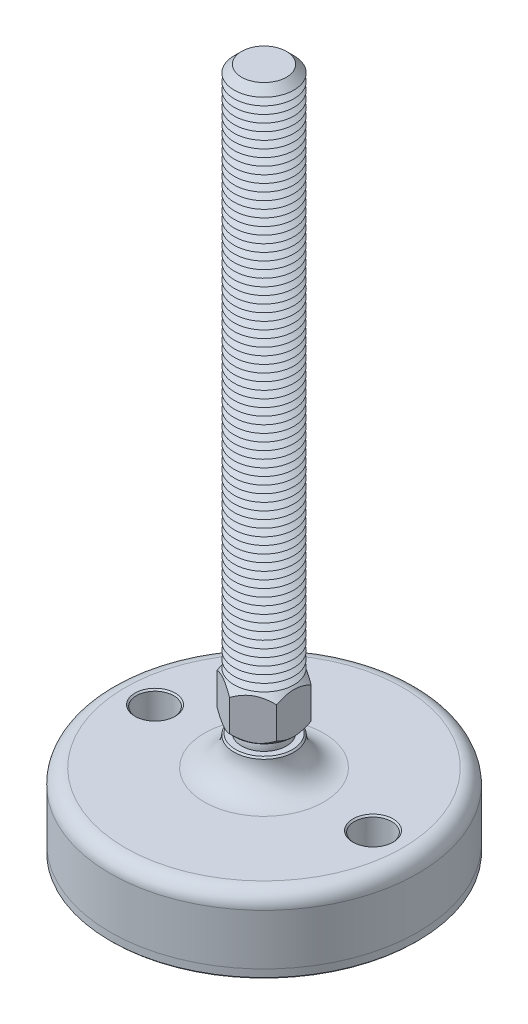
ISO-10303-21;
HEADER;
FILE_DESCRIPTION(('STEP AP214'),'2;1');
FILE_NAME('part.step','',(''),(''),'','','');
FILE_SCHEMA(('AUTOMOTIVE_DESIGN { 1 0 10303 214 1 1 1 1 }'));
ENDSEC;
DATA;
#1=APPLICATION_CONTEXT('core data for automotive mechanical design processes');
#2=APPLICATION_PROTOCOL_DEFINITION('international standard','automotive_design',2000,#1);
#3=PRODUCT_CONTEXT('',#1,'mechanical');
#4=PRODUCT('Part','Part','',(#3));
#5=PRODUCT_RELATED_PRODUCT_CATEGORY('part','',(#4));
#6=PRODUCT_DEFINITION_FORMATION('','',#4);
#7=PRODUCT_DEFINITION_CONTEXT('part definition',#1,'design');
#8=PRODUCT_DEFINITION('design','',#6,#7);
#9=PRODUCT_DEFINITION_SHAPE('','',#8);
#10=(LENGTH_UNIT() NAMED_UNIT(*) SI_UNIT(.MILLI.,.METRE.));
#11=(NAMED_UNIT(*) PLANE_ANGLE_UNIT() SI_UNIT($,.RADIAN.));
#12=(NAMED_UNIT(*) SI_UNIT($,.STERADIAN.) SOLID_ANGLE_UNIT());
#13=UNCERTAINTY_MEASURE_WITH_UNIT(LENGTH_MEASURE(1.E-05),#10,'distance_accuracy_value','');
#14=(GEOMETRIC_REPRESENTATION_CONTEXT(3) GLOBAL_UNCERTAINTY_ASSIGNED_CONTEXT((#13)) GLOBAL_UNIT_ASSIGNED_CONTEXT((#10,
#11,#12)) REPRESENTATION_CONTEXT('',''));
#15=CARTESIAN_POINT('',(0.,0.,0.));
#16=DIRECTION('',(0.,0.,1.));
#17=DIRECTION('',(1.,0.,0.));
#18=AXIS2_PLACEMENT_3D('',#15,#16,#17);
#19=CARTESIAN_POINT('',(0.,-32.,0.));
#20=DIRECTION('',(0.,1.,0.));
#21=DIRECTION('',(0.,0.,1.));
#22=AXIS2_PLACEMENT_3D('',#19,#20,#21);
#23=PLANE('',#22);
#24=CARTESIAN_POINT('',(-36.5,-32.,0.));
#25=DIRECTION('',(0.,1.,0.));
#26=DIRECTION('',(0.,0.,1.));
#27=AXIS2_PLACEMENT_3D('',#24,#25,#26);
#28=CIRCLE('',#27,6.25);
#29=CARTESIAN_POINT('',(-36.5,-32.,6.25));
#30=VERTEX_POINT('',#29);
#31=EDGE_CURVE('P0_E43',#30,#30,#28,.T.);
#32=ORIENTED_EDGE('',*,*,#31,.F.);
#33=EDGE_LOOP('',(#32));
#34=FACE_BOUND('',#33,.T.);
#35=CARTESIAN_POINT('',(36.5,-32.,0.));
#36=DIRECTION('',(0.,1.,0.));
#37=DIRECTION('',(0.,0.,1.));
#38=AXIS2_PLACEMENT_3D('',#35,#36,#37);
#39=CIRCLE('',#38,6.25);
#40=CARTESIAN_POINT('',(36.5,-32.,6.25));
#41=VERTEX_POINT('',#40);
#42=EDGE_CURVE('P0_E44',#41,#41,#39,.T.);
#43=ORIENTED_EDGE('',*,*,#42,.F.);
#44=EDGE_LOOP('',(#43));
#45=FACE_BOUND('',#44,.T.);
#46=CARTESIAN_POINT('',(0.,-32.,0.));
#47=DIRECTION('',(0.,1.,0.));
#48=DIRECTION('',(0.,0.,1.));
#49=AXIS2_PLACEMENT_3D('',#46,#47,#48);
#50=CIRCLE('',#49,51.5);
#51=CARTESIAN_POINT('',(0.,-32.,51.5));
#52=VERTEX_POINT('',#51);
#53=EDGE_CURVE('P0_E40',#52,#52,#50,.T.);
#54=ORIENTED_EDGE('',*,*,#53,.T.);
#55=EDGE_LOOP('',(#54));
#56=FACE_BOUND('',#55,.T.);
#57=ADVANCED_FACE('P0_F14',(#34,#45,#56),#23,.T.);
#58=CARTESIAN_POINT('',(0.,43.1654938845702,0.));
#59=DIRECTION('',(0.,1.,0.));
#60=DIRECTION('',(0.,0.,1.));
#61=AXIS2_PLACEMENT_3D('',#58,#59,#60);
#62=CYLINDRICAL_SURFACE('',#61,51.5);
#63=CARTESIAN_POINT('',(0.,-34.5,0.));
#64=DIRECTION('',(0.,-1.,0.));
#65=DIRECTION('',(0.,0.,-1.));
#66=AXIS2_PLACEMENT_3D('',#63,#64,#65);
#67=CIRCLE('',#66,51.5);
#68=CARTESIAN_POINT('',(0.,-34.5,-51.5));
#69=VERTEX_POINT('',#68);
#70=EDGE_CURVE('P0_E37',#69,#69,#67,.F.);
#71=ORIENTED_EDGE('',*,*,#70,.T.);
#72=EDGE_LOOP('',(#71));
#73=FACE_BOUND('',#72,.T.);
#74=ORIENTED_EDGE('',*,*,#53,.F.);
#75=EDGE_LOOP('',(#74));
#76=FACE_BOUND('',#75,.T.);
#77=ADVANCED_FACE('P0_F54',(#73,#76),#62,.T.);
#78=CARTESIAN_POINT('',(0.,-35.,51.5));
#79=DIRECTION('',(0.,-1.,0.));
#80=DIRECTION('',(0.,0.,-1.));
#81=AXIS2_PLACEMENT_3D('',#78,#79,#80);
#82=PLANE('',#81);
#83=CARTESIAN_POINT('',(36.5,-35.,0.));
#84=DIRECTION('',(0.,-1.,0.));
#85=DIRECTION('',(0.,0.,-1.));
#86=AXIS2_PLACEMENT_3D('',#83,#84,#85);
#87=CIRCLE('',#86,6.75000000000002);
#88=CARTESIAN_POINT('',(36.5,-35.,-6.75000000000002));
#89=VERTEX_POINT('',#88);
#90=EDGE_CURVE('P0_E25',#89,#89,#87,.F.);
#91=ORIENTED_EDGE('',*,*,#90,.T.);
#92=EDGE_LOOP('',(#91));
#93=FACE_BOUND('',#92,.T.);
#94=CARTESIAN_POINT('',(-36.5,-35.,0.));
#95=DIRECTION('',(0.,-1.,0.));
#96=DIRECTION('',(0.,0.,-1.));
#97=AXIS2_PLACEMENT_3D('',#94,#95,#96);
#98=CIRCLE('',#97,6.74999999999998);
#99=CARTESIAN_POINT('',(-36.5,-35.,-6.74999999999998));
#100=VERTEX_POINT('',#99);
#101=EDGE_CURVE('P0_E29',#100,#100,#98,.F.);
#102=ORIENTED_EDGE('',*,*,#101,.T.);
#103=EDGE_LOOP('',(#102));
#104=FACE_BOUND('',#103,.T.);
#105=CARTESIAN_POINT('',(0.,-35.,0.));
#106=DIRECTION('',(0.,-1.,0.));
#107=DIRECTION('',(0.,0.,-1.));
#108=AXIS2_PLACEMENT_3D('',#105,#106,#107);
#109=CIRCLE('',#108,51.);
#110=CARTESIAN_POINT('',(0.,-35.,-51.));
#111=VERTEX_POINT('',#110);
#112=EDGE_CURVE('P0_E34',#111,#111,#109,.T.);
#113=ORIENTED_EDGE('',*,*,#112,.T.);
#114=EDGE_LOOP('',(#113));
#115=FACE_BOUND('',#114,.T.);
#116=ADVANCED_FACE('P0_F61',(#93,#104,#115),#82,.T.);
#117=CARTESIAN_POINT('',(0.,-34.5,0.));
#118=DIRECTION('',(0.,1.,0.));
#119=DIRECTION('',(0.,0.,1.));
#120=AXIS2_PLACEMENT_3D('',#117,#118,#119);
#121=CONICAL_SURFACE('',#120,51.5,0.785398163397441);
#122=ORIENTED_EDGE('',*,*,#112,.F.);
#123=EDGE_LOOP('',(#122));
#124=FACE_BOUND('',#123,.T.);
#125=ORIENTED_EDGE('',*,*,#70,.F.);
#126=EDGE_LOOP('',(#125));
#127=FACE_BOUND('',#126,.T.);
#128=ADVANCED_FACE('P0_F68',(#124,#127),#121,.T.);
#129=CARTESIAN_POINT('',(36.5,-35.,0.));
#130=DIRECTION('',(0.,1.,0.));
#131=DIRECTION('',(0.,0.,1.));
#132=AXIS2_PLACEMENT_3D('',#129,#130,#131);
#133=CYLINDRICAL_SURFACE('',#132,6.25);
#134=CARTESIAN_POINT('',(36.5,-34.5,0.));
#135=DIRECTION('',(0.,-1.,0.));
#136=DIRECTION('',(0.,0.,-1.));
#137=AXIS2_PLACEMENT_3D('',#134,#135,#136);
#138=CIRCLE('',#137,6.25);
#139=CARTESIAN_POINT('',(36.5,-34.5,-6.25));
#140=VERTEX_POINT('',#139);
#141=EDGE_CURVE('P0_E21',#140,#140,#138,.T.);
#142=ORIENTED_EDGE('',*,*,#141,.T.);
#143=EDGE_LOOP('',(#142));
#144=FACE_BOUND('',#143,.T.);
#145=ORIENTED_EDGE('',*,*,#42,.T.);
#146=EDGE_LOOP('',(#145));
#147=FACE_BOUND('',#146,.T.);
#148=ADVANCED_FACE('P0_F74',(#144,#147),#133,.F.);
#149=CARTESIAN_POINT('',(-36.5,-35.,0.));
#150=DIRECTION('',(0.,1.,0.));
#151=DIRECTION('',(0.,0.,1.));
#152=AXIS2_PLACEMENT_3D('',#149,#150,#151);
#153=CYLINDRICAL_SURFACE('',#152,6.25);
#154=CARTESIAN_POINT('',(-36.5,-34.5,0.));
#155=DIRECTION('',(0.,-1.,0.));
#156=DIRECTION('',(0.,0.,-1.));
#157=AXIS2_PLACEMENT_3D('',#154,#155,#156);
#158=CIRCLE('',#157,6.25);
#159=CARTESIAN_POINT('',(-36.5,-34.5,-6.25));
#160=VERTEX_POINT('',#159);
#161=EDGE_CURVE('P0_E10',#160,#160,#158,.T.);
#162=ORIENTED_EDGE('',*,*,#161,.T.);
#163=EDGE_LOOP('',(#162));
#164=FACE_BOUND('',#163,.T.);
#165=ORIENTED_EDGE('',*,*,#31,.T.);
#166=EDGE_LOOP('',(#165));
#167=FACE_BOUND('',#166,.T.);
#168=ADVANCED_FACE('P0_F50',(#164,#167),#153,.F.);
#169=CARTESIAN_POINT('',(36.5,-35.,0.));
#170=DIRECTION('',(0.,-1.,0.));
#171=DIRECTION('',(0.,0.,-1.));
#172=AXIS2_PLACEMENT_3D('',#169,#170,#171);
#173=CONICAL_SURFACE('',#172,6.75000000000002,0.785398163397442);
#174=ORIENTED_EDGE('',*,*,#141,.F.);
#175=EDGE_LOOP('',(#174));
#176=FACE_BOUND('',#175,.T.);
#177=ORIENTED_EDGE('',*,*,#90,.F.);
#178=EDGE_LOOP('',(#177));
#179=FACE_BOUND('',#178,.T.);
#180=ADVANCED_FACE('P0_F76',(#176,#179),#173,.F.);
#181=CARTESIAN_POINT('',(-36.5,-35.,0.));
#182=DIRECTION('',(0.,-1.,0.));
#183=DIRECTION('',(0.,0.,-1.));
#184=AXIS2_PLACEMENT_3D('',#181,#182,#183);
#185=CONICAL_SURFACE('',#184,6.74999999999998,0.785398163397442);
#186=ORIENTED_EDGE('',*,*,#161,.F.);
#187=EDGE_LOOP('',(#186));
#188=FACE_BOUND('',#187,.T.);
#189=ORIENTED_EDGE('',*,*,#101,.F.);
#190=EDGE_LOOP('',(#189));
#191=FACE_BOUND('',#190,.T.);
#192=ADVANCED_FACE('P0_F16',(#188,#191),#185,.F.);
#193=CLOSED_SHELL('',(#57,#77,#116,#128,#148,#168,#180,#192));
#194=MANIFOLD_SOLID_BREP('P0_B1',#193);
#195=CARTESIAN_POINT('',(0.,3.75,0.));
#196=DIRECTION('',(0.,1.,0.));
#197=DIRECTION('',(0.,0.,1.));
#198=AXIS2_PLACEMENT_3D('',#195,#196,#197);
#199=PLANE('',#198);
#200=CARTESIAN_POINT('',(0.,3.75,0.));
#201=DIRECTION('',(0.,1.,0.));
#202=DIRECTION('',(0.,0.,1.));
#203=AXIS2_PLACEMENT_3D('',#200,#201,#202);
#204=CIRCLE('',#203,9.72829454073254);
#205=CARTESIAN_POINT('',(0.,3.75,9.72829454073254));
#206=VERTEX_POINT('',#205);
#207=EDGE_CURVE('P1_E211',#206,#206,#204,.T.);
#208=ORIENTED_EDGE('',*,*,#207,.F.);
#209=EDGE_LOOP('',(#208));
#210=FACE_BOUND('',#209,.T.);
#211=CARTESIAN_POINT('',(0.,3.75,0.));
#212=DIRECTION('',(0.,1.,0.));
#213=DIRECTION('',(0.,0.,1.));
#214=AXIS2_PLACEMENT_3D('',#211,#212,#213);
#215=CIRCLE('',#214,6.49519052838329);
#216=CARTESIAN_POINT('',(0.,3.75,6.49519052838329));
#217=VERTEX_POINT('',#216);
#218=EDGE_CURVE('P1_E24',#217,#217,#215,.F.);
#219=ORIENTED_EDGE('',*,*,#218,.F.);
#220=EDGE_LOOP('',(#219));
#221=FACE_BOUND('',#220,.T.);
#222=ADVANCED_FACE('P1_F16',(#210,#221),#199,.F.);
#223=CARTESIAN_POINT('',(0.,0.,0.));
#224=DIRECTION('',(0.,1.,0.));
#225=DIRECTION('',(0.,0.,-1.));
#226=AXIS2_PLACEMENT_3D('',#223,#224,#225);
#227=SPHERICAL_SURFACE('',#226,7.5);
#228=ORIENTED_EDGE('',*,*,#218,.T.);
#229=EDGE_LOOP('',(#228));
#230=FACE_BOUND('',#229,.T.);
#231=ADVANCED_FACE('P1_F201',(#230),#227,.T.);
#232=CARTESIAN_POINT('',(0.,3.75,0.));
#233=DIRECTION('',(0.,1.,0.));
#234=DIRECTION('',(0.,0.,1.));
#235=AXIS2_PLACEMENT_3D('',#232,#233,#234);
#236=CONICAL_SURFACE('',#235,9.72829454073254,0.785398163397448);
#237=ORIENTED_EDGE('',*,*,#207,.T.);
#238=EDGE_LOOP('',(#237));
#239=FACE_BOUND('',#238,.T.);
#240=CARTESIAN_POINT('',(-10.,9.59571642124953,-11.9394228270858));
#241=CARTESIAN_POINT('',(-10.,9.37430561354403,-11.6505452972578));
#242=CARTESIAN_POINT('',(-10.,9.15490936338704,-11.3600988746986));
#243=CARTESIAN_POINT('',(-10.,8.72106267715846,-10.7754314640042));
#244=CARTESIAN_POINT('',(-10.,8.50661343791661,-10.4812095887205));
#245=CARTESIAN_POINT('',(-10.,8.08205114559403,-9.88620330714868));
#246=CARTESIAN_POINT('',(-10.,7.87198437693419,-9.58538576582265));
#247=CARTESIAN_POINT('',(-10.,7.45926520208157,-8.97872312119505));
#248=CARTESIAN_POINT('',(-10.,7.25661228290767,-8.67287836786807));
#249=CARTESIAN_POINT('',(-10.,6.84809543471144,-8.03614350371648));
#250=CARTESIAN_POINT('',(-10.,6.64281401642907,-7.70487777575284));
#251=CARTESIAN_POINT('',(-10.,6.245142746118,-7.03457466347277));
#252=CARTESIAN_POINT('',(-10.,6.0527550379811,-6.69553599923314));
#253=CARTESIAN_POINT('',(-10.,5.68497951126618,-6.00961937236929));
#254=CARTESIAN_POINT('',(-10.,5.50954176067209,-5.66276839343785));
#255=CARTESIAN_POINT('',(-10.,5.17959635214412,-4.95932933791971));
#256=CARTESIAN_POINT('',(-10.,5.02507889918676,-4.60274591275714));
#257=CARTESIAN_POINT('',(-10.,4.75599518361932,-3.91353381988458));
#258=CARTESIAN_POINT('',(-10.,4.63902686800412,-3.58185263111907));
#259=CARTESIAN_POINT('',(-10.,4.43164927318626,-2.91013341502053));
#260=CARTESIAN_POINT('',(-10.,4.34124171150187,-2.57009484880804));
#261=CARTESIAN_POINT('',(-10.,4.19334931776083,-1.88955843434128));
#262=CARTESIAN_POINT('',(-10.,4.13527351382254,-1.54919119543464));
#263=CARTESIAN_POINT('',(-10.,4.05324021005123,-0.864347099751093));
#264=CARTESIAN_POINT('',(-10.,4.029275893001,-0.519871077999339));
#265=CARTESIAN_POINT('',(-10.,4.01745435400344,0.155191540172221));
#266=CARTESIAN_POINT('',(-10.,4.02812008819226,0.485752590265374));
#267=CARTESIAN_POINT('',(-10.,4.08160326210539,1.1442457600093));
#268=CARTESIAN_POINT('',(-10.,4.12442366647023,1.47217763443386));
#269=CARTESIAN_POINT('',(-10.,4.24054019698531,2.12859326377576));
#270=CARTESIAN_POINT('',(-10.,4.31437036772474,2.45698095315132));
#271=CARTESIAN_POINT('',(-10.,4.48844287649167,3.10654175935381));
#272=CARTESIAN_POINT('',(-10.,4.58868356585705,3.42771532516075));
#273=CARTESIAN_POINT('',(-10.,4.81839210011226,4.08271396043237));
#274=CARTESIAN_POINT('',(-10.,4.94932842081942,4.41601827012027));
#275=CARTESIAN_POINT('',(-10.,5.23140828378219,5.07403931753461));
#276=CARTESIAN_POINT('',(-10.,5.38256099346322,5.3987520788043));
#277=CARTESIAN_POINT('',(-10.,5.70148727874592,6.04113299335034));
#278=CARTESIAN_POINT('',(-10.,5.86931223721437,6.35877542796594));
#279=CARTESIAN_POINT('',(-10.,6.21788686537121,6.98677627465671));
#280=CARTESIAN_POINT('',(-10.,6.39863453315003,7.29713580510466));
#281=CARTESIAN_POINT('',(-10.,6.76133545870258,7.89633938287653));
#282=CARTESIAN_POINT('',(-10.,6.94278731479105,8.18548854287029));
#283=CARTESIAN_POINT('',(-10.,7.31339871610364,8.75881961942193));
#284=CARTESIAN_POINT('',(-10.,7.50255884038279,9.04300116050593));
#285=CARTESIAN_POINT('',(-10.,7.8856676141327,9.6047584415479));
#286=CARTESIAN_POINT('',(-10.,8.07956548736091,9.88236893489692));
#287=CARTESIAN_POINT('',(-10.,8.47254700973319,10.4337838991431));
#288=CARTESIAN_POINT('',(-10.,8.67162921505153,10.7075893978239));
#289=CARTESIAN_POINT('',(-10.,8.87283307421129,10.9797992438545));
#290=B_SPLINE_CURVE_WITH_KNOTS('',3,(#240,#241,#242,#243,#244,#245,#246,#247,#248,#249,#250,
#251,#252,#253,#254,#255,#256,#257,#258,#259,#260,#261,#262,#263,#264,#265,#266,#267,#268,#269,
#270,#271,#272,#273,#274,#275,#276,#277,#278,#279,#280,#281,#282,#283,#284,#285,#286,#287,#288,
#289),.UNSPECIFIED.,.F.,.F.,(4,2,2,2,2,2,2,2,2,2,2,2,2,2,2,2,2,2,2,2,2,2,2,2,4),(0.,
1.09192545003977,2.18411235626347,3.28473497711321,4.3852812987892,5.5541916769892,
6.72329593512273,7.88884387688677,9.05384420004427,10.1080362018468,11.1622963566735,
12.1965943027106,13.2306855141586,14.2212593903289,15.2119246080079,16.2203997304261,
17.2288119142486,18.3022883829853,19.3762532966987,20.4536373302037,21.5308548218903,
22.5548150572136,23.5788523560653,24.5946500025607,25.6101677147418),.UNSPECIFIED.);
#291=CARTESIAN_POINT('',(-10.,5.56871084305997,-5.77350269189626));
#292=VERTEX_POINT('',#291);
#293=CARTESIAN_POINT('',(-10.,5.56871084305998,5.77350269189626));
#294=VERTEX_POINT('',#293);
#295=EDGE_CURVE('P1_E185',#292,#294,#290,.T.);
#296=ORIENTED_EDGE('',*,*,#295,.F.);
#297=CARTESIAN_POINT('',(0.000199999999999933,5.56882631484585,-11.5471208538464));
#298=CARTESIAN_POINT('',(-0.171722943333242,5.4695807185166,-11.447861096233));
#299=CARTESIAN_POINT('',(-0.344992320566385,5.37336355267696,-11.3478239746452));
#300=CARTESIAN_POINT('',(-0.694433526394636,5.18794806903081,-11.1460740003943));
#301=CARTESIAN_POINT('',(-0.870606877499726,5.09875358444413,-11.0443602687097));
#302=CARTESIAN_POINT('',(-1.22689656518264,4.92796770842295,-10.8386563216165));
#303=CARTESIAN_POINT('',(-1.40702970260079,4.84642277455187,-10.7346564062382));
#304=CARTESIAN_POINT('',(-1.77025459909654,4.69270708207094,-10.52494841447));
#305=CARTESIAN_POINT('',(-1.95334590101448,4.62053489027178,-10.4192406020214));
#306=CARTESIAN_POINT('',(-2.31954331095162,4.4878482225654,-10.2078164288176));
#307=CARTESIAN_POINT('',(-2.50260441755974,4.42716910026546,-10.1021260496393));
#308=CARTESIAN_POINT('',(-2.87129282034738,4.31731511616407,-9.88926370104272));
#309=CARTESIAN_POINT('',(-3.05691983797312,4.26813901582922,-9.78209189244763));
#310=CARTESIAN_POINT('',(-3.42994608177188,4.1825291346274,-9.56672509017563));
#311=CARTESIAN_POINT('',(-3.61734032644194,4.14606667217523,-9.45853297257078));
#312=CARTESIAN_POINT('',(-3.99370204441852,4.08668528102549,-9.24124043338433));
#313=CARTESIAN_POINT('',(-4.1826692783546,4.06376432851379,-9.13214015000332));
#314=CARTESIAN_POINT('',(-4.64316633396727,4.0253323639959,-8.86627205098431));
#315=CARTESIAN_POINT('',(-4.91519388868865,4.01726744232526,-8.70921686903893));
#316=CARTESIAN_POINT('',(-5.45875701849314,4.03080424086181,-8.39539054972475));
#317=CARTESIAN_POINT('',(-5.7302923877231,4.05241636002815,-8.23861953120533));
#318=CARTESIAN_POINT('',(-6.27080349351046,4.12403157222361,-7.92655529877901));
#319=CARTESIAN_POINT('',(-6.53977602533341,4.17406641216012,-7.77126393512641));
#320=CARTESIAN_POINT('',(-7.07309796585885,4.29980733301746,-7.46335036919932));
#321=CARTESIAN_POINT('',(-7.33744772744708,4.3755114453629,-7.31072796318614));
#322=CARTESIAN_POINT('',(-7.80670351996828,4.53125365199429,-7.03980300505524));
#323=CARTESIAN_POINT('',(-8.01264886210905,4.60719488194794,-6.92090040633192));
#324=CARTESIAN_POINT('',(-8.42084280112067,4.77131434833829,-6.68522952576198));
#325=CARTESIAN_POINT('',(-8.62309128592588,4.85949295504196,-6.5684613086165));
#326=CARTESIAN_POINT('',(-9.02325448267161,5.04611070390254,-6.33742697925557));
#327=CARTESIAN_POINT('',(-9.22118057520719,5.1445175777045,-6.2231542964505));
#328=CARTESIAN_POINT('',(-9.61336795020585,5.35030005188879,-5.99672480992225));
#329=CARTESIAN_POINT('',(-9.80763139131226,5.45767015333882,-5.88456675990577));
#330=CARTESIAN_POINT('',(-10.0002,5.56882631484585,-5.77338722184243));
#331=B_SPLINE_CURVE_WITH_KNOTS('',3,(#297,#298,#299,#300,#301,#302,#303,#304,#305,#306,#307,
#308,#309,#310,#311,#312,#313,#314,#315,#316,#317,#318,#319,#320,#321,#322,#323,#324,#325,#326,
#327,#328,#329,#330),.UNSPECIFIED.,.F.,.F.,(4,2,2,2,2,2,2,2,2,2,2,2,2,2,2,2,4),(0.,
0.665863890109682,1.33208874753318,2.00212824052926,2.67206515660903,3.33152613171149,
3.99091606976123,4.64880867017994,5.30660292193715,6.24777541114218,7.18927777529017,
8.13183382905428,9.07431761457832,9.82287578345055,10.5714566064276,11.3177436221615,
12.0635761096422),.UNSPECIFIED.);
#332=CARTESIAN_POINT('',(0.,5.56871084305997,-11.5470053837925));
#333=VERTEX_POINT('',#332);
#334=EDGE_CURVE('P1_E179',#333,#292,#331,.T.);
#335=ORIENTED_EDGE('',*,*,#334,.F.);
#336=CARTESIAN_POINT('',(10.0002,5.56882631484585,-5.77338722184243));
#337=CARTESIAN_POINT('',(9.82827705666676,5.4695807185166,-5.87264697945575));
#338=CARTESIAN_POINT('',(9.65500767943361,5.37336355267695,-5.97268410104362));
#339=CARTESIAN_POINT('',(9.30556647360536,5.18794806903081,-6.17443407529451));
#340=CARTESIAN_POINT('',(9.12939312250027,5.09875358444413,-6.27614780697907));
#341=CARTESIAN_POINT('',(8.77310343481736,4.92796770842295,-6.48185175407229));
#342=CARTESIAN_POINT('',(8.59297029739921,4.84642277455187,-6.58585166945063));
#343=CARTESIAN_POINT('',(8.22974540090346,4.69270708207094,-6.79555966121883));
#344=CARTESIAN_POINT('',(8.04665409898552,4.62053489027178,-6.90126747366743));
#345=CARTESIAN_POINT('',(7.68045668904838,4.4878482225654,-7.11269164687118));
#346=CARTESIAN_POINT('',(7.49739558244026,4.42716910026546,-7.21838202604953));
#347=CARTESIAN_POINT('',(7.12870717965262,4.31731511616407,-7.43124437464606));
#348=CARTESIAN_POINT('',(6.94308016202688,4.26813901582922,-7.53841618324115));
#349=CARTESIAN_POINT('',(6.57005391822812,4.1825291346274,-7.75378298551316));
#350=CARTESIAN_POINT('',(6.38265967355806,4.14606667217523,-7.861975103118));
#351=CARTESIAN_POINT('',(6.00629795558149,4.08668528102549,-8.07926764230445));
#352=CARTESIAN_POINT('',(5.81733072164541,4.06376432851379,-8.18836792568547));
#353=CARTESIAN_POINT('',(5.35683366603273,4.0253323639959,-8.45423602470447));
#354=CARTESIAN_POINT('',(5.08480611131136,4.01726744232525,-8.61129120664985));
#355=CARTESIAN_POINT('',(4.54124298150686,4.03080424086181,-8.92511752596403));
#356=CARTESIAN_POINT('',(4.2697076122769,4.05241636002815,-9.08188854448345));
#357=CARTESIAN_POINT('',(3.72919650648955,4.12403157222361,-9.39395277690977));
#358=CARTESIAN_POINT('',(3.46022397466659,4.17406641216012,-9.54924414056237));
#359=CARTESIAN_POINT('',(2.92690203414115,4.29980733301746,-9.85715770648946));
#360=CARTESIAN_POINT('',(2.66255227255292,4.37551144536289,-10.0097801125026));
#361=CARTESIAN_POINT('',(2.19329648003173,4.53125365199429,-10.2807050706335));
#362=CARTESIAN_POINT('',(1.98735113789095,4.60719488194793,-10.3996076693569));
#363=CARTESIAN_POINT('',(1.57915719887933,4.77131434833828,-10.6352785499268));
#364=CARTESIAN_POINT('',(1.37690871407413,4.85949295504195,-10.7520467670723));
#365=CARTESIAN_POINT('',(0.976745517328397,5.04611070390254,-10.9830810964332));
#366=CARTESIAN_POINT('',(0.77881942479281,5.1445175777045,-11.0973537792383));
#367=CARTESIAN_POINT('',(0.386632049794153,5.35030005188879,-11.3237832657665));
#368=CARTESIAN_POINT('',(0.192368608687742,5.45767015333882,-11.435941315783));
#369=CARTESIAN_POINT('',(-0.000199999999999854,5.56882631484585,-11.5471208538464));
#370=B_SPLINE_CURVE_WITH_KNOTS('',3,(#336,#337,#338,#339,#340,#341,#342,#343,#344,#345,#346,
#347,#348,#349,#350,#351,#352,#353,#354,#355,#356,#357,#358,#359,#360,#361,#362,#363,#364,#365,
#366,#367,#368,#369),.UNSPECIFIED.,.F.,.F.,(4,2,2,2,2,2,2,2,2,2,2,2,2,2,2,2,4),(0.,
0.665863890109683,1.33208874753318,2.00212824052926,2.67206515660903,3.33152613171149,
3.99091606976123,4.64880867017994,5.30660292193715,6.24777541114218,7.18927777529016,
8.13183382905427,9.07431761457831,9.82287578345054,10.5714566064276,11.3177436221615,
12.0635761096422),.UNSPECIFIED.);
#371=CARTESIAN_POINT('',(9.99999999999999,5.56871084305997,-5.77350269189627));
#372=VERTEX_POINT('',#371);
#373=EDGE_CURVE('P1_E167',#372,#333,#370,.T.);
#374=ORIENTED_EDGE('',*,*,#373,.F.);
#375=CARTESIAN_POINT('',(10.,9.59571642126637,-11.9394228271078));
#376=CARTESIAN_POINT('',(10.,9.37430561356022,-11.6505452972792));
#377=CARTESIAN_POINT('',(10.,9.15490936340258,-11.3600988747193));
#378=CARTESIAN_POINT('',(10.,8.7210626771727,-10.7754314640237));
#379=CARTESIAN_POINT('',(10.,8.5066134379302,-10.4812095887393));
#380=CARTESIAN_POINT('',(10.,8.08205114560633,-9.88620330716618));
#381=CARTESIAN_POINT('',(10.,7.87198437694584,-9.58538576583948));
#382=CARTESIAN_POINT('',(10.,7.45926520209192,-8.97872312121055));
#383=CARTESIAN_POINT('',(10.,7.25661228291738,-8.67287836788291));
#384=CARTESIAN_POINT('',(10.,6.84809543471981,-8.03614350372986));
#385=CARTESIAN_POINT('',(10.,6.64281401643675,-7.70487777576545));
#386=CARTESIAN_POINT('',(10.,6.24514274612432,-7.03457466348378));
#387=CARTESIAN_POINT('',(10.,6.05275503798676,-6.69553599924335));
#388=CARTESIAN_POINT('',(10.,5.68497951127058,-6.00961937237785));
#389=CARTESIAN_POINT('',(10.,5.50954176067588,-5.66276839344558));
#390=CARTESIAN_POINT('',(10.,5.17959635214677,-4.95932933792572));
#391=CARTESIAN_POINT('',(10.,5.02507889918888,-4.60274591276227));
#392=CARTESIAN_POINT('',(10.,4.75599518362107,-3.91353381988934));
#393=CARTESIAN_POINT('',(10.,4.63902686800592,-3.58185263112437));
#394=CARTESIAN_POINT('',(10.,4.43164927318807,-2.91013341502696));
#395=CARTESIAN_POINT('',(10.,4.34124171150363,-2.57009484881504));
#396=CARTESIAN_POINT('',(10.,4.19334931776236,-1.8895584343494));
#397=CARTESIAN_POINT('',(10.,4.13527351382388,-1.54919119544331));
#398=CARTESIAN_POINT('',(10.,4.05324021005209,-0.86434709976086));
#399=CARTESIAN_POINT('',(10.,4.02927589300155,-0.519871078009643));
#400=CARTESIAN_POINT('',(10.,4.01745435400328,0.155191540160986));
#401=CARTESIAN_POINT('',(10.,4.0281200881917,0.485752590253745));
#402=CARTESIAN_POINT('',(10.,4.08160326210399,1.14424575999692));
#403=CARTESIAN_POINT('',(10.,4.12442366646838,1.47217763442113));
#404=CARTESIAN_POINT('',(10.,4.24054019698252,2.12859326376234));
#405=CARTESIAN_POINT('',(10.,4.31437036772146,2.45698095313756));
#406=CARTESIAN_POINT('',(10.,4.48844287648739,3.1065417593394));
#407=CARTESIAN_POINT('',(10.,4.58868356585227,3.42771532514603));
#408=CARTESIAN_POINT('',(10.,4.81839210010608,4.08271396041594));
#409=CARTESIAN_POINT('',(10.,4.94932842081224,4.41601827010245));
#410=CARTESIAN_POINT('',(10.,5.23140828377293,5.0740393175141));
#411=CARTESIAN_POINT('',(10.,5.38256099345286,5.39875207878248));
#412=CARTESIAN_POINT('',(10.,5.70148727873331,6.04113299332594));
#413=CARTESIAN_POINT('',(10.,5.86931223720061,6.35877542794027));
#414=CARTESIAN_POINT('',(10.,6.21788686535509,6.98677627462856));
#415=CARTESIAN_POINT('',(10.,6.39863453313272,7.29713580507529));
#416=CARTESIAN_POINT('',(10.,6.761335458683,7.89633938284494));
#417=CARTESIAN_POINT('',(10.,6.9427873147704,8.18548854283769));
#418=CARTESIAN_POINT('',(10.,7.31339871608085,8.75881961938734));
#419=CARTESIAN_POINT('',(10.,7.50255884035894,9.04300116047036));
#420=CARTESIAN_POINT('',(10.,7.88566761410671,9.60475844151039));
#421=CARTESIAN_POINT('',(10.,8.07956548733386,9.88236893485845));
#422=CARTESIAN_POINT('',(10.,8.47254700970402,10.4337838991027));
#423=CARTESIAN_POINT('',(10.,8.6716292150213,10.7075893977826));
#424=CARTESIAN_POINT('',(10.,8.87283307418,10.9797992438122));
#425=B_SPLINE_CURVE_WITH_KNOTS('',3,(#375,#376,#377,#378,#379,#380,#381,#382,#383,#384,#385,
#386,#387,#388,#389,#390,#391,#392,#393,#394,#395,#396,#397,#398,#399,#400,#401,#402,#403,#404,
#405,#406,#407,#408,#409,#410,#411,#412,#413,#414,#415,#416,#417,#418,#419,#420,#421,#422,#423,
#424),.UNSPECIFIED.,.F.,.F.,(4,2,2,2,2,2,2,2,2,2,2,2,2,2,2,2,2,2,2,2,2,2,2,2,4),(0.,
1.09192545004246,2.18411235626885,3.28473497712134,4.38528129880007,5.55419167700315,
6.72329593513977,7.88884387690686,9.05384420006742,10.1080362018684,11.1622963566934,
12.196594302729,13.2306855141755,14.2212593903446,15.2119246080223,16.2203997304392,
17.2288119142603,18.3022883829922,19.3762532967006,20.4536373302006,21.5308548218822,
22.5548150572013,23.5788523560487,24.5946500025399,25.6101677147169),.UNSPECIFIED.);
#426=CARTESIAN_POINT('',(10.,5.56871084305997,5.77350269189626));
#427=VERTEX_POINT('',#426);
#428=EDGE_CURVE('P1_E70',#427,#372,#425,.F.);
#429=ORIENTED_EDGE('',*,*,#428,.F.);
#430=CARTESIAN_POINT('',(-0.000200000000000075,5.56882631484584,11.5471208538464));
#431=CARTESIAN_POINT('',(0.171722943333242,5.4695807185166,11.447861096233));
#432=CARTESIAN_POINT('',(0.344992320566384,5.37336355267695,11.3478239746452));
#433=CARTESIAN_POINT('',(0.694433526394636,5.18794806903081,11.1460740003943));
#434=CARTESIAN_POINT('',(0.870606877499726,5.09875358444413,11.0443602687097));
#435=CARTESIAN_POINT('',(1.22689656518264,4.92796770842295,10.8386563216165));
#436=CARTESIAN_POINT('',(1.40702970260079,4.84642277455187,10.7346564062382));
#437=CARTESIAN_POINT('',(1.77025459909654,4.69270708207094,10.52494841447));
#438=CARTESIAN_POINT('',(1.95334590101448,4.62053489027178,10.4192406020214));
#439=CARTESIAN_POINT('',(2.31954331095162,4.4878482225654,10.2078164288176));
#440=CARTESIAN_POINT('',(2.50260441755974,4.42716910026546,10.1021260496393));
#441=CARTESIAN_POINT('',(2.87129282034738,4.31731511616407,9.88926370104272));
#442=CARTESIAN_POINT('',(3.05691983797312,4.26813901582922,9.78209189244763));
#443=CARTESIAN_POINT('',(3.42994608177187,4.18252913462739,9.56672509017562));
#444=CARTESIAN_POINT('',(3.61734032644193,4.14606667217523,9.45853297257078));
#445=CARTESIAN_POINT('',(3.99370204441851,4.08668528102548,9.24124043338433));
#446=CARTESIAN_POINT('',(4.18266927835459,4.06376432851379,9.13214015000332));
#447=CARTESIAN_POINT('',(4.64316633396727,4.0253323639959,8.86627205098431));
#448=CARTESIAN_POINT('',(4.91519388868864,4.01726744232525,8.70921686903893));
#449=CARTESIAN_POINT('',(5.45875701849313,4.03080424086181,8.39539054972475));
#450=CARTESIAN_POINT('',(5.7302923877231,4.05241636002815,8.23861953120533));
#451=CARTESIAN_POINT('',(6.27080349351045,4.1240315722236,7.92655529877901));
#452=CARTESIAN_POINT('',(6.53977602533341,4.17406641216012,7.77126393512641));
#453=CARTESIAN_POINT('',(7.07309796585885,4.29980733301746,7.46335036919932));
#454=CARTESIAN_POINT('',(7.33744772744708,4.37551144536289,7.31072796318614));
#455=CARTESIAN_POINT('',(7.80670351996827,4.53125365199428,7.03980300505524));
#456=CARTESIAN_POINT('',(8.01264886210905,4.60719488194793,6.92090040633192));
#457=CARTESIAN_POINT('',(8.42084280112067,4.77131434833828,6.68522952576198));
#458=CARTESIAN_POINT('',(8.62309128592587,4.85949295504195,6.5684613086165));
#459=CARTESIAN_POINT('',(9.0232544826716,5.04611070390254,6.33742697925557));
#460=CARTESIAN_POINT('',(9.22118057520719,5.1445175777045,6.2231542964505));
#461=CARTESIAN_POINT('',(9.61336795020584,5.35030005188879,5.99672480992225));
#462=CARTESIAN_POINT('',(9.80763139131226,5.45767015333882,5.88456675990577));
#463=CARTESIAN_POINT('',(10.0002,5.56882631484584,5.77338722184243));
#464=B_SPLINE_CURVE_WITH_KNOTS('',3,(#430,#431,#432,#433,#434,#435,#436,#437,#438,#439,#440,
#441,#442,#443,#444,#445,#446,#447,#448,#449,#450,#451,#452,#453,#454,#455,#456,#457,#458,#459,
#460,#461,#462,#463),.UNSPECIFIED.,.F.,.F.,(4,2,2,2,2,2,2,2,2,2,2,2,2,2,2,2,4),(0.,
0.665863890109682,1.33208874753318,2.00212824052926,2.67206515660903,3.33152613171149,
3.99091606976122,4.64880867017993,5.30660292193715,6.24777541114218,7.18927777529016,
8.13183382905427,9.07431761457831,9.82287578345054,10.5714566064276,11.3177436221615,
12.0635761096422),.UNSPECIFIED.);
#465=CARTESIAN_POINT('',(0.,5.56871084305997,11.5470053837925));
#466=VERTEX_POINT('',#465);
#467=EDGE_CURVE('P1_E67',#466,#427,#464,.T.);
#468=ORIENTED_EDGE('',*,*,#467,.F.);
#469=CARTESIAN_POINT('',(-10.0002,5.56882631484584,5.77338722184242));
#470=CARTESIAN_POINT('',(-9.82827705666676,5.4695807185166,5.87264697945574));
#471=CARTESIAN_POINT('',(-9.65500767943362,5.37336355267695,5.97268410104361));
#472=CARTESIAN_POINT('',(-9.30556647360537,5.18794806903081,6.1744340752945));
#473=CARTESIAN_POINT('',(-9.12939312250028,5.09875358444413,6.27614780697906));
#474=CARTESIAN_POINT('',(-8.77310343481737,4.92796770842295,6.48185175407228));
#475=CARTESIAN_POINT('',(-8.59297029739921,4.84642277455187,6.58585166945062));
#476=CARTESIAN_POINT('',(-8.22974540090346,4.69270708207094,6.79555966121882));
#477=CARTESIAN_POINT('',(-8.04665409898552,4.62053489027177,6.90126747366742));
#478=CARTESIAN_POINT('',(-7.68045668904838,4.48784822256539,7.11269164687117));
#479=CARTESIAN_POINT('',(-7.49739558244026,4.42716910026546,7.21838202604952));
#480=CARTESIAN_POINT('',(-7.12870717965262,4.31731511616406,7.43124437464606));
#481=CARTESIAN_POINT('',(-6.94308016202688,4.26813901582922,7.53841618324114));
#482=CARTESIAN_POINT('',(-6.57005391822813,4.18252913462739,7.75378298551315));
#483=CARTESIAN_POINT('',(-6.38265967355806,4.14606667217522,7.861975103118));
#484=CARTESIAN_POINT('',(-6.00629795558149,4.08668528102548,8.07926764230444));
#485=CARTESIAN_POINT('',(-5.81733072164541,4.06376432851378,8.18836792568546));
#486=CARTESIAN_POINT('',(-5.35683366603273,4.0253323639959,8.45423602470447));
#487=CARTESIAN_POINT('',(-5.08480611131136,4.01726744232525,8.61129120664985));
#488=CARTESIAN_POINT('',(-4.54124298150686,4.0308042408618,8.92511752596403));
#489=CARTESIAN_POINT('',(-4.2697076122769,4.05241636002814,9.08188854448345));
#490=CARTESIAN_POINT('',(-3.72919650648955,4.1240315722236,9.39395277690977));
#491=CARTESIAN_POINT('',(-3.46022397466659,4.17406641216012,9.54924414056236));
#492=CARTESIAN_POINT('',(-2.92690203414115,4.29980733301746,9.85715770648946));
#493=CARTESIAN_POINT('',(-2.66255227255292,4.37551144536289,10.0097801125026));
#494=CARTESIAN_POINT('',(-2.19329648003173,4.53125365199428,10.2807050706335));
#495=CARTESIAN_POINT('',(-1.98735113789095,4.60719488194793,10.3996076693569));
#496=CARTESIAN_POINT('',(-1.57915719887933,4.77131434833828,10.6352785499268));
#497=CARTESIAN_POINT('',(-1.37690871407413,4.85949295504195,10.7520467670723));
#498=CARTESIAN_POINT('',(-0.976745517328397,5.04611070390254,10.9830810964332));
#499=CARTESIAN_POINT('',(-0.778819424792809,5.1445175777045,11.0973537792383));
#500=CARTESIAN_POINT('',(-0.386632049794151,5.35030005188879,11.3237832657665));
#501=CARTESIAN_POINT('',(-0.192368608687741,5.45767015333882,11.435941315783));
#502=CARTESIAN_POINT('',(0.000199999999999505,5.56882631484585,11.5471208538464));
#503=B_SPLINE_CURVE_WITH_KNOTS('',3,(#469,#470,#471,#472,#473,#474,#475,#476,#477,#478,#479,
#480,#481,#482,#483,#484,#485,#486,#487,#488,#489,#490,#491,#492,#493,#494,#495,#496,#497,#498,
#499,#500,#501,#502),.UNSPECIFIED.,.F.,.F.,(4,2,2,2,2,2,2,2,2,2,2,2,2,2,2,2,4),(0.,
0.665863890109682,1.33208874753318,2.00212824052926,2.67206515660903,3.33152613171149,
3.99091606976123,4.64880867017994,5.30660292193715,6.24777541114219,7.18927777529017,
8.13183382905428,9.07431761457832,9.82287578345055,10.5714566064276,11.3177436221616,
12.0635761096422),.UNSPECIFIED.);
#504=EDGE_CURVE('P1_E39',#294,#466,#503,.T.);
#505=ORIENTED_EDGE('',*,*,#504,.F.);
#506=EDGE_LOOP('',(#296,#335,#374,#429,#468,#505));
#507=FACE_BOUND('',#506,.T.);
#508=ADVANCED_FACE('P1_F68',(#239,#507),#236,.T.);
#509=CARTESIAN_POINT('',(-10.,19.,-5.77350269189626));
#510=DIRECTION('',(1.,0.,0.));
#511=DIRECTION('',(0.,0.,-1.));
#512=AXIS2_PLACEMENT_3D('',#509,#510,#511);
#513=PLANE('',#512);
#514=DIRECTION('',(0.,-1.,0.));
#515=VECTOR('',#514,1.);
#516=CARTESIAN_POINT('',(-10.,19.,5.77350269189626));
#517=LINE('',#516,#515);
#518=CARTESIAN_POINT('',(-10.,16.1132486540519,5.77350269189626));
#519=VERTEX_POINT('',#518);
#520=EDGE_CURVE('P1_E83',#519,#294,#517,.T.);
#521=ORIENTED_EDGE('',*,*,#520,.F.);
#522=CARTESIAN_POINT('',(-10.,12.4093918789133,-11.5147208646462));
#523=CARTESIAN_POINT('',(-10.,12.6210295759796,-11.2343500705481));
#524=CARTESIAN_POINT('',(-10.,12.8306215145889,-10.9524094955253));
#525=CARTESIAN_POINT('',(-10.,13.2447979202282,-10.3847695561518));
#526=CARTESIAN_POINT('',(-10.,13.4493811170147,-10.0990692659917));
#527=CARTESIAN_POINT('',(-10.,13.8540786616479,-9.52120077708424));
#528=CARTESIAN_POINT('',(-10.,14.0541461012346,-9.22899961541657));
#529=CARTESIAN_POINT('',(-10.,14.4468132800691,-8.63963749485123));
#530=CARTESIAN_POINT('',(-10.,14.6394135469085,-8.34247688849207));
#531=CARTESIAN_POINT('',(-10.,15.0262335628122,-7.72525702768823));
#532=CARTESIAN_POINT('',(-10.,15.2199166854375,-7.40485974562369));
#533=CARTESIAN_POINT('',(-10.,15.5945399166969,-6.75658646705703));
#534=CARTESIAN_POINT('',(-10.,15.7754780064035,-6.4287092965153));
#535=CARTESIAN_POINT('',(-10.,16.1207071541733,-5.76550673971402));
#536=CARTESIAN_POINT('',(-10.,16.285047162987,-5.43020703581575));
#537=CARTESIAN_POINT('',(-10.,16.5934011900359,-4.75046311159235));
#538=CARTESIAN_POINT('',(-10.,16.7374244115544,-4.40602311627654));
#539=CARTESIAN_POINT('',(-10.,16.9894496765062,-3.73558113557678));
#540=CARTESIAN_POINT('',(-10.,17.0994177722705,-3.41032595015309));
#541=CARTESIAN_POINT('',(-10.,17.2932601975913,-2.75198473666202));
#542=CARTESIAN_POINT('',(-10.,17.377132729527,-2.4188981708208));
#543=CARTESIAN_POINT('',(-10.,17.5130086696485,-1.7524231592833));
#544=CARTESIAN_POINT('',(-10.,17.565558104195,-1.41914787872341));
#545=CARTESIAN_POINT('',(-10.,17.6377678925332,-0.749034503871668));
#546=CARTESIAN_POINT('',(-10.,17.6574338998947,-0.412197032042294));
#547=CARTESIAN_POINT('',(-10.,17.6624162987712,0.249527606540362));
#548=CARTESIAN_POINT('',(-10.,17.6489502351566,0.574406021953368));
#549=CARTESIAN_POINT('',(-10.,17.5910984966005,1.22138001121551));
#550=CARTESIAN_POINT('',(-10.,17.5467098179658,1.54347531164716));
#551=CARTESIAN_POINT('',(-10.,17.4286795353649,2.18799750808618));
#552=CARTESIAN_POINT('',(-10.,17.3545401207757,2.51033177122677));
#553=CARTESIAN_POINT('',(-10.,17.180962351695,3.14797698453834));
#554=CARTESIAN_POINT('',(-10.,17.0815261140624,3.46328851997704));
#555=CARTESIAN_POINT('',(-10.,16.8512186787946,4.11544298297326));
#556=CARTESIAN_POINT('',(-10.,16.7182795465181,4.45154819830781));
#557=CARTESIAN_POINT('',(-10.,16.431992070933,5.115028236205));
#558=CARTESIAN_POINT('',(-10.,16.2786342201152,5.4423989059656));
#559=CARTESIAN_POINT('',(-10.,15.9551580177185,6.09000973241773));
#560=CARTESIAN_POINT('',(-10.,15.7849870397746,6.41022338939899));
#561=CARTESIAN_POINT('',(-10.,15.4316458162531,7.04328175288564));
#562=CARTESIAN_POINT('',(-10.,15.2484776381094,7.35612762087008));
#563=CARTESIAN_POINT('',(-10.,14.8810750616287,7.96002022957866));
#564=CARTESIAN_POINT('',(-10.,14.6973474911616,8.25137695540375));
#565=CARTESIAN_POINT('',(-10.,14.3221662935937,8.82908851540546));
#566=CARTESIAN_POINT('',(-10.,14.1307120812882,9.1154429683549));
#567=CARTESIAN_POINT('',(-10.,13.7430400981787,9.68148259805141));
#568=CARTESIAN_POINT('',(-10.,13.5468736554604,9.96120305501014));
#569=CARTESIAN_POINT('',(-10.,13.149353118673,10.5168212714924));
#570=CARTESIAN_POINT('',(-10.,12.9480004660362,10.7927200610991));
#571=CARTESIAN_POINT('',(-10.,12.7445274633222,11.0670185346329));
#572=B_SPLINE_CURVE_WITH_KNOTS('',3,(#522,#523,#524,#525,#526,#527,#528,#529,#530,#531,#532,
#533,#534,#535,#536,#537,#538,#539,#540,#541,#542,#543,#544,#545,#546,#547,#548,#549,#550,#551,
#552,#553,#554,#555,#556,#557,#558,#559,#560,#561,#562,#563,#564,#565,#566,#567,#568,#569,#570,
#571),.UNSPECIFIED.,.F.,.F.,(4,2,2,2,2,2,2,2,2,2,2,2,2,2,2,2,2,2,2,2,2,2,2,2,4),(0.,
1.05386365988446,2.10799187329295,3.17028777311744,4.23250847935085,5.35544154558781,
6.47855209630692,7.5982472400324,8.71743353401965,9.74655549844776,10.7757483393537,
11.7864315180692,12.7969409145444,13.7708741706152,14.7449020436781,15.7359570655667,
16.7269291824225,17.8104078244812,18.8943927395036,19.981885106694,21.0692048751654,
22.1024062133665,23.1356859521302,24.1605722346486,25.1851766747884),.UNSPECIFIED.);
#573=CARTESIAN_POINT('',(-10.,16.1132486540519,-5.77350269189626));
#574=VERTEX_POINT('',#573);
#575=EDGE_CURVE('P1_E84',#519,#574,#572,.F.);
#576=ORIENTED_EDGE('',*,*,#575,.T.);
#577=DIRECTION('',(0.,-1.,0.));
#578=VECTOR('',#577,1.);
#579=CARTESIAN_POINT('',(-10.,19.,-5.77350269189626));
#580=LINE('',#579,#578);
#581=EDGE_CURVE('P1_E100',#574,#292,#580,.T.);
#582=ORIENTED_EDGE('',*,*,#581,.T.);
#583=ORIENTED_EDGE('',*,*,#295,.T.);
#584=EDGE_LOOP('',(#521,#576,#582,#583));
#585=FACE_BOUND('',#584,.T.);
#586=ADVANCED_FACE('P1_F193',(#585),#513,.F.);
#587=CARTESIAN_POINT('',(0.,19.,-11.5470053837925));
#588=DIRECTION('',(0.5,0.,0.866025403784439));
#589=DIRECTION('',(0.866025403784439,0.,-0.5));
#590=AXIS2_PLACEMENT_3D('',#587,#588,#589);
#591=PLANE('',#590);
#592=ORIENTED_EDGE('',*,*,#581,.F.);
#593=CARTESIAN_POINT('',(-10.0002,16.113133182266,-5.77338722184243));
#594=CARTESIAN_POINT('',(-9.82827705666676,16.2123787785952,-5.87264697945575));
#595=CARTESIAN_POINT('',(-9.65500767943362,16.3085959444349,-5.97268410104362));
#596=CARTESIAN_POINT('',(-9.30556647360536,16.494011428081,-6.17443407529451));
#597=CARTESIAN_POINT('',(-9.12939312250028,16.5832059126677,-6.27614780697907));
#598=CARTESIAN_POINT('',(-8.77310343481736,16.7539917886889,-6.48185175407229));
#599=CARTESIAN_POINT('',(-8.59297029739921,16.83553672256,-6.58585166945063));
#600=CARTESIAN_POINT('',(-8.22974540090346,16.9892524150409,-6.79555966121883));
#601=CARTESIAN_POINT('',(-8.04665409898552,17.0614246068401,-6.90126747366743));
#602=CARTESIAN_POINT('',(-7.68045668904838,17.1941112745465,-7.11269164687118));
#603=CARTESIAN_POINT('',(-7.49739558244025,17.2547903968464,-7.21838202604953));
#604=CARTESIAN_POINT('',(-7.12870717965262,17.3646443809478,-7.43124437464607));
#605=CARTESIAN_POINT('',(-6.94308016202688,17.4138204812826,-7.53841618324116));
#606=CARTESIAN_POINT('',(-6.57005391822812,17.4994303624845,-7.75378298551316));
#607=CARTESIAN_POINT('',(-6.38265967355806,17.5358928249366,-7.86197510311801));
#608=CARTESIAN_POINT('',(-6.00629795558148,17.5952742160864,-8.07926764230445));
#609=CARTESIAN_POINT('',(-5.8173307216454,17.6181951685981,-8.18836792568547));
#610=CARTESIAN_POINT('',(-5.35683366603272,17.6566271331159,-8.45423602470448));
#611=CARTESIAN_POINT('',(-5.08480611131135,17.6646920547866,-8.61129120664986));
#612=CARTESIAN_POINT('',(-4.54124298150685,17.65115525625,-8.92511752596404));
#613=CARTESIAN_POINT('',(-4.26970761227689,17.6295431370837,-9.08188854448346));
#614=CARTESIAN_POINT('',(-3.72919650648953,17.5579279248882,-9.39395277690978));
#615=CARTESIAN_POINT('',(-3.46022397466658,17.5078930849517,-9.54924414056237));
#616=CARTESIAN_POINT('',(-2.92690203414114,17.3821521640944,-9.85715770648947));
#617=CARTESIAN_POINT('',(-2.66255227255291,17.3064480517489,-10.0097801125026));
#618=CARTESIAN_POINT('',(-2.19329648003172,17.1507058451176,-10.2807050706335));
#619=CARTESIAN_POINT('',(-1.98735113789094,17.0747646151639,-10.3996076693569));
#620=CARTESIAN_POINT('',(-1.57915719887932,16.9106451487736,-10.6352785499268));
#621=CARTESIAN_POINT('',(-1.37690871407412,16.8224665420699,-10.7520467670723));
#622=CARTESIAN_POINT('',(-0.976745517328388,16.6358487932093,-10.9830810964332));
#623=CARTESIAN_POINT('',(-0.778819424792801,16.5374419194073,-11.0973537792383));
#624=CARTESIAN_POINT('',(-0.386632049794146,16.3316594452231,-11.3237832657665));
#625=CARTESIAN_POINT('',(-0.192368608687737,16.224289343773,-11.435941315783));
#626=CARTESIAN_POINT('',(0.000200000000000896,16.113133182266,-11.5471208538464));
#627=B_SPLINE_CURVE_WITH_KNOTS('',3,(#593,#594,#595,#596,#597,#598,#599,#600,#601,#602,#603,
#604,#605,#606,#607,#608,#609,#610,#611,#612,#613,#614,#615,#616,#617,#618,#619,#620,#621,#622,
#623,#624,#625,#626),.UNSPECIFIED.,.F.,.F.,(4,2,2,2,2,2,2,2,2,2,2,2,2,2,2,2,4),(0.,
0.665863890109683,1.33208874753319,2.00212824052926,2.67206515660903,3.3315261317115,
3.99091606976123,4.64880867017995,5.30660292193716,6.24777541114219,7.18927777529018,
8.13183382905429,9.07431761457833,9.82287578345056,10.5714566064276,11.3177436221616,
12.0635761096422),.UNSPECIFIED.);
#628=CARTESIAN_POINT('',(0.,16.1132486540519,-11.5470053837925));
#629=VERTEX_POINT('',#628);
#630=EDGE_CURVE('P1_E31',#574,#629,#627,.T.);
#631=ORIENTED_EDGE('',*,*,#630,.T.);
#632=DIRECTION('',(0.,-1.,0.));
#633=VECTOR('',#632,1.);
#634=CARTESIAN_POINT('',(0.,19.,-11.5470053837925));
#635=LINE('',#634,#633);
#636=EDGE_CURVE('P1_E97',#629,#333,#635,.T.);
#637=ORIENTED_EDGE('',*,*,#636,.T.);
#638=ORIENTED_EDGE('',*,*,#334,.T.);
#639=EDGE_LOOP('',(#592,#631,#637,#638));
#640=FACE_BOUND('',#639,.T.);
#641=ADVANCED_FACE('P1_F190',(#640),#591,.F.);
#642=CARTESIAN_POINT('',(10.,19.,-5.77350269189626));
#643=DIRECTION('',(-0.5,0.,0.866025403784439));
#644=DIRECTION('',(0.866025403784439,0.,0.5));
#645=AXIS2_PLACEMENT_3D('',#642,#643,#644);
#646=PLANE('',#645);
#647=ORIENTED_EDGE('',*,*,#636,.F.);
#648=CARTESIAN_POINT('',(-0.000199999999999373,16.113133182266,-11.5471208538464));
#649=CARTESIAN_POINT('',(0.171722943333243,16.2123787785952,-11.447861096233));
#650=CARTESIAN_POINT('',(0.344992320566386,16.3085959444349,-11.3478239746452));
#651=CARTESIAN_POINT('',(0.694433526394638,16.494011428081,-11.1460740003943));
#652=CARTESIAN_POINT('',(0.870606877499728,16.5832059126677,-11.0443602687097));
#653=CARTESIAN_POINT('',(1.22689656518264,16.7539917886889,-10.8386563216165));
#654=CARTESIAN_POINT('',(1.4070297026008,16.83553672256,-10.7346564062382));
#655=CARTESIAN_POINT('',(1.77025459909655,16.9892524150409,-10.52494841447));
#656=CARTESIAN_POINT('',(1.95334590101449,17.0614246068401,-10.4192406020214));
#657=CARTESIAN_POINT('',(2.31954331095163,17.1941112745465,-10.2078164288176));
#658=CARTESIAN_POINT('',(2.50260441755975,17.2547903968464,-10.1021260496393));
#659=CARTESIAN_POINT('',(2.87129282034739,17.3646443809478,-9.88926370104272));
#660=CARTESIAN_POINT('',(3.05691983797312,17.4138204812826,-9.78209189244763));
#661=CARTESIAN_POINT('',(3.42994608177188,17.4994303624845,-9.56672509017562));
#662=CARTESIAN_POINT('',(3.61734032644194,17.5358928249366,-9.45853297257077));
#663=CARTESIAN_POINT('',(3.99370204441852,17.5952742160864,-9.24124043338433));
#664=CARTESIAN_POINT('',(4.1826692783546,17.6181951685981,-9.13214015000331));
#665=CARTESIAN_POINT('',(4.64316633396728,17.6566271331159,-8.86627205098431));
#666=CARTESIAN_POINT('',(4.91519388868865,17.6646920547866,-8.70921686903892));
#667=CARTESIAN_POINT('',(5.45875701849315,17.65115525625,-8.39539054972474));
#668=CARTESIAN_POINT('',(5.73029238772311,17.6295431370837,-8.23861953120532));
#669=CARTESIAN_POINT('',(6.27080349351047,17.5579279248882,-7.92655529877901));
#670=CARTESIAN_POINT('',(6.53977602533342,17.5078930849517,-7.77126393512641));
#671=CARTESIAN_POINT('',(7.07309796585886,17.3821521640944,-7.46335036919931));
#672=CARTESIAN_POINT('',(7.33744772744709,17.3064480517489,-7.31072796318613));
#673=CARTESIAN_POINT('',(7.80670351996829,17.1507058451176,-7.03980300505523));
#674=CARTESIAN_POINT('',(8.01264886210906,17.0747646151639,-6.92090040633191));
#675=CARTESIAN_POINT('',(8.42084280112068,16.9106451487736,-6.68522952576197));
#676=CARTESIAN_POINT('',(8.62309128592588,16.8224665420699,-6.5684613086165));
#677=CARTESIAN_POINT('',(9.02325448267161,16.6358487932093,-6.33742697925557));
#678=CARTESIAN_POINT('',(9.2211805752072,16.5374419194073,-6.2231542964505));
#679=CARTESIAN_POINT('',(9.61336795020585,16.3316594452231,-5.99672480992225));
#680=CARTESIAN_POINT('',(9.80763139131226,16.224289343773,-5.88456675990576));
#681=CARTESIAN_POINT('',(10.0002,16.113133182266,-5.77338722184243));
#682=B_SPLINE_CURVE_WITH_KNOTS('',3,(#648,#649,#650,#651,#652,#653,#654,#655,#656,#657,#658,
#659,#660,#661,#662,#663,#664,#665,#666,#667,#668,#669,#670,#671,#672,#673,#674,#675,#676,#677,
#678,#679,#680,#681),.UNSPECIFIED.,.F.,.F.,(4,2,2,2,2,2,2,2,2,2,2,2,2,2,2,2,4),(0.,
0.665863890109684,1.33208874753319,2.00212824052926,2.67206515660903,3.3315261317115,
3.99091606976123,4.64880867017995,5.30660292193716,6.24777541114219,7.18927777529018,
8.13183382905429,9.07431761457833,9.82287578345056,10.5714566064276,11.3177436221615,
12.0635761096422),.UNSPECIFIED.);
#683=CARTESIAN_POINT('',(10.,16.1132486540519,-5.77350269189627));
#684=VERTEX_POINT('',#683);
#685=EDGE_CURVE('P1_E143',#629,#684,#682,.T.);
#686=ORIENTED_EDGE('',*,*,#685,.T.);
#687=DIRECTION('',(0.,-1.,0.));
#688=VECTOR('',#687,1.);
#689=CARTESIAN_POINT('',(10.,19.,-5.77350269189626));
#690=LINE('',#689,#688);
#691=EDGE_CURVE('P1_E92',#684,#372,#690,.T.);
#692=ORIENTED_EDGE('',*,*,#691,.T.);
#693=ORIENTED_EDGE('',*,*,#373,.T.);
#694=EDGE_LOOP('',(#647,#686,#692,#693));
#695=FACE_BOUND('',#694,.T.);
#696=ADVANCED_FACE('P1_F157',(#695),#646,.F.);
#697=CARTESIAN_POINT('',(10.,19.,5.77350269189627));
#698=DIRECTION('',(-1.,0.,0.));
#699=DIRECTION('',(0.,0.,1.));
#700=AXIS2_PLACEMENT_3D('',#697,#698,#699);
#701=PLANE('',#700);
#702=ORIENTED_EDGE('',*,*,#691,.F.);
#703=CARTESIAN_POINT('',(10.,12.4093918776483,-11.5147208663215));
#704=CARTESIAN_POINT('',(10.,12.6210295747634,-11.2343500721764));
#705=CARTESIAN_POINT('',(10.,12.8306215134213,-10.9524094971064));
#706=CARTESIAN_POINT('',(10.,13.2447979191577,-10.3847695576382));
#707=CARTESIAN_POINT('',(10.,13.4493811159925,-10.0990692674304));
#708=CARTESIAN_POINT('',(10.,13.8540786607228,-9.52120077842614));
#709=CARTESIAN_POINT('',(10.,14.0541461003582,-9.22899961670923));
#710=CARTESIAN_POINT('',(10.,14.4468132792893,-8.6396374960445));
#711=CARTESIAN_POINT('',(10.,14.6394135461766,-8.34247688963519));
#712=CARTESIAN_POINT('',(10.,15.02623356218,-7.72525702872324));
#713=CARTESIAN_POINT('',(10.,15.2199166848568,-7.40485974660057));
#714=CARTESIAN_POINT('',(10.,15.5945399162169,-6.75658646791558));
#715=CARTESIAN_POINT('',(10.,15.7754780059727,-6.42870929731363));
#716=CARTESIAN_POINT('',(10.,16.1207071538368,-5.76550674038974));
#717=CARTESIAN_POINT('',(10.,16.2850471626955,-5.4302070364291));
#718=CARTESIAN_POINT('',(10.,16.593401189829,-4.75046311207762));
#719=CARTESIAN_POINT('',(10.,16.7374244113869,-4.40602311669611));
#720=CARTESIAN_POINT('',(10.,16.9894496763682,-3.73558113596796));
#721=CARTESIAN_POINT('',(10.,17.09941777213,-3.41032595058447));
#722=CARTESIAN_POINT('',(10.,17.2932601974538,-2.75198473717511));
#723=CARTESIAN_POINT('',(10.,17.3771327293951,-2.4188981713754));
#724=CARTESIAN_POINT('',(10.,17.5130086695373,-1.75242315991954));
#725=CARTESIAN_POINT('',(10.,17.5655581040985,-1.41914787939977));
#726=CARTESIAN_POINT('',(10.,17.6377678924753,-0.749034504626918));
#727=CARTESIAN_POINT('',(10.,17.6574338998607,-0.41219703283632));
#728=CARTESIAN_POINT('',(10.,17.6624162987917,0.249527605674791));
#729=CARTESIAN_POINT('',(10.,17.6489502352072,0.574406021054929));
#730=CARTESIAN_POINT('',(10.,17.5910984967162,1.22138001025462));
#731=CARTESIAN_POINT('',(10.,17.5467098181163,1.5434753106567));
#732=CARTESIAN_POINT('',(10.,17.4286795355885,2.18799750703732));
#733=CARTESIAN_POINT('',(10.,17.3545401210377,2.51033177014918));
#734=CARTESIAN_POINT('',(10.,17.1809623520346,3.14797698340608));
#735=CARTESIAN_POINT('',(10.,17.0815261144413,3.46328851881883));
#736=CARTESIAN_POINT('',(10.,16.8512186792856,4.11544298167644));
#737=CARTESIAN_POINT('',(10.,16.7182795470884,4.45154819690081));
#738=CARTESIAN_POINT('',(10.,16.4319920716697,5.11502823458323));
#739=CARTESIAN_POINT('',(10.,16.2786342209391,5.44239890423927));
#740=CARTESIAN_POINT('',(10.,15.9551580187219,6.09000973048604));
#741=CARTESIAN_POINT('',(10.,15.7849870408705,6.41022338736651));
#742=CARTESIAN_POINT('',(10.,15.4316458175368,7.04328175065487));
#743=CARTESIAN_POINT('',(10.,15.2484776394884,7.35612761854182));
#744=CARTESIAN_POINT('',(10.,14.8810750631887,7.96002022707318));
#745=CARTESIAN_POINT('',(10.,14.6973474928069,8.25137695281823));
#746=CARTESIAN_POINT('',(10.,14.3221662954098,8.82908851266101));
#747=CARTESIAN_POINT('',(10.,14.13071208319,9.11544296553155));
#748=CARTESIAN_POINT('',(10.,13.7430401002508,9.68148259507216));
#749=CARTESIAN_POINT('',(10.,13.5468736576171,9.96120305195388));
#750=CARTESIAN_POINT('',(10.,13.149353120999,10.5168212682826));
#751=CARTESIAN_POINT('',(10.,12.9480004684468,10.7927200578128));
#752=CARTESIAN_POINT('',(10.,12.7445274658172,11.0670185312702));
#753=B_SPLINE_CURVE_WITH_KNOTS('',3,(#703,#704,#705,#706,#707,#708,#709,#710,#711,#712,#713,
#714,#715,#716,#717,#718,#719,#720,#721,#722,#723,#724,#725,#726,#727,#728,#729,#730,#731,#732,
#733,#734,#735,#736,#737,#738,#739,#740,#741,#742,#743,#744,#745,#746,#747,#748,#749,#750,#751,
#752),.UNSPECIFIED.,.F.,.F.,(4,2,2,2,2,2,2,2,2,2,2,2,2,2,2,2,2,2,2,2,2,2,2,2,4),(0.,
1.05386366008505,2.10799187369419,3.17028777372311,4.23250848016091,5.35544154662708,
6.47855209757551,7.59824724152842,8.71743353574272,9.74655550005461,10.7757483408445,
11.7864315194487,12.7969409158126,13.7708741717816,14.7449020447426,15.7359570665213,
16.7269291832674,17.8104078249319,18.8943927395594,19.9818851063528,21.0692048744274,
22.1024062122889,23.135685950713,24.1605722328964,25.1851766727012),.UNSPECIFIED.);
#754=CARTESIAN_POINT('',(10.,16.1132486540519,5.77350269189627));
#755=VERTEX_POINT('',#754);
#756=EDGE_CURVE('P1_E148',#684,#755,#753,.T.);
#757=ORIENTED_EDGE('',*,*,#756,.T.);
#758=DIRECTION('',(0.,-1.,0.));
#759=VECTOR('',#758,1.);
#760=CARTESIAN_POINT('',(10.,19.,5.77350269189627));
#761=LINE('',#760,#759);
#762=EDGE_CURVE('P1_E89',#755,#427,#761,.T.);
#763=ORIENTED_EDGE('',*,*,#762,.T.);
#764=ORIENTED_EDGE('',*,*,#428,.T.);
#765=EDGE_LOOP('',(#702,#757,#763,#764));
#766=FACE_BOUND('',#765,.T.);
#767=ADVANCED_FACE('P1_F154',(#766),#701,.F.);
#768=CARTESIAN_POINT('',(0.,19.,11.5470053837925));
#769=DIRECTION('',(-0.5,0.,-0.866025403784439));
#770=DIRECTION('',(-0.866025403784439,0.,0.5));
#771=AXIS2_PLACEMENT_3D('',#768,#769,#770);
#772=PLANE('',#771);
#773=ORIENTED_EDGE('',*,*,#762,.F.);
#774=CARTESIAN_POINT('',(10.0002,16.113133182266,5.77338722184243));
#775=CARTESIAN_POINT('',(9.82827705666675,16.2123787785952,5.87264697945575));
#776=CARTESIAN_POINT('',(9.65500767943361,16.3085959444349,5.97268410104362));
#777=CARTESIAN_POINT('',(9.30556647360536,16.494011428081,6.17443407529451));
#778=CARTESIAN_POINT('',(9.12939312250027,16.5832059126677,6.27614780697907));
#779=CARTESIAN_POINT('',(8.77310343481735,16.7539917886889,6.48185175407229));
#780=CARTESIAN_POINT('',(8.5929702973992,16.83553672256,6.58585166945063));
#781=CARTESIAN_POINT('',(8.22974540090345,16.9892524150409,6.79555966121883));
#782=CARTESIAN_POINT('',(8.04665409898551,17.0614246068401,6.90126747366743));
#783=CARTESIAN_POINT('',(7.68045668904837,17.1941112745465,7.11269164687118));
#784=CARTESIAN_POINT('',(7.49739558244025,17.2547903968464,7.21838202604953));
#785=CARTESIAN_POINT('',(7.12870717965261,17.3646443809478,7.43124437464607));
#786=CARTESIAN_POINT('',(6.94308016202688,17.4138204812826,7.53841618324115));
#787=CARTESIAN_POINT('',(6.57005391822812,17.4994303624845,7.75378298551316));
#788=CARTESIAN_POINT('',(6.38265967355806,17.5358928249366,7.86197510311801));
#789=CARTESIAN_POINT('',(6.00629795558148,17.5952742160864,8.07926764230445));
#790=CARTESIAN_POINT('',(5.8173307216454,17.6181951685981,8.18836792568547));
#791=CARTESIAN_POINT('',(5.35683366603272,17.6566271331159,8.45423602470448));
#792=CARTESIAN_POINT('',(5.08480611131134,17.6646920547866,8.61129120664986));
#793=CARTESIAN_POINT('',(4.54124298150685,17.65115525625,8.92511752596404));
#794=CARTESIAN_POINT('',(4.26970761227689,17.6295431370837,9.08188854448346));
#795=CARTESIAN_POINT('',(3.72919650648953,17.5579279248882,9.39395277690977));
#796=CARTESIAN_POINT('',(3.46022397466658,17.5078930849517,9.54924414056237));
#797=CARTESIAN_POINT('',(2.92690203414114,17.3821521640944,9.85715770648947));
#798=CARTESIAN_POINT('',(2.66255227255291,17.3064480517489,10.0097801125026));
#799=CARTESIAN_POINT('',(2.19329648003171,17.1507058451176,10.2807050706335));
#800=CARTESIAN_POINT('',(1.98735113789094,17.0747646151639,10.3996076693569));
#801=CARTESIAN_POINT('',(1.57915719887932,16.9106451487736,10.6352785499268));
#802=CARTESIAN_POINT('',(1.37690871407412,16.8224665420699,10.7520467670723));
#803=CARTESIAN_POINT('',(0.976745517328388,16.6358487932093,10.9830810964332));
#804=CARTESIAN_POINT('',(0.778819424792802,16.5374419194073,11.0973537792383));
#805=CARTESIAN_POINT('',(0.386632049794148,16.3316594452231,11.3237832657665));
#806=CARTESIAN_POINT('',(0.192368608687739,16.224289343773,11.435941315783));
#807=CARTESIAN_POINT('',(-0.000200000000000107,16.113133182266,11.5471208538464));
#808=B_SPLINE_CURVE_WITH_KNOTS('',3,(#774,#775,#776,#777,#778,#779,#780,#781,#782,#783,#784,
#785,#786,#787,#788,#789,#790,#791,#792,#793,#794,#795,#796,#797,#798,#799,#800,#801,#802,#803,
#804,#805,#806,#807),.UNSPECIFIED.,.F.,.F.,(4,2,2,2,2,2,2,2,2,2,2,2,2,2,2,2,4),(0.,
0.665863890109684,1.33208874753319,2.00212824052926,2.67206515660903,3.33152613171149,
3.99091606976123,4.64880867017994,5.30660292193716,6.24777541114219,7.18927777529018,
8.13183382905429,9.07431761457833,9.82287578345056,10.5714566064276,11.3177436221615,
12.0635761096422),.UNSPECIFIED.);
#809=CARTESIAN_POINT('',(0.,16.1132486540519,11.5470053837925));
#810=VERTEX_POINT('',#809);
#811=EDGE_CURVE('P1_E88',#755,#810,#808,.T.);
#812=ORIENTED_EDGE('',*,*,#811,.T.);
#813=DIRECTION('',(0.,-1.,0.));
#814=VECTOR('',#813,1.);
#815=CARTESIAN_POINT('',(0.,19.,11.5470053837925));
#816=LINE('',#815,#814);
#817=EDGE_CURVE('P1_E81',#810,#466,#816,.T.);
#818=ORIENTED_EDGE('',*,*,#817,.T.);
#819=ORIENTED_EDGE('',*,*,#467,.T.);
#820=EDGE_LOOP('',(#773,#812,#818,#819));
#821=FACE_BOUND('',#820,.T.);
#822=ADVANCED_FACE('P1_F87',(#821),#772,.F.);
#823=CARTESIAN_POINT('',(-10.,19.,5.77350269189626));
#824=DIRECTION('',(0.5,0.,-0.866025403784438));
#825=DIRECTION('',(-0.866025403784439,0.,-0.5));
#826=AXIS2_PLACEMENT_3D('',#823,#824,#825);
#827=PLANE('',#826);
#828=ORIENTED_EDGE('',*,*,#817,.F.);
#829=CARTESIAN_POINT('',(0.000200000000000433,16.113133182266,11.5471208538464));
#830=CARTESIAN_POINT('',(-0.171722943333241,16.2123787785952,11.447861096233));
#831=CARTESIAN_POINT('',(-0.344992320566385,16.3085959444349,11.3478239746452));
#832=CARTESIAN_POINT('',(-0.694433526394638,16.494011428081,11.1460740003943));
#833=CARTESIAN_POINT('',(-0.870606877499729,16.5832059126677,11.0443602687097));
#834=CARTESIAN_POINT('',(-1.22689656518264,16.7539917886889,10.8386563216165));
#835=CARTESIAN_POINT('',(-1.4070297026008,16.83553672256,10.7346564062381));
#836=CARTESIAN_POINT('',(-1.77025459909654,16.9892524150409,10.52494841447));
#837=CARTESIAN_POINT('',(-1.95334590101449,17.0614246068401,10.4192406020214));
#838=CARTESIAN_POINT('',(-2.31954331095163,17.1941112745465,10.2078164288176));
#839=CARTESIAN_POINT('',(-2.50260441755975,17.2547903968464,10.1021260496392));
#840=CARTESIAN_POINT('',(-2.87129282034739,17.3646443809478,9.88926370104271));
#841=CARTESIAN_POINT('',(-3.05691983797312,17.4138204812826,9.78209189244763));
#842=CARTESIAN_POINT('',(-3.42994608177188,17.4994303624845,9.56672509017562));
#843=CARTESIAN_POINT('',(-3.61734032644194,17.5358928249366,9.45853297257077));
#844=CARTESIAN_POINT('',(-3.99370204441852,17.5952742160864,9.24124043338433));
#845=CARTESIAN_POINT('',(-4.1826692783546,17.6181951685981,9.13214015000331));
#846=CARTESIAN_POINT('',(-4.64316633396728,17.6566271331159,8.8662720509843));
#847=CARTESIAN_POINT('',(-4.91519388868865,17.6646920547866,8.70921686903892));
#848=CARTESIAN_POINT('',(-5.45875701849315,17.65115525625,8.39539054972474));
#849=CARTESIAN_POINT('',(-5.73029238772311,17.6295431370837,8.23861953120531));
#850=CARTESIAN_POINT('',(-6.27080349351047,17.5579279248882,7.926555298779));
#851=CARTESIAN_POINT('',(-6.53977602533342,17.5078930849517,7.7712639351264));
#852=CARTESIAN_POINT('',(-7.07309796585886,17.3821521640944,7.46335036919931));
#853=CARTESIAN_POINT('',(-7.33744772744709,17.306448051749,7.31072796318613));
#854=CARTESIAN_POINT('',(-7.80670351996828,17.1507058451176,7.03980300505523));
#855=CARTESIAN_POINT('',(-8.01264886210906,17.0747646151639,6.9209004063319));
#856=CARTESIAN_POINT('',(-8.42084280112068,16.9106451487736,6.68522952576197));
#857=CARTESIAN_POINT('',(-8.62309128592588,16.8224665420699,6.56846130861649));
#858=CARTESIAN_POINT('',(-9.02325448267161,16.6358487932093,6.33742697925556));
#859=CARTESIAN_POINT('',(-9.2211805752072,16.5374419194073,6.22315429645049));
#860=CARTESIAN_POINT('',(-9.61336795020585,16.3316594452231,5.99672480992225));
#861=CARTESIAN_POINT('',(-9.80763139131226,16.224289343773,5.88456675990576));
#862=CARTESIAN_POINT('',(-10.0002,16.113133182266,5.77338722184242));
#863=B_SPLINE_CURVE_WITH_KNOTS('',3,(#829,#830,#831,#832,#833,#834,#835,#836,#837,#838,#839,
#840,#841,#842,#843,#844,#845,#846,#847,#848,#849,#850,#851,#852,#853,#854,#855,#856,#857,#858,
#859,#860,#861,#862),.UNSPECIFIED.,.F.,.F.,(4,2,2,2,2,2,2,2,2,2,2,2,2,2,2,2,4),(0.,
0.665863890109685,1.33208874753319,2.00212824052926,2.67206515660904,3.3315261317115,
3.99091606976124,4.64880867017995,5.30660292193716,6.24777541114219,7.18927777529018,
8.13183382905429,9.07431761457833,9.82287578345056,10.5714566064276,11.3177436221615,
12.0635761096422),.UNSPECIFIED.);
#864=EDGE_CURVE('P1_E104',#810,#519,#863,.T.);
#865=ORIENTED_EDGE('',*,*,#864,.T.);
#866=ORIENTED_EDGE('',*,*,#520,.T.);
#867=ORIENTED_EDGE('',*,*,#504,.T.);
#868=EDGE_LOOP('',(#828,#865,#866,#867));
#869=FACE_BOUND('',#868,.T.);
#870=ADVANCED_FACE('P1_F79',(#869),#827,.F.);
#871=CARTESIAN_POINT('',(0.,16.1132486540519,0.));
#872=DIRECTION('',(0.,-1.,0.));
#873=DIRECTION('',(0.,0.,-1.));
#874=AXIS2_PLACEMENT_3D('',#871,#872,#873);
#875=CONICAL_SURFACE('',#874,11.5470053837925,0.785398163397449);
#876=CARTESIAN_POINT('',(0.,19.,0.));
#877=DIRECTION('',(0.,1.,0.));
#878=DIRECTION('',(0.,0.,1.));
#879=AXIS2_PLACEMENT_3D('',#876,#877,#878);
#880=CIRCLE('',#879,8.66025403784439);
#881=CARTESIAN_POINT('',(0.,19.,8.66025403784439));
#882=VERTEX_POINT('',#881);
#883=EDGE_CURVE('P1_E214',#882,#882,#880,.T.);
#884=ORIENTED_EDGE('',*,*,#883,.F.);
#885=EDGE_LOOP('',(#884));
#886=FACE_BOUND('',#885,.T.);
#887=ORIENTED_EDGE('',*,*,#811,.F.);
#888=ORIENTED_EDGE('',*,*,#756,.F.);
#889=ORIENTED_EDGE('',*,*,#685,.F.);
#890=ORIENTED_EDGE('',*,*,#630,.F.);
#891=ORIENTED_EDGE('',*,*,#575,.F.);
#892=ORIENTED_EDGE('',*,*,#864,.F.);
#893=EDGE_LOOP('',(#887,#888,#889,#890,#891,#892));
#894=FACE_BOUND('',#893,.T.);
#895=ADVANCED_FACE('P1_F117',(#886,#894),#875,.T.);
#896=CARTESIAN_POINT('',(0.,19.,0.));
#897=DIRECTION('',(0.,1.,0.));
#898=DIRECTION('',(0.,0.,1.));
#899=AXIS2_PLACEMENT_3D('',#896,#897,#898);
#900=PLANE('',#899);
#901=ORIENTED_EDGE('',*,*,#883,.T.);
#902=EDGE_LOOP('',(#901));
#903=FACE_BOUND('',#902,.T.);
#904=CARTESIAN_POINT('',(0.,19.,0.));
#905=DIRECTION('',(0.,1.,0.));
#906=DIRECTION('',(0.,0.,1.));
#907=AXIS2_PLACEMENT_3D('',#904,#905,#906);
#908=CIRCLE('',#907,10.);
#909=CARTESIAN_POINT('',(0.,19.,10.));
#910=VERTEX_POINT('',#909);
#911=EDGE_CURVE('P1_E215',#910,#910,#908,.T.);
#912=ORIENTED_EDGE('',*,*,#911,.F.);
#913=EDGE_LOOP('',(#912));
#914=FACE_BOUND('',#913,.T.);
#915=ADVANCED_FACE('P1_F122',(#903,#914),#900,.F.);
#916=CARTESIAN_POINT('',(0.,19.,0.));
#917=DIRECTION('',(0.,-1.,0.));
#918=DIRECTION('',(0.,0.,-1.));
#919=AXIS2_PLACEMENT_3D('',#916,#917,#918);
#920=CONICAL_SURFACE('',#919,10.,1.0471975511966);
#921=CARTESIAN_POINT('',(0.,20.25,0.));
#922=DIRECTION('',(0.,1.,0.));
#923=DIRECTION('',(0.,0.,1.));
#924=AXIS2_PLACEMENT_3D('',#921,#922,#923);
#925=CIRCLE('',#924,7.83493649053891);
#926=CARTESIAN_POINT('',(0.,20.25,7.83493649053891));
#927=VERTEX_POINT('',#926);
#928=EDGE_CURVE('P1_E219',#927,#927,#925,.T.);
#929=ORIENTED_EDGE('',*,*,#928,.F.);
#930=EDGE_LOOP('',(#929));
#931=FACE_BOUND('',#930,.T.);
#932=ORIENTED_EDGE('',*,*,#911,.T.);
#933=EDGE_LOOP('',(#932));
#934=FACE_BOUND('',#933,.T.);
#935=ADVANCED_FACE('P1_F1458',(#931,#934),#920,.T.);
#936=CARTESIAN_POINT('',(0.,20.25,0.));
#937=DIRECTION('',(0.,1.,0.));
#938=DIRECTION('',(0.,0.,1.));
#939=AXIS2_PLACEMENT_3D('',#936,#937,#938);
#940=CONICAL_SURFACE('',#939,7.83493649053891,1.0471975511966);
#941=CARTESIAN_POINT('',(0.,21.5,0.));
#942=DIRECTION('',(0.,1.,0.));
#943=DIRECTION('',(0.,0.,1.));
#944=AXIS2_PLACEMENT_3D('',#941,#942,#943);
#945=CIRCLE('',#944,10.);
#946=CARTESIAN_POINT('',(0.,21.5,10.));
#947=VERTEX_POINT('',#946);
#948=EDGE_CURVE('P1_E224',#947,#947,#945,.T.);
#949=ORIENTED_EDGE('',*,*,#948,.F.);
#950=EDGE_LOOP('',(#949));
#951=FACE_BOUND('',#950,.T.);
#952=ORIENTED_EDGE('',*,*,#928,.T.);
#953=EDGE_LOOP('',(#952));
#954=FACE_BOUND('',#953,.T.);
#955=ADVANCED_FACE('P1_F1452',(#951,#954),#940,.T.);
#956=CARTESIAN_POINT('',(0.,21.5,0.));
#957=DIRECTION('',(0.,-1.,0.));
#958=DIRECTION('',(0.,0.,-1.));
#959=AXIS2_PLACEMENT_3D('',#956,#957,#958);
#960=CONICAL_SURFACE('',#959,10.,1.0471975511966);
#961=CARTESIAN_POINT('',(0.,22.75,0.));
#962=DIRECTION('',(0.,1.,0.));
#963=DIRECTION('',(0.,0.,1.));
#964=AXIS2_PLACEMENT_3D('',#961,#962,#963);
#965=CIRCLE('',#964,7.83493649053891);
#966=CARTESIAN_POINT('',(0.,22.75,7.83493649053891));
#967=VERTEX_POINT('',#966);
#968=EDGE_CURVE('P1_E227',#967,#967,#965,.T.);
#969=ORIENTED_EDGE('',*,*,#968,.F.);
#970=EDGE_LOOP('',(#969));
#971=FACE_BOUND('',#970,.T.);
#972=ORIENTED_EDGE('',*,*,#948,.T.);
#973=EDGE_LOOP('',(#972));
#974=FACE_BOUND('',#973,.T.);
#975=ADVANCED_FACE('P1_F1446',(#971,#974),#960,.T.);
#976=CARTESIAN_POINT('',(0.,22.75,0.));
#977=DIRECTION('',(0.,1.,0.));
#978=DIRECTION('',(0.,0.,1.));
#979=AXIS2_PLACEMENT_3D('',#976,#977,#978);
#980=CONICAL_SURFACE('',#979,7.83493649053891,1.0471975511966);
#981=CARTESIAN_POINT('',(0.,24.,0.));
#982=DIRECTION('',(0.,1.,0.));
#983=DIRECTION('',(0.,0.,1.));
#984=AXIS2_PLACEMENT_3D('',#981,#982,#983);
#985=CIRCLE('',#984,10.);
#986=CARTESIAN_POINT('',(0.,24.,10.));
#987=VERTEX_POINT('',#986);
#988=EDGE_CURVE('P1_E230',#987,#987,#985,.T.);
#989=ORIENTED_EDGE('',*,*,#988,.F.);
#990=EDGE_LOOP('',(#989));
#991=FACE_BOUND('',#990,.T.);
#992=ORIENTED_EDGE('',*,*,#968,.T.);
#993=EDGE_LOOP('',(#992));
#994=FACE_BOUND('',#993,.T.);
#995=ADVANCED_FACE('P1_F1440',(#991,#994),#980,.T.);
#996=CARTESIAN_POINT('',(0.,24.,0.));
#997=DIRECTION('',(0.,-1.,0.));
#998=DIRECTION('',(0.,0.,-1.));
#999=AXIS2_PLACEMENT_3D('',#996,#997,#998);
#1000=CONICAL_SURFACE('',#999,10.,1.0471975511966);
#1001=CARTESIAN_POINT('',(0.,25.25,0.));
#1002=DIRECTION('',(0.,1.,0.));
#1003=DIRECTION('',(0.,0.,1.));
#1004=AXIS2_PLACEMENT_3D('',#1001,#1002,#1003);
#1005=CIRCLE('',#1004,7.83493649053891);
#1006=CARTESIAN_POINT('',(0.,25.25,7.83493649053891));
#1007=VERTEX_POINT('',#1006);
#1008=EDGE_CURVE('P1_E233',#1007,#1007,#1005,.T.);
#1009=ORIENTED_EDGE('',*,*,#1008,.F.);
#1010=EDGE_LOOP('',(#1009));
#1011=FACE_BOUND('',#1010,.T.);
#1012=ORIENTED_EDGE('',*,*,#988,.T.);
#1013=EDGE_LOOP('',(#1012));
#1014=FACE_BOUND('',#1013,.T.);
#1015=ADVANCED_FACE('P1_F1434',(#1011,#1014),#1000,.T.);
#1016=CARTESIAN_POINT('',(0.,25.25,0.));
#1017=DIRECTION('',(0.,1.,0.));
#1018=DIRECTION('',(0.,0.,1.));
#1019=AXIS2_PLACEMENT_3D('',#1016,#1017,#1018);
#1020=CONICAL_SURFACE('',#1019,7.83493649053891,1.0471975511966);
#1021=CARTESIAN_POINT('',(0.,26.5,0.));
#1022=DIRECTION('',(0.,1.,0.));
#1023=DIRECTION('',(0.,0.,1.));
#1024=AXIS2_PLACEMENT_3D('',#1021,#1022,#1023);
#1025=CIRCLE('',#1024,10.);
#1026=CARTESIAN_POINT('',(0.,26.5,10.));
#1027=VERTEX_POINT('',#1026);
#1028=EDGE_CURVE('P1_E236',#1027,#1027,#1025,.T.);
#1029=ORIENTED_EDGE('',*,*,#1028,.F.);
#1030=EDGE_LOOP('',(#1029));
#1031=FACE_BOUND('',#1030,.T.);
#1032=ORIENTED_EDGE('',*,*,#1008,.T.);
#1033=EDGE_LOOP('',(#1032));
#1034=FACE_BOUND('',#1033,.T.);
#1035=ADVANCED_FACE('P1_F1428',(#1031,#1034),#1020,.T.);
#1036=CARTESIAN_POINT('',(0.,26.5,0.));
#1037=DIRECTION('',(0.,-1.,0.));
#1038=DIRECTION('',(0.,0.,-1.));
#1039=AXIS2_PLACEMENT_3D('',#1036,#1037,#1038);
#1040=CONICAL_SURFACE('',#1039,10.,1.0471975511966);
#1041=CARTESIAN_POINT('',(0.,27.75,0.));
#1042=DIRECTION('',(0.,1.,0.));
#1043=DIRECTION('',(0.,0.,1.));
#1044=AXIS2_PLACEMENT_3D('',#1041,#1042,#1043);
#1045=CIRCLE('',#1044,7.83493649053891);
#1046=CARTESIAN_POINT('',(0.,27.75,7.83493649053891));
#1047=VERTEX_POINT('',#1046);
#1048=EDGE_CURVE('P1_E239',#1047,#1047,#1045,.T.);
#1049=ORIENTED_EDGE('',*,*,#1048,.F.);
#1050=EDGE_LOOP('',(#1049));
#1051=FACE_BOUND('',#1050,.T.);
#1052=ORIENTED_EDGE('',*,*,#1028,.T.);
#1053=EDGE_LOOP('',(#1052));
#1054=FACE_BOUND('',#1053,.T.);
#1055=ADVANCED_FACE('P1_F1422',(#1051,#1054),#1040,.T.);
#1056=CARTESIAN_POINT('',(0.,27.75,0.));
#1057=DIRECTION('',(0.,1.,0.));
#1058=DIRECTION('',(0.,0.,1.));
#1059=AXIS2_PLACEMENT_3D('',#1056,#1057,#1058);
#1060=CONICAL_SURFACE('',#1059,7.83493649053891,1.0471975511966);
#1061=CARTESIAN_POINT('',(0.,29.,0.));
#1062=DIRECTION('',(0.,1.,0.));
#1063=DIRECTION('',(0.,0.,1.));
#1064=AXIS2_PLACEMENT_3D('',#1061,#1062,#1063);
#1065=CIRCLE('',#1064,10.);
#1066=CARTESIAN_POINT('',(0.,29.,10.));
#1067=VERTEX_POINT('',#1066);
#1068=EDGE_CURVE('P1_E242',#1067,#1067,#1065,.T.);
#1069=ORIENTED_EDGE('',*,*,#1068,.F.);
#1070=EDGE_LOOP('',(#1069));
#1071=FACE_BOUND('',#1070,.T.);
#1072=ORIENTED_EDGE('',*,*,#1048,.T.);
#1073=EDGE_LOOP('',(#1072));
#1074=FACE_BOUND('',#1073,.T.);
#1075=ADVANCED_FACE('P1_F1416',(#1071,#1074),#1060,.T.);
#1076=CARTESIAN_POINT('',(0.,29.,0.));
#1077=DIRECTION('',(0.,-1.,0.));
#1078=DIRECTION('',(0.,0.,-1.));
#1079=AXIS2_PLACEMENT_3D('',#1076,#1077,#1078);
#1080=CONICAL_SURFACE('',#1079,10.,1.0471975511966);
#1081=CARTESIAN_POINT('',(0.,30.25,0.));
#1082=DIRECTION('',(0.,1.,0.));
#1083=DIRECTION('',(0.,0.,1.));
#1084=AXIS2_PLACEMENT_3D('',#1081,#1082,#1083);
#1085=CIRCLE('',#1084,7.83493649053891);
#1086=CARTESIAN_POINT('',(0.,30.25,7.83493649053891));
#1087=VERTEX_POINT('',#1086);
#1088=EDGE_CURVE('P1_E245',#1087,#1087,#1085,.T.);
#1089=ORIENTED_EDGE('',*,*,#1088,.F.);
#1090=EDGE_LOOP('',(#1089));
#1091=FACE_BOUND('',#1090,.T.);
#1092=ORIENTED_EDGE('',*,*,#1068,.T.);
#1093=EDGE_LOOP('',(#1092));
#1094=FACE_BOUND('',#1093,.T.);
#1095=ADVANCED_FACE('P1_F1410',(#1091,#1094),#1080,.T.);
#1096=CARTESIAN_POINT('',(0.,30.25,0.));
#1097=DIRECTION('',(0.,1.,0.));
#1098=DIRECTION('',(0.,0.,1.));
#1099=AXIS2_PLACEMENT_3D('',#1096,#1097,#1098);
#1100=CONICAL_SURFACE('',#1099,7.83493649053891,1.0471975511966);
#1101=CARTESIAN_POINT('',(0.,31.5,0.));
#1102=DIRECTION('',(0.,1.,0.));
#1103=DIRECTION('',(0.,0.,1.));
#1104=AXIS2_PLACEMENT_3D('',#1101,#1102,#1103);
#1105=CIRCLE('',#1104,10.);
#1106=CARTESIAN_POINT('',(0.,31.5,10.));
#1107=VERTEX_POINT('',#1106);
#1108=EDGE_CURVE('P1_E248',#1107,#1107,#1105,.T.);
#1109=ORIENTED_EDGE('',*,*,#1108,.F.);
#1110=EDGE_LOOP('',(#1109));
#1111=FACE_BOUND('',#1110,.T.);
#1112=ORIENTED_EDGE('',*,*,#1088,.T.);
#1113=EDGE_LOOP('',(#1112));
#1114=FACE_BOUND('',#1113,.T.);
#1115=ADVANCED_FACE('P1_F1404',(#1111,#1114),#1100,.T.);
#1116=CARTESIAN_POINT('',(0.,31.5,0.));
#1117=DIRECTION('',(0.,-1.,0.));
#1118=DIRECTION('',(0.,0.,-1.));
#1119=AXIS2_PLACEMENT_3D('',#1116,#1117,#1118);
#1120=CONICAL_SURFACE('',#1119,10.,1.0471975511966);
#1121=CARTESIAN_POINT('',(0.,32.75,0.));
#1122=DIRECTION('',(0.,1.,0.));
#1123=DIRECTION('',(0.,0.,1.));
#1124=AXIS2_PLACEMENT_3D('',#1121,#1122,#1123);
#1125=CIRCLE('',#1124,7.83493649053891);
#1126=CARTESIAN_POINT('',(0.,32.75,7.83493649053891));
#1127=VERTEX_POINT('',#1126);
#1128=EDGE_CURVE('P1_E251',#1127,#1127,#1125,.T.);
#1129=ORIENTED_EDGE('',*,*,#1128,.F.);
#1130=EDGE_LOOP('',(#1129));
#1131=FACE_BOUND('',#1130,.T.);
#1132=ORIENTED_EDGE('',*,*,#1108,.T.);
#1133=EDGE_LOOP('',(#1132));
#1134=FACE_BOUND('',#1133,.T.);
#1135=ADVANCED_FACE('P1_F1398',(#1131,#1134),#1120,.T.);
#1136=CARTESIAN_POINT('',(0.,32.75,0.));
#1137=DIRECTION('',(0.,1.,0.));
#1138=DIRECTION('',(0.,0.,1.));
#1139=AXIS2_PLACEMENT_3D('',#1136,#1137,#1138);
#1140=CONICAL_SURFACE('',#1139,7.83493649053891,1.0471975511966);
#1141=CARTESIAN_POINT('',(0.,34.,0.));
#1142=DIRECTION('',(0.,1.,0.));
#1143=DIRECTION('',(0.,0.,1.));
#1144=AXIS2_PLACEMENT_3D('',#1141,#1142,#1143);
#1145=CIRCLE('',#1144,10.);
#1146=CARTESIAN_POINT('',(0.,34.,10.));
#1147=VERTEX_POINT('',#1146);
#1148=EDGE_CURVE('P1_E254',#1147,#1147,#1145,.T.);
#1149=ORIENTED_EDGE('',*,*,#1148,.F.);
#1150=EDGE_LOOP('',(#1149));
#1151=FACE_BOUND('',#1150,.T.);
#1152=ORIENTED_EDGE('',*,*,#1128,.T.);
#1153=EDGE_LOOP('',(#1152));
#1154=FACE_BOUND('',#1153,.T.);
#1155=ADVANCED_FACE('P1_F1392',(#1151,#1154),#1140,.T.);
#1156=CARTESIAN_POINT('',(0.,34.,0.));
#1157=DIRECTION('',(0.,-1.,0.));
#1158=DIRECTION('',(0.,0.,-1.));
#1159=AXIS2_PLACEMENT_3D('',#1156,#1157,#1158);
#1160=CONICAL_SURFACE('',#1159,10.,1.0471975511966);
#1161=CARTESIAN_POINT('',(0.,35.25,0.));
#1162=DIRECTION('',(0.,1.,0.));
#1163=DIRECTION('',(0.,0.,1.));
#1164=AXIS2_PLACEMENT_3D('',#1161,#1162,#1163);
#1165=CIRCLE('',#1164,7.83493649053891);
#1166=CARTESIAN_POINT('',(0.,35.25,7.83493649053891));
#1167=VERTEX_POINT('',#1166);
#1168=EDGE_CURVE('P1_E257',#1167,#1167,#1165,.T.);
#1169=ORIENTED_EDGE('',*,*,#1168,.F.);
#1170=EDGE_LOOP('',(#1169));
#1171=FACE_BOUND('',#1170,.T.);
#1172=ORIENTED_EDGE('',*,*,#1148,.T.);
#1173=EDGE_LOOP('',(#1172));
#1174=FACE_BOUND('',#1173,.T.);
#1175=ADVANCED_FACE('P1_F1386',(#1171,#1174),#1160,.T.);
#1176=CARTESIAN_POINT('',(0.,35.25,0.));
#1177=DIRECTION('',(0.,1.,0.));
#1178=DIRECTION('',(0.,0.,1.));
#1179=AXIS2_PLACEMENT_3D('',#1176,#1177,#1178);
#1180=CONICAL_SURFACE('',#1179,7.83493649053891,1.0471975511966);
#1181=CARTESIAN_POINT('',(0.,36.5,0.));
#1182=DIRECTION('',(0.,1.,0.));
#1183=DIRECTION('',(0.,0.,1.));
#1184=AXIS2_PLACEMENT_3D('',#1181,#1182,#1183);
#1185=CIRCLE('',#1184,10.);
#1186=CARTESIAN_POINT('',(0.,36.5,10.));
#1187=VERTEX_POINT('',#1186);
#1188=EDGE_CURVE('P1_E260',#1187,#1187,#1185,.T.);
#1189=ORIENTED_EDGE('',*,*,#1188,.F.);
#1190=EDGE_LOOP('',(#1189));
#1191=FACE_BOUND('',#1190,.T.);
#1192=ORIENTED_EDGE('',*,*,#1168,.T.);
#1193=EDGE_LOOP('',(#1192));
#1194=FACE_BOUND('',#1193,.T.);
#1195=ADVANCED_FACE('P1_F1380',(#1191,#1194),#1180,.T.);
#1196=CARTESIAN_POINT('',(0.,36.5,0.));
#1197=DIRECTION('',(0.,-1.,0.));
#1198=DIRECTION('',(0.,0.,-1.));
#1199=AXIS2_PLACEMENT_3D('',#1196,#1197,#1198);
#1200=CONICAL_SURFACE('',#1199,10.,1.0471975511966);
#1201=CARTESIAN_POINT('',(0.,37.75,0.));
#1202=DIRECTION('',(0.,1.,0.));
#1203=DIRECTION('',(0.,0.,1.));
#1204=AXIS2_PLACEMENT_3D('',#1201,#1202,#1203);
#1205=CIRCLE('',#1204,7.83493649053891);
#1206=CARTESIAN_POINT('',(0.,37.75,7.83493649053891));
#1207=VERTEX_POINT('',#1206);
#1208=EDGE_CURVE('P1_E263',#1207,#1207,#1205,.T.);
#1209=ORIENTED_EDGE('',*,*,#1208,.F.);
#1210=EDGE_LOOP('',(#1209));
#1211=FACE_BOUND('',#1210,.T.);
#1212=ORIENTED_EDGE('',*,*,#1188,.T.);
#1213=EDGE_LOOP('',(#1212));
#1214=FACE_BOUND('',#1213,.T.);
#1215=ADVANCED_FACE('P1_F1374',(#1211,#1214),#1200,.T.);
#1216=CARTESIAN_POINT('',(0.,37.75,0.));
#1217=DIRECTION('',(0.,1.,0.));
#1218=DIRECTION('',(0.,0.,1.));
#1219=AXIS2_PLACEMENT_3D('',#1216,#1217,#1218);
#1220=CONICAL_SURFACE('',#1219,7.83493649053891,1.0471975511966);
#1221=CARTESIAN_POINT('',(0.,39.,0.));
#1222=DIRECTION('',(0.,1.,0.));
#1223=DIRECTION('',(0.,0.,1.));
#1224=AXIS2_PLACEMENT_3D('',#1221,#1222,#1223);
#1225=CIRCLE('',#1224,10.);
#1226=CARTESIAN_POINT('',(0.,39.,10.));
#1227=VERTEX_POINT('',#1226);
#1228=EDGE_CURVE('P1_E266',#1227,#1227,#1225,.T.);
#1229=ORIENTED_EDGE('',*,*,#1228,.F.);
#1230=EDGE_LOOP('',(#1229));
#1231=FACE_BOUND('',#1230,.T.);
#1232=ORIENTED_EDGE('',*,*,#1208,.T.);
#1233=EDGE_LOOP('',(#1232));
#1234=FACE_BOUND('',#1233,.T.);
#1235=ADVANCED_FACE('P1_F1368',(#1231,#1234),#1220,.T.);
#1236=CARTESIAN_POINT('',(0.,39.,0.));
#1237=DIRECTION('',(0.,-1.,0.));
#1238=DIRECTION('',(0.,0.,-1.));
#1239=AXIS2_PLACEMENT_3D('',#1236,#1237,#1238);
#1240=CONICAL_SURFACE('',#1239,10.,1.0471975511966);
#1241=CARTESIAN_POINT('',(0.,40.25,0.));
#1242=DIRECTION('',(0.,1.,0.));
#1243=DIRECTION('',(0.,0.,1.));
#1244=AXIS2_PLACEMENT_3D('',#1241,#1242,#1243);
#1245=CIRCLE('',#1244,7.83493649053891);
#1246=CARTESIAN_POINT('',(0.,40.25,7.83493649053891));
#1247=VERTEX_POINT('',#1246);
#1248=EDGE_CURVE('P1_E269',#1247,#1247,#1245,.T.);
#1249=ORIENTED_EDGE('',*,*,#1248,.F.);
#1250=EDGE_LOOP('',(#1249));
#1251=FACE_BOUND('',#1250,.T.);
#1252=ORIENTED_EDGE('',*,*,#1228,.T.);
#1253=EDGE_LOOP('',(#1252));
#1254=FACE_BOUND('',#1253,.T.);
#1255=ADVANCED_FACE('P1_F1362',(#1251,#1254),#1240,.T.);
#1256=CARTESIAN_POINT('',(0.,40.25,0.));
#1257=DIRECTION('',(0.,1.,0.));
#1258=DIRECTION('',(0.,0.,1.));
#1259=AXIS2_PLACEMENT_3D('',#1256,#1257,#1258);
#1260=CONICAL_SURFACE('',#1259,7.83493649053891,1.0471975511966);
#1261=CARTESIAN_POINT('',(0.,41.5,0.));
#1262=DIRECTION('',(0.,1.,0.));
#1263=DIRECTION('',(0.,0.,1.));
#1264=AXIS2_PLACEMENT_3D('',#1261,#1262,#1263);
#1265=CIRCLE('',#1264,10.);
#1266=CARTESIAN_POINT('',(0.,41.5,10.));
#1267=VERTEX_POINT('',#1266);
#1268=EDGE_CURVE('P1_E272',#1267,#1267,#1265,.T.);
#1269=ORIENTED_EDGE('',*,*,#1268,.F.);
#1270=EDGE_LOOP('',(#1269));
#1271=FACE_BOUND('',#1270,.T.);
#1272=ORIENTED_EDGE('',*,*,#1248,.T.);
#1273=EDGE_LOOP('',(#1272));
#1274=FACE_BOUND('',#1273,.T.);
#1275=ADVANCED_FACE('P1_F1356',(#1271,#1274),#1260,.T.);
#1276=CARTESIAN_POINT('',(0.,41.5,0.));
#1277=DIRECTION('',(0.,-1.,0.));
#1278=DIRECTION('',(0.,0.,-1.));
#1279=AXIS2_PLACEMENT_3D('',#1276,#1277,#1278);
#1280=CONICAL_SURFACE('',#1279,10.,1.0471975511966);
#1281=CARTESIAN_POINT('',(0.,42.75,0.));
#1282=DIRECTION('',(0.,1.,0.));
#1283=DIRECTION('',(0.,0.,1.));
#1284=AXIS2_PLACEMENT_3D('',#1281,#1282,#1283);
#1285=CIRCLE('',#1284,7.83493649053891);
#1286=CARTESIAN_POINT('',(0.,42.75,7.83493649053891));
#1287=VERTEX_POINT('',#1286);
#1288=EDGE_CURVE('P1_E275',#1287,#1287,#1285,.T.);
#1289=ORIENTED_EDGE('',*,*,#1288,.F.);
#1290=EDGE_LOOP('',(#1289));
#1291=FACE_BOUND('',#1290,.T.);
#1292=ORIENTED_EDGE('',*,*,#1268,.T.);
#1293=EDGE_LOOP('',(#1292));
#1294=FACE_BOUND('',#1293,.T.);
#1295=ADVANCED_FACE('P1_F1350',(#1291,#1294),#1280,.T.);
#1296=CARTESIAN_POINT('',(0.,42.75,0.));
#1297=DIRECTION('',(0.,1.,0.));
#1298=DIRECTION('',(0.,0.,1.));
#1299=AXIS2_PLACEMENT_3D('',#1296,#1297,#1298);
#1300=CONICAL_SURFACE('',#1299,7.83493649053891,1.0471975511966);
#1301=CARTESIAN_POINT('',(0.,44.,0.));
#1302=DIRECTION('',(0.,1.,0.));
#1303=DIRECTION('',(0.,0.,1.));
#1304=AXIS2_PLACEMENT_3D('',#1301,#1302,#1303);
#1305=CIRCLE('',#1304,10.);
#1306=CARTESIAN_POINT('',(0.,44.,10.));
#1307=VERTEX_POINT('',#1306);
#1308=EDGE_CURVE('P1_E278',#1307,#1307,#1305,.T.);
#1309=ORIENTED_EDGE('',*,*,#1308,.F.);
#1310=EDGE_LOOP('',(#1309));
#1311=FACE_BOUND('',#1310,.T.);
#1312=ORIENTED_EDGE('',*,*,#1288,.T.);
#1313=EDGE_LOOP('',(#1312));
#1314=FACE_BOUND('',#1313,.T.);
#1315=ADVANCED_FACE('P1_F1344',(#1311,#1314),#1300,.T.);
#1316=CARTESIAN_POINT('',(0.,44.,0.));
#1317=DIRECTION('',(0.,-1.,0.));
#1318=DIRECTION('',(0.,0.,-1.));
#1319=AXIS2_PLACEMENT_3D('',#1316,#1317,#1318);
#1320=CONICAL_SURFACE('',#1319,10.,1.0471975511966);
#1321=CARTESIAN_POINT('',(0.,45.25,0.));
#1322=DIRECTION('',(0.,1.,0.));
#1323=DIRECTION('',(0.,0.,1.));
#1324=AXIS2_PLACEMENT_3D('',#1321,#1322,#1323);
#1325=CIRCLE('',#1324,7.83493649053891);
#1326=CARTESIAN_POINT('',(0.,45.25,7.83493649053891));
#1327=VERTEX_POINT('',#1326);
#1328=EDGE_CURVE('P1_E281',#1327,#1327,#1325,.T.);
#1329=ORIENTED_EDGE('',*,*,#1328,.F.);
#1330=EDGE_LOOP('',(#1329));
#1331=FACE_BOUND('',#1330,.T.);
#1332=ORIENTED_EDGE('',*,*,#1308,.T.);
#1333=EDGE_LOOP('',(#1332));
#1334=FACE_BOUND('',#1333,.T.);
#1335=ADVANCED_FACE('P1_F1338',(#1331,#1334),#1320,.T.);
#1336=CARTESIAN_POINT('',(0.,45.25,0.));
#1337=DIRECTION('',(0.,1.,0.));
#1338=DIRECTION('',(0.,0.,1.));
#1339=AXIS2_PLACEMENT_3D('',#1336,#1337,#1338);
#1340=CONICAL_SURFACE('',#1339,7.83493649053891,1.0471975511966);
#1341=CARTESIAN_POINT('',(0.,46.5,0.));
#1342=DIRECTION('',(0.,1.,0.));
#1343=DIRECTION('',(0.,0.,1.));
#1344=AXIS2_PLACEMENT_3D('',#1341,#1342,#1343);
#1345=CIRCLE('',#1344,10.);
#1346=CARTESIAN_POINT('',(0.,46.5,10.));
#1347=VERTEX_POINT('',#1346);
#1348=EDGE_CURVE('P1_E284',#1347,#1347,#1345,.T.);
#1349=ORIENTED_EDGE('',*,*,#1348,.F.);
#1350=EDGE_LOOP('',(#1349));
#1351=FACE_BOUND('',#1350,.T.);
#1352=ORIENTED_EDGE('',*,*,#1328,.T.);
#1353=EDGE_LOOP('',(#1352));
#1354=FACE_BOUND('',#1353,.T.);
#1355=ADVANCED_FACE('P1_F1332',(#1351,#1354),#1340,.T.);
#1356=CARTESIAN_POINT('',(0.,46.5,0.));
#1357=DIRECTION('',(0.,-1.,0.));
#1358=DIRECTION('',(0.,0.,-1.));
#1359=AXIS2_PLACEMENT_3D('',#1356,#1357,#1358);
#1360=CONICAL_SURFACE('',#1359,10.,1.0471975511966);
#1361=CARTESIAN_POINT('',(0.,47.75,0.));
#1362=DIRECTION('',(0.,1.,0.));
#1363=DIRECTION('',(0.,0.,1.));
#1364=AXIS2_PLACEMENT_3D('',#1361,#1362,#1363);
#1365=CIRCLE('',#1364,7.83493649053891);
#1366=CARTESIAN_POINT('',(0.,47.75,7.83493649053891));
#1367=VERTEX_POINT('',#1366);
#1368=EDGE_CURVE('P1_E287',#1367,#1367,#1365,.T.);
#1369=ORIENTED_EDGE('',*,*,#1368,.F.);
#1370=EDGE_LOOP('',(#1369));
#1371=FACE_BOUND('',#1370,.T.);
#1372=ORIENTED_EDGE('',*,*,#1348,.T.);
#1373=EDGE_LOOP('',(#1372));
#1374=FACE_BOUND('',#1373,.T.);
#1375=ADVANCED_FACE('P1_F1326',(#1371,#1374),#1360,.T.);
#1376=CARTESIAN_POINT('',(0.,47.75,0.));
#1377=DIRECTION('',(0.,1.,0.));
#1378=DIRECTION('',(0.,0.,1.));
#1379=AXIS2_PLACEMENT_3D('',#1376,#1377,#1378);
#1380=CONICAL_SURFACE('',#1379,7.83493649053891,1.0471975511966);
#1381=CARTESIAN_POINT('',(0.,49.,0.));
#1382=DIRECTION('',(0.,1.,0.));
#1383=DIRECTION('',(0.,0.,1.));
#1384=AXIS2_PLACEMENT_3D('',#1381,#1382,#1383);
#1385=CIRCLE('',#1384,10.);
#1386=CARTESIAN_POINT('',(0.,49.,10.));
#1387=VERTEX_POINT('',#1386);
#1388=EDGE_CURVE('P1_E290',#1387,#1387,#1385,.T.);
#1389=ORIENTED_EDGE('',*,*,#1388,.F.);
#1390=EDGE_LOOP('',(#1389));
#1391=FACE_BOUND('',#1390,.T.);
#1392=ORIENTED_EDGE('',*,*,#1368,.T.);
#1393=EDGE_LOOP('',(#1392));
#1394=FACE_BOUND('',#1393,.T.);
#1395=ADVANCED_FACE('P1_F1320',(#1391,#1394),#1380,.T.);
#1396=CARTESIAN_POINT('',(0.,49.,0.));
#1397=DIRECTION('',(0.,-1.,0.));
#1398=DIRECTION('',(0.,0.,-1.));
#1399=AXIS2_PLACEMENT_3D('',#1396,#1397,#1398);
#1400=CONICAL_SURFACE('',#1399,10.,1.0471975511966);
#1401=CARTESIAN_POINT('',(0.,50.25,0.));
#1402=DIRECTION('',(0.,1.,0.));
#1403=DIRECTION('',(0.,0.,1.));
#1404=AXIS2_PLACEMENT_3D('',#1401,#1402,#1403);
#1405=CIRCLE('',#1404,7.83493649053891);
#1406=CARTESIAN_POINT('',(0.,50.25,7.83493649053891));
#1407=VERTEX_POINT('',#1406);
#1408=EDGE_CURVE('P1_E293',#1407,#1407,#1405,.T.);
#1409=ORIENTED_EDGE('',*,*,#1408,.F.);
#1410=EDGE_LOOP('',(#1409));
#1411=FACE_BOUND('',#1410,.T.);
#1412=ORIENTED_EDGE('',*,*,#1388,.T.);
#1413=EDGE_LOOP('',(#1412));
#1414=FACE_BOUND('',#1413,.T.);
#1415=ADVANCED_FACE('P1_F1314',(#1411,#1414),#1400,.T.);
#1416=CARTESIAN_POINT('',(0.,50.25,0.));
#1417=DIRECTION('',(0.,1.,0.));
#1418=DIRECTION('',(0.,0.,1.));
#1419=AXIS2_PLACEMENT_3D('',#1416,#1417,#1418);
#1420=CONICAL_SURFACE('',#1419,7.83493649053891,1.0471975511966);
#1421=CARTESIAN_POINT('',(0.,51.5,0.));
#1422=DIRECTION('',(0.,1.,0.));
#1423=DIRECTION('',(0.,0.,1.));
#1424=AXIS2_PLACEMENT_3D('',#1421,#1422,#1423);
#1425=CIRCLE('',#1424,10.);
#1426=CARTESIAN_POINT('',(0.,51.5,10.));
#1427=VERTEX_POINT('',#1426);
#1428=EDGE_CURVE('P1_E296',#1427,#1427,#1425,.T.);
#1429=ORIENTED_EDGE('',*,*,#1428,.F.);
#1430=EDGE_LOOP('',(#1429));
#1431=FACE_BOUND('',#1430,.T.);
#1432=ORIENTED_EDGE('',*,*,#1408,.T.);
#1433=EDGE_LOOP('',(#1432));
#1434=FACE_BOUND('',#1433,.T.);
#1435=ADVANCED_FACE('P1_F1308',(#1431,#1434),#1420,.T.);
#1436=CARTESIAN_POINT('',(0.,51.5,0.));
#1437=DIRECTION('',(0.,-1.,0.));
#1438=DIRECTION('',(0.,0.,-1.));
#1439=AXIS2_PLACEMENT_3D('',#1436,#1437,#1438);
#1440=CONICAL_SURFACE('',#1439,10.,1.0471975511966);
#1441=CARTESIAN_POINT('',(0.,52.75,0.));
#1442=DIRECTION('',(0.,1.,0.));
#1443=DIRECTION('',(0.,0.,1.));
#1444=AXIS2_PLACEMENT_3D('',#1441,#1442,#1443);
#1445=CIRCLE('',#1444,7.83493649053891);
#1446=CARTESIAN_POINT('',(0.,52.75,7.83493649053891));
#1447=VERTEX_POINT('',#1446);
#1448=EDGE_CURVE('P1_E299',#1447,#1447,#1445,.T.);
#1449=ORIENTED_EDGE('',*,*,#1448,.F.);
#1450=EDGE_LOOP('',(#1449));
#1451=FACE_BOUND('',#1450,.T.);
#1452=ORIENTED_EDGE('',*,*,#1428,.T.);
#1453=EDGE_LOOP('',(#1452));
#1454=FACE_BOUND('',#1453,.T.);
#1455=ADVANCED_FACE('P1_F1302',(#1451,#1454),#1440,.T.);
#1456=CARTESIAN_POINT('',(0.,52.75,0.));
#1457=DIRECTION('',(0.,1.,0.));
#1458=DIRECTION('',(0.,0.,1.));
#1459=AXIS2_PLACEMENT_3D('',#1456,#1457,#1458);
#1460=CONICAL_SURFACE('',#1459,7.83493649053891,1.0471975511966);
#1461=CARTESIAN_POINT('',(0.,54.,0.));
#1462=DIRECTION('',(0.,1.,0.));
#1463=DIRECTION('',(0.,0.,1.));
#1464=AXIS2_PLACEMENT_3D('',#1461,#1462,#1463);
#1465=CIRCLE('',#1464,10.);
#1466=CARTESIAN_POINT('',(0.,54.,10.));
#1467=VERTEX_POINT('',#1466);
#1468=EDGE_CURVE('P1_E302',#1467,#1467,#1465,.T.);
#1469=ORIENTED_EDGE('',*,*,#1468,.F.);
#1470=EDGE_LOOP('',(#1469));
#1471=FACE_BOUND('',#1470,.T.);
#1472=ORIENTED_EDGE('',*,*,#1448,.T.);
#1473=EDGE_LOOP('',(#1472));
#1474=FACE_BOUND('',#1473,.T.);
#1475=ADVANCED_FACE('P1_F1296',(#1471,#1474),#1460,.T.);
#1476=CARTESIAN_POINT('',(0.,54.,0.));
#1477=DIRECTION('',(0.,-1.,0.));
#1478=DIRECTION('',(0.,0.,-1.));
#1479=AXIS2_PLACEMENT_3D('',#1476,#1477,#1478);
#1480=CONICAL_SURFACE('',#1479,10.,1.0471975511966);
#1481=CARTESIAN_POINT('',(0.,55.25,0.));
#1482=DIRECTION('',(0.,1.,0.));
#1483=DIRECTION('',(0.,0.,1.));
#1484=AXIS2_PLACEMENT_3D('',#1481,#1482,#1483);
#1485=CIRCLE('',#1484,7.83493649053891);
#1486=CARTESIAN_POINT('',(0.,55.25,7.83493649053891));
#1487=VERTEX_POINT('',#1486);
#1488=EDGE_CURVE('P1_E305',#1487,#1487,#1485,.T.);
#1489=ORIENTED_EDGE('',*,*,#1488,.F.);
#1490=EDGE_LOOP('',(#1489));
#1491=FACE_BOUND('',#1490,.T.);
#1492=ORIENTED_EDGE('',*,*,#1468,.T.);
#1493=EDGE_LOOP('',(#1492));
#1494=FACE_BOUND('',#1493,.T.);
#1495=ADVANCED_FACE('P1_F1290',(#1491,#1494),#1480,.T.);
#1496=CARTESIAN_POINT('',(0.,55.25,0.));
#1497=DIRECTION('',(0.,1.,0.));
#1498=DIRECTION('',(0.,0.,1.));
#1499=AXIS2_PLACEMENT_3D('',#1496,#1497,#1498);
#1500=CONICAL_SURFACE('',#1499,7.83493649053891,1.0471975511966);
#1501=CARTESIAN_POINT('',(0.,56.5,0.));
#1502=DIRECTION('',(0.,1.,0.));
#1503=DIRECTION('',(0.,0.,1.));
#1504=AXIS2_PLACEMENT_3D('',#1501,#1502,#1503);
#1505=CIRCLE('',#1504,10.);
#1506=CARTESIAN_POINT('',(0.,56.5,10.));
#1507=VERTEX_POINT('',#1506);
#1508=EDGE_CURVE('P1_E308',#1507,#1507,#1505,.T.);
#1509=ORIENTED_EDGE('',*,*,#1508,.F.);
#1510=EDGE_LOOP('',(#1509));
#1511=FACE_BOUND('',#1510,.T.);
#1512=ORIENTED_EDGE('',*,*,#1488,.T.);
#1513=EDGE_LOOP('',(#1512));
#1514=FACE_BOUND('',#1513,.T.);
#1515=ADVANCED_FACE('P1_F1284',(#1511,#1514),#1500,.T.);
#1516=CARTESIAN_POINT('',(0.,56.5,0.));
#1517=DIRECTION('',(0.,-1.,0.));
#1518=DIRECTION('',(0.,0.,-1.));
#1519=AXIS2_PLACEMENT_3D('',#1516,#1517,#1518);
#1520=CONICAL_SURFACE('',#1519,10.,1.0471975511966);
#1521=CARTESIAN_POINT('',(0.,57.75,0.));
#1522=DIRECTION('',(0.,1.,0.));
#1523=DIRECTION('',(0.,0.,1.));
#1524=AXIS2_PLACEMENT_3D('',#1521,#1522,#1523);
#1525=CIRCLE('',#1524,7.83493649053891);
#1526=CARTESIAN_POINT('',(0.,57.75,7.83493649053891));
#1527=VERTEX_POINT('',#1526);
#1528=EDGE_CURVE('P1_E311',#1527,#1527,#1525,.T.);
#1529=ORIENTED_EDGE('',*,*,#1528,.F.);
#1530=EDGE_LOOP('',(#1529));
#1531=FACE_BOUND('',#1530,.T.);
#1532=ORIENTED_EDGE('',*,*,#1508,.T.);
#1533=EDGE_LOOP('',(#1532));
#1534=FACE_BOUND('',#1533,.T.);
#1535=ADVANCED_FACE('P1_F1278',(#1531,#1534),#1520,.T.);
#1536=CARTESIAN_POINT('',(0.,57.75,0.));
#1537=DIRECTION('',(0.,1.,0.));
#1538=DIRECTION('',(0.,0.,1.));
#1539=AXIS2_PLACEMENT_3D('',#1536,#1537,#1538);
#1540=CONICAL_SURFACE('',#1539,7.83493649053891,1.0471975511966);
#1541=CARTESIAN_POINT('',(0.,59.,0.));
#1542=DIRECTION('',(0.,1.,0.));
#1543=DIRECTION('',(0.,0.,1.));
#1544=AXIS2_PLACEMENT_3D('',#1541,#1542,#1543);
#1545=CIRCLE('',#1544,10.);
#1546=CARTESIAN_POINT('',(0.,59.,10.));
#1547=VERTEX_POINT('',#1546);
#1548=EDGE_CURVE('P1_E314',#1547,#1547,#1545,.T.);
#1549=ORIENTED_EDGE('',*,*,#1548,.F.);
#1550=EDGE_LOOP('',(#1549));
#1551=FACE_BOUND('',#1550,.T.);
#1552=ORIENTED_EDGE('',*,*,#1528,.T.);
#1553=EDGE_LOOP('',(#1552));
#1554=FACE_BOUND('',#1553,.T.);
#1555=ADVANCED_FACE('P1_F1272',(#1551,#1554),#1540,.T.);
#1556=CARTESIAN_POINT('',(0.,59.,0.));
#1557=DIRECTION('',(0.,-1.,0.));
#1558=DIRECTION('',(0.,0.,-1.));
#1559=AXIS2_PLACEMENT_3D('',#1556,#1557,#1558);
#1560=CONICAL_SURFACE('',#1559,10.,1.0471975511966);
#1561=CARTESIAN_POINT('',(0.,60.25,0.));
#1562=DIRECTION('',(0.,1.,0.));
#1563=DIRECTION('',(0.,0.,1.));
#1564=AXIS2_PLACEMENT_3D('',#1561,#1562,#1563);
#1565=CIRCLE('',#1564,7.83493649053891);
#1566=CARTESIAN_POINT('',(0.,60.25,7.83493649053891));
#1567=VERTEX_POINT('',#1566);
#1568=EDGE_CURVE('P1_E317',#1567,#1567,#1565,.T.);
#1569=ORIENTED_EDGE('',*,*,#1568,.F.);
#1570=EDGE_LOOP('',(#1569));
#1571=FACE_BOUND('',#1570,.T.);
#1572=ORIENTED_EDGE('',*,*,#1548,.T.);
#1573=EDGE_LOOP('',(#1572));
#1574=FACE_BOUND('',#1573,.T.);
#1575=ADVANCED_FACE('P1_F1266',(#1571,#1574),#1560,.T.);
#1576=CARTESIAN_POINT('',(0.,60.25,0.));
#1577=DIRECTION('',(0.,1.,0.));
#1578=DIRECTION('',(0.,0.,1.));
#1579=AXIS2_PLACEMENT_3D('',#1576,#1577,#1578);
#1580=CONICAL_SURFACE('',#1579,7.83493649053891,1.0471975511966);
#1581=CARTESIAN_POINT('',(0.,61.5,0.));
#1582=DIRECTION('',(0.,1.,0.));
#1583=DIRECTION('',(0.,0.,1.));
#1584=AXIS2_PLACEMENT_3D('',#1581,#1582,#1583);
#1585=CIRCLE('',#1584,10.);
#1586=CARTESIAN_POINT('',(0.,61.5,10.));
#1587=VERTEX_POINT('',#1586);
#1588=EDGE_CURVE('P1_E320',#1587,#1587,#1585,.T.);
#1589=ORIENTED_EDGE('',*,*,#1588,.F.);
#1590=EDGE_LOOP('',(#1589));
#1591=FACE_BOUND('',#1590,.T.);
#1592=ORIENTED_EDGE('',*,*,#1568,.T.);
#1593=EDGE_LOOP('',(#1592));
#1594=FACE_BOUND('',#1593,.T.);
#1595=ADVANCED_FACE('P1_F1260',(#1591,#1594),#1580,.T.);
#1596=CARTESIAN_POINT('',(0.,61.5,0.));
#1597=DIRECTION('',(0.,-1.,0.));
#1598=DIRECTION('',(0.,0.,-1.));
#1599=AXIS2_PLACEMENT_3D('',#1596,#1597,#1598);
#1600=CONICAL_SURFACE('',#1599,10.,1.0471975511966);
#1601=CARTESIAN_POINT('',(0.,62.75,0.));
#1602=DIRECTION('',(0.,1.,0.));
#1603=DIRECTION('',(0.,0.,1.));
#1604=AXIS2_PLACEMENT_3D('',#1601,#1602,#1603);
#1605=CIRCLE('',#1604,7.83493649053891);
#1606=CARTESIAN_POINT('',(0.,62.75,7.83493649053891));
#1607=VERTEX_POINT('',#1606);
#1608=EDGE_CURVE('P1_E323',#1607,#1607,#1605,.T.);
#1609=ORIENTED_EDGE('',*,*,#1608,.F.);
#1610=EDGE_LOOP('',(#1609));
#1611=FACE_BOUND('',#1610,.T.);
#1612=ORIENTED_EDGE('',*,*,#1588,.T.);
#1613=EDGE_LOOP('',(#1612));
#1614=FACE_BOUND('',#1613,.T.);
#1615=ADVANCED_FACE('P1_F1254',(#1611,#1614),#1600,.T.);
#1616=CARTESIAN_POINT('',(0.,62.75,0.));
#1617=DIRECTION('',(0.,1.,0.));
#1618=DIRECTION('',(0.,0.,1.));
#1619=AXIS2_PLACEMENT_3D('',#1616,#1617,#1618);
#1620=CONICAL_SURFACE('',#1619,7.83493649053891,1.0471975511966);
#1621=CARTESIAN_POINT('',(0.,64.,0.));
#1622=DIRECTION('',(0.,1.,0.));
#1623=DIRECTION('',(0.,0.,1.));
#1624=AXIS2_PLACEMENT_3D('',#1621,#1622,#1623);
#1625=CIRCLE('',#1624,10.);
#1626=CARTESIAN_POINT('',(0.,64.,10.));
#1627=VERTEX_POINT('',#1626);
#1628=EDGE_CURVE('P1_E326',#1627,#1627,#1625,.T.);
#1629=ORIENTED_EDGE('',*,*,#1628,.F.);
#1630=EDGE_LOOP('',(#1629));
#1631=FACE_BOUND('',#1630,.T.);
#1632=ORIENTED_EDGE('',*,*,#1608,.T.);
#1633=EDGE_LOOP('',(#1632));
#1634=FACE_BOUND('',#1633,.T.);
#1635=ADVANCED_FACE('P1_F1248',(#1631,#1634),#1620,.T.);
#1636=CARTESIAN_POINT('',(0.,64.,0.));
#1637=DIRECTION('',(0.,-1.,0.));
#1638=DIRECTION('',(0.,0.,-1.));
#1639=AXIS2_PLACEMENT_3D('',#1636,#1637,#1638);
#1640=CONICAL_SURFACE('',#1639,10.,1.0471975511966);
#1641=CARTESIAN_POINT('',(0.,65.25,0.));
#1642=DIRECTION('',(0.,1.,0.));
#1643=DIRECTION('',(0.,0.,1.));
#1644=AXIS2_PLACEMENT_3D('',#1641,#1642,#1643);
#1645=CIRCLE('',#1644,7.83493649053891);
#1646=CARTESIAN_POINT('',(0.,65.25,7.83493649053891));
#1647=VERTEX_POINT('',#1646);
#1648=EDGE_CURVE('P1_E329',#1647,#1647,#1645,.T.);
#1649=ORIENTED_EDGE('',*,*,#1648,.F.);
#1650=EDGE_LOOP('',(#1649));
#1651=FACE_BOUND('',#1650,.T.);
#1652=ORIENTED_EDGE('',*,*,#1628,.T.);
#1653=EDGE_LOOP('',(#1652));
#1654=FACE_BOUND('',#1653,.T.);
#1655=ADVANCED_FACE('P1_F1242',(#1651,#1654),#1640,.T.);
#1656=CARTESIAN_POINT('',(0.,65.25,0.));
#1657=DIRECTION('',(0.,1.,0.));
#1658=DIRECTION('',(0.,0.,1.));
#1659=AXIS2_PLACEMENT_3D('',#1656,#1657,#1658);
#1660=CONICAL_SURFACE('',#1659,7.83493649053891,1.0471975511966);
#1661=CARTESIAN_POINT('',(0.,66.5,0.));
#1662=DIRECTION('',(0.,1.,0.));
#1663=DIRECTION('',(0.,0.,1.));
#1664=AXIS2_PLACEMENT_3D('',#1661,#1662,#1663);
#1665=CIRCLE('',#1664,10.);
#1666=CARTESIAN_POINT('',(0.,66.5,10.));
#1667=VERTEX_POINT('',#1666);
#1668=EDGE_CURVE('P1_E332',#1667,#1667,#1665,.T.);
#1669=ORIENTED_EDGE('',*,*,#1668,.F.);
#1670=EDGE_LOOP('',(#1669));
#1671=FACE_BOUND('',#1670,.T.);
#1672=ORIENTED_EDGE('',*,*,#1648,.T.);
#1673=EDGE_LOOP('',(#1672));
#1674=FACE_BOUND('',#1673,.T.);
#1675=ADVANCED_FACE('P1_F1236',(#1671,#1674),#1660,.T.);
#1676=CARTESIAN_POINT('',(0.,66.5,0.));
#1677=DIRECTION('',(0.,-1.,0.));
#1678=DIRECTION('',(0.,0.,-1.));
#1679=AXIS2_PLACEMENT_3D('',#1676,#1677,#1678);
#1680=CONICAL_SURFACE('',#1679,10.,1.0471975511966);
#1681=CARTESIAN_POINT('',(0.,67.75,0.));
#1682=DIRECTION('',(0.,1.,0.));
#1683=DIRECTION('',(0.,0.,1.));
#1684=AXIS2_PLACEMENT_3D('',#1681,#1682,#1683);
#1685=CIRCLE('',#1684,7.83493649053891);
#1686=CARTESIAN_POINT('',(0.,67.75,7.83493649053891));
#1687=VERTEX_POINT('',#1686);
#1688=EDGE_CURVE('P1_E335',#1687,#1687,#1685,.T.);
#1689=ORIENTED_EDGE('',*,*,#1688,.F.);
#1690=EDGE_LOOP('',(#1689));
#1691=FACE_BOUND('',#1690,.T.);
#1692=ORIENTED_EDGE('',*,*,#1668,.T.);
#1693=EDGE_LOOP('',(#1692));
#1694=FACE_BOUND('',#1693,.T.);
#1695=ADVANCED_FACE('P1_F1230',(#1691,#1694),#1680,.T.);
#1696=CARTESIAN_POINT('',(0.,67.75,0.));
#1697=DIRECTION('',(0.,1.,0.));
#1698=DIRECTION('',(0.,0.,1.));
#1699=AXIS2_PLACEMENT_3D('',#1696,#1697,#1698);
#1700=CONICAL_SURFACE('',#1699,7.83493649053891,1.0471975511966);
#1701=CARTESIAN_POINT('',(0.,69.,0.));
#1702=DIRECTION('',(0.,1.,0.));
#1703=DIRECTION('',(0.,0.,1.));
#1704=AXIS2_PLACEMENT_3D('',#1701,#1702,#1703);
#1705=CIRCLE('',#1704,10.);
#1706=CARTESIAN_POINT('',(0.,69.,10.));
#1707=VERTEX_POINT('',#1706);
#1708=EDGE_CURVE('P1_E338',#1707,#1707,#1705,.T.);
#1709=ORIENTED_EDGE('',*,*,#1708,.F.);
#1710=EDGE_LOOP('',(#1709));
#1711=FACE_BOUND('',#1710,.T.);
#1712=ORIENTED_EDGE('',*,*,#1688,.T.);
#1713=EDGE_LOOP('',(#1712));
#1714=FACE_BOUND('',#1713,.T.);
#1715=ADVANCED_FACE('P1_F1224',(#1711,#1714),#1700,.T.);
#1716=CARTESIAN_POINT('',(0.,69.,0.));
#1717=DIRECTION('',(0.,-1.,0.));
#1718=DIRECTION('',(0.,0.,-1.));
#1719=AXIS2_PLACEMENT_3D('',#1716,#1717,#1718);
#1720=CONICAL_SURFACE('',#1719,10.,1.0471975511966);
#1721=CARTESIAN_POINT('',(0.,70.25,0.));
#1722=DIRECTION('',(0.,1.,0.));
#1723=DIRECTION('',(0.,0.,1.));
#1724=AXIS2_PLACEMENT_3D('',#1721,#1722,#1723);
#1725=CIRCLE('',#1724,7.83493649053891);
#1726=CARTESIAN_POINT('',(0.,70.25,7.83493649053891));
#1727=VERTEX_POINT('',#1726);
#1728=EDGE_CURVE('P1_E341',#1727,#1727,#1725,.T.);
#1729=ORIENTED_EDGE('',*,*,#1728,.F.);
#1730=EDGE_LOOP('',(#1729));
#1731=FACE_BOUND('',#1730,.T.);
#1732=ORIENTED_EDGE('',*,*,#1708,.T.);
#1733=EDGE_LOOP('',(#1732));
#1734=FACE_BOUND('',#1733,.T.);
#1735=ADVANCED_FACE('P1_F1218',(#1731,#1734),#1720,.T.);
#1736=CARTESIAN_POINT('',(0.,70.25,0.));
#1737=DIRECTION('',(0.,1.,0.));
#1738=DIRECTION('',(0.,0.,1.));
#1739=AXIS2_PLACEMENT_3D('',#1736,#1737,#1738);
#1740=CONICAL_SURFACE('',#1739,7.83493649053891,1.0471975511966);
#1741=CARTESIAN_POINT('',(0.,71.5,0.));
#1742=DIRECTION('',(0.,1.,0.));
#1743=DIRECTION('',(0.,0.,1.));
#1744=AXIS2_PLACEMENT_3D('',#1741,#1742,#1743);
#1745=CIRCLE('',#1744,10.);
#1746=CARTESIAN_POINT('',(0.,71.5,10.));
#1747=VERTEX_POINT('',#1746);
#1748=EDGE_CURVE('P1_E344',#1747,#1747,#1745,.T.);
#1749=ORIENTED_EDGE('',*,*,#1748,.F.);
#1750=EDGE_LOOP('',(#1749));
#1751=FACE_BOUND('',#1750,.T.);
#1752=ORIENTED_EDGE('',*,*,#1728,.T.);
#1753=EDGE_LOOP('',(#1752));
#1754=FACE_BOUND('',#1753,.T.);
#1755=ADVANCED_FACE('P1_F1212',(#1751,#1754),#1740,.T.);
#1756=CARTESIAN_POINT('',(0.,71.5,0.));
#1757=DIRECTION('',(0.,-1.,0.));
#1758=DIRECTION('',(0.,0.,-1.));
#1759=AXIS2_PLACEMENT_3D('',#1756,#1757,#1758);
#1760=CONICAL_SURFACE('',#1759,10.,1.0471975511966);
#1761=CARTESIAN_POINT('',(0.,72.75,0.));
#1762=DIRECTION('',(0.,1.,0.));
#1763=DIRECTION('',(0.,0.,1.));
#1764=AXIS2_PLACEMENT_3D('',#1761,#1762,#1763);
#1765=CIRCLE('',#1764,7.83493649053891);
#1766=CARTESIAN_POINT('',(0.,72.75,7.83493649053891));
#1767=VERTEX_POINT('',#1766);
#1768=EDGE_CURVE('P1_E347',#1767,#1767,#1765,.T.);
#1769=ORIENTED_EDGE('',*,*,#1768,.F.);
#1770=EDGE_LOOP('',(#1769));
#1771=FACE_BOUND('',#1770,.T.);
#1772=ORIENTED_EDGE('',*,*,#1748,.T.);
#1773=EDGE_LOOP('',(#1772));
#1774=FACE_BOUND('',#1773,.T.);
#1775=ADVANCED_FACE('P1_F1206',(#1771,#1774),#1760,.T.);
#1776=CARTESIAN_POINT('',(0.,72.75,0.));
#1777=DIRECTION('',(0.,1.,0.));
#1778=DIRECTION('',(0.,0.,1.));
#1779=AXIS2_PLACEMENT_3D('',#1776,#1777,#1778);
#1780=CONICAL_SURFACE('',#1779,7.83493649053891,1.0471975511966);
#1781=CARTESIAN_POINT('',(0.,74.,0.));
#1782=DIRECTION('',(0.,1.,0.));
#1783=DIRECTION('',(0.,0.,1.));
#1784=AXIS2_PLACEMENT_3D('',#1781,#1782,#1783);
#1785=CIRCLE('',#1784,10.);
#1786=CARTESIAN_POINT('',(0.,74.,10.));
#1787=VERTEX_POINT('',#1786);
#1788=EDGE_CURVE('P1_E350',#1787,#1787,#1785,.T.);
#1789=ORIENTED_EDGE('',*,*,#1788,.F.);
#1790=EDGE_LOOP('',(#1789));
#1791=FACE_BOUND('',#1790,.T.);
#1792=ORIENTED_EDGE('',*,*,#1768,.T.);
#1793=EDGE_LOOP('',(#1792));
#1794=FACE_BOUND('',#1793,.T.);
#1795=ADVANCED_FACE('P1_F1200',(#1791,#1794),#1780,.T.);
#1796=CARTESIAN_POINT('',(0.,74.,0.));
#1797=DIRECTION('',(0.,-1.,0.));
#1798=DIRECTION('',(0.,0.,-1.));
#1799=AXIS2_PLACEMENT_3D('',#1796,#1797,#1798);
#1800=CONICAL_SURFACE('',#1799,10.,1.0471975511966);
#1801=CARTESIAN_POINT('',(0.,75.25,0.));
#1802=DIRECTION('',(0.,1.,0.));
#1803=DIRECTION('',(0.,0.,1.));
#1804=AXIS2_PLACEMENT_3D('',#1801,#1802,#1803);
#1805=CIRCLE('',#1804,7.83493649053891);
#1806=CARTESIAN_POINT('',(0.,75.25,7.83493649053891));
#1807=VERTEX_POINT('',#1806);
#1808=EDGE_CURVE('P1_E353',#1807,#1807,#1805,.T.);
#1809=ORIENTED_EDGE('',*,*,#1808,.F.);
#1810=EDGE_LOOP('',(#1809));
#1811=FACE_BOUND('',#1810,.T.);
#1812=ORIENTED_EDGE('',*,*,#1788,.T.);
#1813=EDGE_LOOP('',(#1812));
#1814=FACE_BOUND('',#1813,.T.);
#1815=ADVANCED_FACE('P1_F1194',(#1811,#1814),#1800,.T.);
#1816=CARTESIAN_POINT('',(0.,75.25,0.));
#1817=DIRECTION('',(0.,1.,0.));
#1818=DIRECTION('',(0.,0.,1.));
#1819=AXIS2_PLACEMENT_3D('',#1816,#1817,#1818);
#1820=CONICAL_SURFACE('',#1819,7.83493649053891,1.0471975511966);
#1821=CARTESIAN_POINT('',(0.,76.5,0.));
#1822=DIRECTION('',(0.,1.,0.));
#1823=DIRECTION('',(0.,0.,1.));
#1824=AXIS2_PLACEMENT_3D('',#1821,#1822,#1823);
#1825=CIRCLE('',#1824,10.);
#1826=CARTESIAN_POINT('',(0.,76.5,10.));
#1827=VERTEX_POINT('',#1826);
#1828=EDGE_CURVE('P1_E356',#1827,#1827,#1825,.T.);
#1829=ORIENTED_EDGE('',*,*,#1828,.F.);
#1830=EDGE_LOOP('',(#1829));
#1831=FACE_BOUND('',#1830,.T.);
#1832=ORIENTED_EDGE('',*,*,#1808,.T.);
#1833=EDGE_LOOP('',(#1832));
#1834=FACE_BOUND('',#1833,.T.);
#1835=ADVANCED_FACE('P1_F1188',(#1831,#1834),#1820,.T.);
#1836=CARTESIAN_POINT('',(0.,76.5,0.));
#1837=DIRECTION('',(0.,-1.,0.));
#1838=DIRECTION('',(0.,0.,-1.));
#1839=AXIS2_PLACEMENT_3D('',#1836,#1837,#1838);
#1840=CONICAL_SURFACE('',#1839,10.,1.0471975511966);
#1841=CARTESIAN_POINT('',(0.,77.75,0.));
#1842=DIRECTION('',(0.,1.,0.));
#1843=DIRECTION('',(0.,0.,1.));
#1844=AXIS2_PLACEMENT_3D('',#1841,#1842,#1843);
#1845=CIRCLE('',#1844,7.83493649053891);
#1846=CARTESIAN_POINT('',(0.,77.75,7.83493649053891));
#1847=VERTEX_POINT('',#1846);
#1848=EDGE_CURVE('P1_E359',#1847,#1847,#1845,.T.);
#1849=ORIENTED_EDGE('',*,*,#1848,.F.);
#1850=EDGE_LOOP('',(#1849));
#1851=FACE_BOUND('',#1850,.T.);
#1852=ORIENTED_EDGE('',*,*,#1828,.T.);
#1853=EDGE_LOOP('',(#1852));
#1854=FACE_BOUND('',#1853,.T.);
#1855=ADVANCED_FACE('P1_F1182',(#1851,#1854),#1840,.T.);
#1856=CARTESIAN_POINT('',(0.,77.75,0.));
#1857=DIRECTION('',(0.,1.,0.));
#1858=DIRECTION('',(0.,0.,1.));
#1859=AXIS2_PLACEMENT_3D('',#1856,#1857,#1858);
#1860=CONICAL_SURFACE('',#1859,7.83493649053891,1.0471975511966);
#1861=CARTESIAN_POINT('',(0.,79.,0.));
#1862=DIRECTION('',(0.,1.,0.));
#1863=DIRECTION('',(0.,0.,1.));
#1864=AXIS2_PLACEMENT_3D('',#1861,#1862,#1863);
#1865=CIRCLE('',#1864,10.);
#1866=CARTESIAN_POINT('',(0.,79.,10.));
#1867=VERTEX_POINT('',#1866);
#1868=EDGE_CURVE('P1_E362',#1867,#1867,#1865,.T.);
#1869=ORIENTED_EDGE('',*,*,#1868,.F.);
#1870=EDGE_LOOP('',(#1869));
#1871=FACE_BOUND('',#1870,.T.);
#1872=ORIENTED_EDGE('',*,*,#1848,.T.);
#1873=EDGE_LOOP('',(#1872));
#1874=FACE_BOUND('',#1873,.T.);
#1875=ADVANCED_FACE('P1_F1176',(#1871,#1874),#1860,.T.);
#1876=CARTESIAN_POINT('',(0.,79.,0.));
#1877=DIRECTION('',(0.,-1.,0.));
#1878=DIRECTION('',(0.,0.,-1.));
#1879=AXIS2_PLACEMENT_3D('',#1876,#1877,#1878);
#1880=CONICAL_SURFACE('',#1879,10.,1.0471975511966);
#1881=CARTESIAN_POINT('',(0.,80.25,0.));
#1882=DIRECTION('',(0.,1.,0.));
#1883=DIRECTION('',(0.,0.,1.));
#1884=AXIS2_PLACEMENT_3D('',#1881,#1882,#1883);
#1885=CIRCLE('',#1884,7.83493649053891);
#1886=CARTESIAN_POINT('',(0.,80.25,7.83493649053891));
#1887=VERTEX_POINT('',#1886);
#1888=EDGE_CURVE('P1_E365',#1887,#1887,#1885,.T.);
#1889=ORIENTED_EDGE('',*,*,#1888,.F.);
#1890=EDGE_LOOP('',(#1889));
#1891=FACE_BOUND('',#1890,.T.);
#1892=ORIENTED_EDGE('',*,*,#1868,.T.);
#1893=EDGE_LOOP('',(#1892));
#1894=FACE_BOUND('',#1893,.T.);
#1895=ADVANCED_FACE('P1_F1170',(#1891,#1894),#1880,.T.);
#1896=CARTESIAN_POINT('',(0.,80.25,0.));
#1897=DIRECTION('',(0.,1.,0.));
#1898=DIRECTION('',(0.,0.,1.));
#1899=AXIS2_PLACEMENT_3D('',#1896,#1897,#1898);
#1900=CONICAL_SURFACE('',#1899,7.83493649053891,1.0471975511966);
#1901=CARTESIAN_POINT('',(0.,81.5,0.));
#1902=DIRECTION('',(0.,1.,0.));
#1903=DIRECTION('',(0.,0.,1.));
#1904=AXIS2_PLACEMENT_3D('',#1901,#1902,#1903);
#1905=CIRCLE('',#1904,10.);
#1906=CARTESIAN_POINT('',(0.,81.5,10.));
#1907=VERTEX_POINT('',#1906);
#1908=EDGE_CURVE('P1_E368',#1907,#1907,#1905,.T.);
#1909=ORIENTED_EDGE('',*,*,#1908,.F.);
#1910=EDGE_LOOP('',(#1909));
#1911=FACE_BOUND('',#1910,.T.);
#1912=ORIENTED_EDGE('',*,*,#1888,.T.);
#1913=EDGE_LOOP('',(#1912));
#1914=FACE_BOUND('',#1913,.T.);
#1915=ADVANCED_FACE('P1_F1164',(#1911,#1914),#1900,.T.);
#1916=CARTESIAN_POINT('',(0.,81.5,0.));
#1917=DIRECTION('',(0.,-1.,0.));
#1918=DIRECTION('',(0.,0.,-1.));
#1919=AXIS2_PLACEMENT_3D('',#1916,#1917,#1918);
#1920=CONICAL_SURFACE('',#1919,10.,1.0471975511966);
#1921=CARTESIAN_POINT('',(0.,82.75,0.));
#1922=DIRECTION('',(0.,1.,0.));
#1923=DIRECTION('',(0.,0.,1.));
#1924=AXIS2_PLACEMENT_3D('',#1921,#1922,#1923);
#1925=CIRCLE('',#1924,7.83493649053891);
#1926=CARTESIAN_POINT('',(0.,82.75,7.83493649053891));
#1927=VERTEX_POINT('',#1926);
#1928=EDGE_CURVE('P1_E371',#1927,#1927,#1925,.T.);
#1929=ORIENTED_EDGE('',*,*,#1928,.F.);
#1930=EDGE_LOOP('',(#1929));
#1931=FACE_BOUND('',#1930,.T.);
#1932=ORIENTED_EDGE('',*,*,#1908,.T.);
#1933=EDGE_LOOP('',(#1932));
#1934=FACE_BOUND('',#1933,.T.);
#1935=ADVANCED_FACE('P1_F1158',(#1931,#1934),#1920,.T.);
#1936=CARTESIAN_POINT('',(0.,82.75,0.));
#1937=DIRECTION('',(0.,1.,0.));
#1938=DIRECTION('',(0.,0.,1.));
#1939=AXIS2_PLACEMENT_3D('',#1936,#1937,#1938);
#1940=CONICAL_SURFACE('',#1939,7.83493649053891,1.0471975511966);
#1941=CARTESIAN_POINT('',(0.,84.,0.));
#1942=DIRECTION('',(0.,1.,0.));
#1943=DIRECTION('',(0.,0.,1.));
#1944=AXIS2_PLACEMENT_3D('',#1941,#1942,#1943);
#1945=CIRCLE('',#1944,10.);
#1946=CARTESIAN_POINT('',(0.,84.,10.));
#1947=VERTEX_POINT('',#1946);
#1948=EDGE_CURVE('P1_E374',#1947,#1947,#1945,.T.);
#1949=ORIENTED_EDGE('',*,*,#1948,.F.);
#1950=EDGE_LOOP('',(#1949));
#1951=FACE_BOUND('',#1950,.T.);
#1952=ORIENTED_EDGE('',*,*,#1928,.T.);
#1953=EDGE_LOOP('',(#1952));
#1954=FACE_BOUND('',#1953,.T.);
#1955=ADVANCED_FACE('P1_F1152',(#1951,#1954),#1940,.T.);
#1956=CARTESIAN_POINT('',(0.,84.,0.));
#1957=DIRECTION('',(0.,-1.,0.));
#1958=DIRECTION('',(0.,0.,-1.));
#1959=AXIS2_PLACEMENT_3D('',#1956,#1957,#1958);
#1960=CONICAL_SURFACE('',#1959,10.,1.0471975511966);
#1961=CARTESIAN_POINT('',(0.,85.25,0.));
#1962=DIRECTION('',(0.,1.,0.));
#1963=DIRECTION('',(0.,0.,1.));
#1964=AXIS2_PLACEMENT_3D('',#1961,#1962,#1963);
#1965=CIRCLE('',#1964,7.83493649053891);
#1966=CARTESIAN_POINT('',(0.,85.25,7.83493649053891));
#1967=VERTEX_POINT('',#1966);
#1968=EDGE_CURVE('P1_E377',#1967,#1967,#1965,.T.);
#1969=ORIENTED_EDGE('',*,*,#1968,.F.);
#1970=EDGE_LOOP('',(#1969));
#1971=FACE_BOUND('',#1970,.T.);
#1972=ORIENTED_EDGE('',*,*,#1948,.T.);
#1973=EDGE_LOOP('',(#1972));
#1974=FACE_BOUND('',#1973,.T.);
#1975=ADVANCED_FACE('P1_F1146',(#1971,#1974),#1960,.T.);
#1976=CARTESIAN_POINT('',(0.,85.25,0.));
#1977=DIRECTION('',(0.,1.,0.));
#1978=DIRECTION('',(0.,0.,1.));
#1979=AXIS2_PLACEMENT_3D('',#1976,#1977,#1978);
#1980=CONICAL_SURFACE('',#1979,7.83493649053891,1.0471975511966);
#1981=CARTESIAN_POINT('',(0.,86.5,0.));
#1982=DIRECTION('',(0.,1.,0.));
#1983=DIRECTION('',(0.,0.,1.));
#1984=AXIS2_PLACEMENT_3D('',#1981,#1982,#1983);
#1985=CIRCLE('',#1984,10.);
#1986=CARTESIAN_POINT('',(0.,86.5,10.));
#1987=VERTEX_POINT('',#1986);
#1988=EDGE_CURVE('P1_E380',#1987,#1987,#1985,.T.);
#1989=ORIENTED_EDGE('',*,*,#1988,.F.);
#1990=EDGE_LOOP('',(#1989));
#1991=FACE_BOUND('',#1990,.T.);
#1992=ORIENTED_EDGE('',*,*,#1968,.T.);
#1993=EDGE_LOOP('',(#1992));
#1994=FACE_BOUND('',#1993,.T.);
#1995=ADVANCED_FACE('P1_F1140',(#1991,#1994),#1980,.T.);
#1996=CARTESIAN_POINT('',(0.,86.5,0.));
#1997=DIRECTION('',(0.,-1.,0.));
#1998=DIRECTION('',(0.,0.,-1.));
#1999=AXIS2_PLACEMENT_3D('',#1996,#1997,#1998);
#2000=CONICAL_SURFACE('',#1999,10.,1.0471975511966);
#2001=CARTESIAN_POINT('',(0.,87.75,0.));
#2002=DIRECTION('',(0.,1.,0.));
#2003=DIRECTION('',(0.,0.,1.));
#2004=AXIS2_PLACEMENT_3D('',#2001,#2002,#2003);
#2005=CIRCLE('',#2004,7.83493649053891);
#2006=CARTESIAN_POINT('',(0.,87.75,7.83493649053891));
#2007=VERTEX_POINT('',#2006);
#2008=EDGE_CURVE('P1_E383',#2007,#2007,#2005,.T.);
#2009=ORIENTED_EDGE('',*,*,#2008,.F.);
#2010=EDGE_LOOP('',(#2009));
#2011=FACE_BOUND('',#2010,.T.);
#2012=ORIENTED_EDGE('',*,*,#1988,.T.);
#2013=EDGE_LOOP('',(#2012));
#2014=FACE_BOUND('',#2013,.T.);
#2015=ADVANCED_FACE('P1_F1134',(#2011,#2014),#2000,.T.);
#2016=CARTESIAN_POINT('',(0.,87.75,0.));
#2017=DIRECTION('',(0.,1.,0.));
#2018=DIRECTION('',(0.,0.,1.));
#2019=AXIS2_PLACEMENT_3D('',#2016,#2017,#2018);
#2020=CONICAL_SURFACE('',#2019,7.83493649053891,1.0471975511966);
#2021=CARTESIAN_POINT('',(0.,89.,0.));
#2022=DIRECTION('',(0.,1.,0.));
#2023=DIRECTION('',(0.,0.,1.));
#2024=AXIS2_PLACEMENT_3D('',#2021,#2022,#2023);
#2025=CIRCLE('',#2024,10.);
#2026=CARTESIAN_POINT('',(0.,89.,10.));
#2027=VERTEX_POINT('',#2026);
#2028=EDGE_CURVE('P1_E386',#2027,#2027,#2025,.T.);
#2029=ORIENTED_EDGE('',*,*,#2028,.F.);
#2030=EDGE_LOOP('',(#2029));
#2031=FACE_BOUND('',#2030,.T.);
#2032=ORIENTED_EDGE('',*,*,#2008,.T.);
#2033=EDGE_LOOP('',(#2032));
#2034=FACE_BOUND('',#2033,.T.);
#2035=ADVANCED_FACE('P1_F1128',(#2031,#2034),#2020,.T.);
#2036=CARTESIAN_POINT('',(0.,89.,0.));
#2037=DIRECTION('',(0.,-1.,0.));
#2038=DIRECTION('',(0.,0.,-1.));
#2039=AXIS2_PLACEMENT_3D('',#2036,#2037,#2038);
#2040=CONICAL_SURFACE('',#2039,10.,1.0471975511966);
#2041=CARTESIAN_POINT('',(0.,90.25,0.));
#2042=DIRECTION('',(0.,1.,0.));
#2043=DIRECTION('',(0.,0.,1.));
#2044=AXIS2_PLACEMENT_3D('',#2041,#2042,#2043);
#2045=CIRCLE('',#2044,7.83493649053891);
#2046=CARTESIAN_POINT('',(0.,90.25,7.83493649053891));
#2047=VERTEX_POINT('',#2046);
#2048=EDGE_CURVE('P1_E389',#2047,#2047,#2045,.T.);
#2049=ORIENTED_EDGE('',*,*,#2048,.F.);
#2050=EDGE_LOOP('',(#2049));
#2051=FACE_BOUND('',#2050,.T.);
#2052=ORIENTED_EDGE('',*,*,#2028,.T.);
#2053=EDGE_LOOP('',(#2052));
#2054=FACE_BOUND('',#2053,.T.);
#2055=ADVANCED_FACE('P1_F1122',(#2051,#2054),#2040,.T.);
#2056=CARTESIAN_POINT('',(0.,90.25,0.));
#2057=DIRECTION('',(0.,1.,0.));
#2058=DIRECTION('',(0.,0.,1.));
#2059=AXIS2_PLACEMENT_3D('',#2056,#2057,#2058);
#2060=CONICAL_SURFACE('',#2059,7.83493649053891,1.0471975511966);
#2061=CARTESIAN_POINT('',(0.,91.5,0.));
#2062=DIRECTION('',(0.,1.,0.));
#2063=DIRECTION('',(0.,0.,1.));
#2064=AXIS2_PLACEMENT_3D('',#2061,#2062,#2063);
#2065=CIRCLE('',#2064,10.);
#2066=CARTESIAN_POINT('',(0.,91.5,10.));
#2067=VERTEX_POINT('',#2066);
#2068=EDGE_CURVE('P1_E392',#2067,#2067,#2065,.T.);
#2069=ORIENTED_EDGE('',*,*,#2068,.F.);
#2070=EDGE_LOOP('',(#2069));
#2071=FACE_BOUND('',#2070,.T.);
#2072=ORIENTED_EDGE('',*,*,#2048,.T.);
#2073=EDGE_LOOP('',(#2072));
#2074=FACE_BOUND('',#2073,.T.);
#2075=ADVANCED_FACE('P1_F1116',(#2071,#2074),#2060,.T.);
#2076=CARTESIAN_POINT('',(0.,91.5,0.));
#2077=DIRECTION('',(0.,-1.,0.));
#2078=DIRECTION('',(0.,0.,-1.));
#2079=AXIS2_PLACEMENT_3D('',#2076,#2077,#2078);
#2080=CONICAL_SURFACE('',#2079,10.,1.0471975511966);
#2081=CARTESIAN_POINT('',(0.,92.75,0.));
#2082=DIRECTION('',(0.,1.,0.));
#2083=DIRECTION('',(0.,0.,1.));
#2084=AXIS2_PLACEMENT_3D('',#2081,#2082,#2083);
#2085=CIRCLE('',#2084,7.83493649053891);
#2086=CARTESIAN_POINT('',(0.,92.75,7.83493649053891));
#2087=VERTEX_POINT('',#2086);
#2088=EDGE_CURVE('P1_E395',#2087,#2087,#2085,.T.);
#2089=ORIENTED_EDGE('',*,*,#2088,.F.);
#2090=EDGE_LOOP('',(#2089));
#2091=FACE_BOUND('',#2090,.T.);
#2092=ORIENTED_EDGE('',*,*,#2068,.T.);
#2093=EDGE_LOOP('',(#2092));
#2094=FACE_BOUND('',#2093,.T.);
#2095=ADVANCED_FACE('P1_F1110',(#2091,#2094),#2080,.T.);
#2096=CARTESIAN_POINT('',(0.,92.75,0.));
#2097=DIRECTION('',(0.,1.,0.));
#2098=DIRECTION('',(0.,0.,1.));
#2099=AXIS2_PLACEMENT_3D('',#2096,#2097,#2098);
#2100=CONICAL_SURFACE('',#2099,7.83493649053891,1.0471975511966);
#2101=CARTESIAN_POINT('',(0.,94.,0.));
#2102=DIRECTION('',(0.,1.,0.));
#2103=DIRECTION('',(0.,0.,1.));
#2104=AXIS2_PLACEMENT_3D('',#2101,#2102,#2103);
#2105=CIRCLE('',#2104,10.);
#2106=CARTESIAN_POINT('',(0.,94.,10.));
#2107=VERTEX_POINT('',#2106);
#2108=EDGE_CURVE('P1_E398',#2107,#2107,#2105,.T.);
#2109=ORIENTED_EDGE('',*,*,#2108,.F.);
#2110=EDGE_LOOP('',(#2109));
#2111=FACE_BOUND('',#2110,.T.);
#2112=ORIENTED_EDGE('',*,*,#2088,.T.);
#2113=EDGE_LOOP('',(#2112));
#2114=FACE_BOUND('',#2113,.T.);
#2115=ADVANCED_FACE('P1_F1104',(#2111,#2114),#2100,.T.);
#2116=CARTESIAN_POINT('',(0.,94.,0.));
#2117=DIRECTION('',(0.,-1.,0.));
#2118=DIRECTION('',(0.,0.,-1.));
#2119=AXIS2_PLACEMENT_3D('',#2116,#2117,#2118);
#2120=CONICAL_SURFACE('',#2119,10.,1.0471975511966);
#2121=CARTESIAN_POINT('',(0.,95.25,0.));
#2122=DIRECTION('',(0.,1.,0.));
#2123=DIRECTION('',(0.,0.,1.));
#2124=AXIS2_PLACEMENT_3D('',#2121,#2122,#2123);
#2125=CIRCLE('',#2124,7.83493649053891);
#2126=CARTESIAN_POINT('',(0.,95.25,7.83493649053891));
#2127=VERTEX_POINT('',#2126);
#2128=EDGE_CURVE('P1_E401',#2127,#2127,#2125,.T.);
#2129=ORIENTED_EDGE('',*,*,#2128,.F.);
#2130=EDGE_LOOP('',(#2129));
#2131=FACE_BOUND('',#2130,.T.);
#2132=ORIENTED_EDGE('',*,*,#2108,.T.);
#2133=EDGE_LOOP('',(#2132));
#2134=FACE_BOUND('',#2133,.T.);
#2135=ADVANCED_FACE('P1_F1098',(#2131,#2134),#2120,.T.);
#2136=CARTESIAN_POINT('',(0.,95.25,0.));
#2137=DIRECTION('',(0.,1.,0.));
#2138=DIRECTION('',(0.,0.,1.));
#2139=AXIS2_PLACEMENT_3D('',#2136,#2137,#2138);
#2140=CONICAL_SURFACE('',#2139,7.83493649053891,1.0471975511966);
#2141=CARTESIAN_POINT('',(0.,96.5,0.));
#2142=DIRECTION('',(0.,1.,0.));
#2143=DIRECTION('',(0.,0.,1.));
#2144=AXIS2_PLACEMENT_3D('',#2141,#2142,#2143);
#2145=CIRCLE('',#2144,10.);
#2146=CARTESIAN_POINT('',(0.,96.5,10.));
#2147=VERTEX_POINT('',#2146);
#2148=EDGE_CURVE('P1_E404',#2147,#2147,#2145,.T.);
#2149=ORIENTED_EDGE('',*,*,#2148,.F.);
#2150=EDGE_LOOP('',(#2149));
#2151=FACE_BOUND('',#2150,.T.);
#2152=ORIENTED_EDGE('',*,*,#2128,.T.);
#2153=EDGE_LOOP('',(#2152));
#2154=FACE_BOUND('',#2153,.T.);
#2155=ADVANCED_FACE('P1_F1092',(#2151,#2154),#2140,.T.);
#2156=CARTESIAN_POINT('',(0.,96.5,0.));
#2157=DIRECTION('',(0.,-1.,0.));
#2158=DIRECTION('',(0.,0.,-1.));
#2159=AXIS2_PLACEMENT_3D('',#2156,#2157,#2158);
#2160=CONICAL_SURFACE('',#2159,10.,1.0471975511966);
#2161=CARTESIAN_POINT('',(0.,97.75,0.));
#2162=DIRECTION('',(0.,1.,0.));
#2163=DIRECTION('',(0.,0.,1.));
#2164=AXIS2_PLACEMENT_3D('',#2161,#2162,#2163);
#2165=CIRCLE('',#2164,7.83493649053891);
#2166=CARTESIAN_POINT('',(0.,97.75,7.83493649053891));
#2167=VERTEX_POINT('',#2166);
#2168=EDGE_CURVE('P1_E407',#2167,#2167,#2165,.T.);
#2169=ORIENTED_EDGE('',*,*,#2168,.F.);
#2170=EDGE_LOOP('',(#2169));
#2171=FACE_BOUND('',#2170,.T.);
#2172=ORIENTED_EDGE('',*,*,#2148,.T.);
#2173=EDGE_LOOP('',(#2172));
#2174=FACE_BOUND('',#2173,.T.);
#2175=ADVANCED_FACE('P1_F1086',(#2171,#2174),#2160,.T.);
#2176=CARTESIAN_POINT('',(0.,97.75,0.));
#2177=DIRECTION('',(0.,1.,0.));
#2178=DIRECTION('',(0.,0.,1.));
#2179=AXIS2_PLACEMENT_3D('',#2176,#2177,#2178);
#2180=CONICAL_SURFACE('',#2179,7.83493649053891,1.0471975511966);
#2181=CARTESIAN_POINT('',(0.,99.,0.));
#2182=DIRECTION('',(0.,1.,0.));
#2183=DIRECTION('',(0.,0.,1.));
#2184=AXIS2_PLACEMENT_3D('',#2181,#2182,#2183);
#2185=CIRCLE('',#2184,10.);
#2186=CARTESIAN_POINT('',(0.,99.,10.));
#2187=VERTEX_POINT('',#2186);
#2188=EDGE_CURVE('P1_E410',#2187,#2187,#2185,.T.);
#2189=ORIENTED_EDGE('',*,*,#2188,.F.);
#2190=EDGE_LOOP('',(#2189));
#2191=FACE_BOUND('',#2190,.T.);
#2192=ORIENTED_EDGE('',*,*,#2168,.T.);
#2193=EDGE_LOOP('',(#2192));
#2194=FACE_BOUND('',#2193,.T.);
#2195=ADVANCED_FACE('P1_F1080',(#2191,#2194),#2180,.T.);
#2196=CARTESIAN_POINT('',(0.,99.,0.));
#2197=DIRECTION('',(0.,-1.,0.));
#2198=DIRECTION('',(0.,0.,-1.));
#2199=AXIS2_PLACEMENT_3D('',#2196,#2197,#2198);
#2200=CONICAL_SURFACE('',#2199,10.,1.0471975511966);
#2201=CARTESIAN_POINT('',(0.,100.25,0.));
#2202=DIRECTION('',(0.,1.,0.));
#2203=DIRECTION('',(0.,0.,1.));
#2204=AXIS2_PLACEMENT_3D('',#2201,#2202,#2203);
#2205=CIRCLE('',#2204,7.83493649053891);
#2206=CARTESIAN_POINT('',(0.,100.25,7.83493649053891));
#2207=VERTEX_POINT('',#2206);
#2208=EDGE_CURVE('P1_E413',#2207,#2207,#2205,.T.);
#2209=ORIENTED_EDGE('',*,*,#2208,.F.);
#2210=EDGE_LOOP('',(#2209));
#2211=FACE_BOUND('',#2210,.T.);
#2212=ORIENTED_EDGE('',*,*,#2188,.T.);
#2213=EDGE_LOOP('',(#2212));
#2214=FACE_BOUND('',#2213,.T.);
#2215=ADVANCED_FACE('P1_F1074',(#2211,#2214),#2200,.T.);
#2216=CARTESIAN_POINT('',(0.,100.25,0.));
#2217=DIRECTION('',(0.,1.,0.));
#2218=DIRECTION('',(0.,0.,1.));
#2219=AXIS2_PLACEMENT_3D('',#2216,#2217,#2218);
#2220=CONICAL_SURFACE('',#2219,7.83493649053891,1.0471975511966);
#2221=CARTESIAN_POINT('',(0.,101.5,0.));
#2222=DIRECTION('',(0.,1.,0.));
#2223=DIRECTION('',(0.,0.,1.));
#2224=AXIS2_PLACEMENT_3D('',#2221,#2222,#2223);
#2225=CIRCLE('',#2224,10.);
#2226=CARTESIAN_POINT('',(0.,101.5,10.));
#2227=VERTEX_POINT('',#2226);
#2228=EDGE_CURVE('P1_E416',#2227,#2227,#2225,.T.);
#2229=ORIENTED_EDGE('',*,*,#2228,.F.);
#2230=EDGE_LOOP('',(#2229));
#2231=FACE_BOUND('',#2230,.T.);
#2232=ORIENTED_EDGE('',*,*,#2208,.T.);
#2233=EDGE_LOOP('',(#2232));
#2234=FACE_BOUND('',#2233,.T.);
#2235=ADVANCED_FACE('P1_F1068',(#2231,#2234),#2220,.T.);
#2236=CARTESIAN_POINT('',(0.,101.5,0.));
#2237=DIRECTION('',(0.,-1.,0.));
#2238=DIRECTION('',(0.,0.,-1.));
#2239=AXIS2_PLACEMENT_3D('',#2236,#2237,#2238);
#2240=CONICAL_SURFACE('',#2239,10.,1.0471975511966);
#2241=CARTESIAN_POINT('',(0.,102.75,0.));
#2242=DIRECTION('',(0.,1.,0.));
#2243=DIRECTION('',(0.,0.,1.));
#2244=AXIS2_PLACEMENT_3D('',#2241,#2242,#2243);
#2245=CIRCLE('',#2244,7.83493649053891);
#2246=CARTESIAN_POINT('',(0.,102.75,7.83493649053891));
#2247=VERTEX_POINT('',#2246);
#2248=EDGE_CURVE('P1_E419',#2247,#2247,#2245,.T.);
#2249=ORIENTED_EDGE('',*,*,#2248,.F.);
#2250=EDGE_LOOP('',(#2249));
#2251=FACE_BOUND('',#2250,.T.);
#2252=ORIENTED_EDGE('',*,*,#2228,.T.);
#2253=EDGE_LOOP('',(#2252));
#2254=FACE_BOUND('',#2253,.T.);
#2255=ADVANCED_FACE('P1_F1062',(#2251,#2254),#2240,.T.);
#2256=CARTESIAN_POINT('',(0.,102.75,0.));
#2257=DIRECTION('',(0.,1.,0.));
#2258=DIRECTION('',(0.,0.,1.));
#2259=AXIS2_PLACEMENT_3D('',#2256,#2257,#2258);
#2260=CONICAL_SURFACE('',#2259,7.83493649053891,1.0471975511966);
#2261=CARTESIAN_POINT('',(0.,104.,0.));
#2262=DIRECTION('',(0.,1.,0.));
#2263=DIRECTION('',(0.,0.,1.));
#2264=AXIS2_PLACEMENT_3D('',#2261,#2262,#2263);
#2265=CIRCLE('',#2264,10.);
#2266=CARTESIAN_POINT('',(0.,104.,10.));
#2267=VERTEX_POINT('',#2266);
#2268=EDGE_CURVE('P1_E422',#2267,#2267,#2265,.T.);
#2269=ORIENTED_EDGE('',*,*,#2268,.F.);
#2270=EDGE_LOOP('',(#2269));
#2271=FACE_BOUND('',#2270,.T.);
#2272=ORIENTED_EDGE('',*,*,#2248,.T.);
#2273=EDGE_LOOP('',(#2272));
#2274=FACE_BOUND('',#2273,.T.);
#2275=ADVANCED_FACE('P1_F1056',(#2271,#2274),#2260,.T.);
#2276=CARTESIAN_POINT('',(0.,104.,0.));
#2277=DIRECTION('',(0.,-1.,0.));
#2278=DIRECTION('',(0.,0.,-1.));
#2279=AXIS2_PLACEMENT_3D('',#2276,#2277,#2278);
#2280=CONICAL_SURFACE('',#2279,10.,1.0471975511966);
#2281=CARTESIAN_POINT('',(0.,105.25,0.));
#2282=DIRECTION('',(0.,1.,0.));
#2283=DIRECTION('',(0.,0.,1.));
#2284=AXIS2_PLACEMENT_3D('',#2281,#2282,#2283);
#2285=CIRCLE('',#2284,7.83493649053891);
#2286=CARTESIAN_POINT('',(0.,105.25,7.83493649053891));
#2287=VERTEX_POINT('',#2286);
#2288=EDGE_CURVE('P1_E425',#2287,#2287,#2285,.T.);
#2289=ORIENTED_EDGE('',*,*,#2288,.F.);
#2290=EDGE_LOOP('',(#2289));
#2291=FACE_BOUND('',#2290,.T.);
#2292=ORIENTED_EDGE('',*,*,#2268,.T.);
#2293=EDGE_LOOP('',(#2292));
#2294=FACE_BOUND('',#2293,.T.);
#2295=ADVANCED_FACE('P1_F1050',(#2291,#2294),#2280,.T.);
#2296=CARTESIAN_POINT('',(0.,105.25,0.));
#2297=DIRECTION('',(0.,1.,0.));
#2298=DIRECTION('',(0.,0.,1.));
#2299=AXIS2_PLACEMENT_3D('',#2296,#2297,#2298);
#2300=CONICAL_SURFACE('',#2299,7.83493649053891,1.0471975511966);
#2301=CARTESIAN_POINT('',(0.,106.5,0.));
#2302=DIRECTION('',(0.,1.,0.));
#2303=DIRECTION('',(0.,0.,1.));
#2304=AXIS2_PLACEMENT_3D('',#2301,#2302,#2303);
#2305=CIRCLE('',#2304,10.);
#2306=CARTESIAN_POINT('',(0.,106.5,10.));
#2307=VERTEX_POINT('',#2306);
#2308=EDGE_CURVE('P1_E428',#2307,#2307,#2305,.T.);
#2309=ORIENTED_EDGE('',*,*,#2308,.F.);
#2310=EDGE_LOOP('',(#2309));
#2311=FACE_BOUND('',#2310,.T.);
#2312=ORIENTED_EDGE('',*,*,#2288,.T.);
#2313=EDGE_LOOP('',(#2312));
#2314=FACE_BOUND('',#2313,.T.);
#2315=ADVANCED_FACE('P1_F1044',(#2311,#2314),#2300,.T.);
#2316=CARTESIAN_POINT('',(0.,106.5,0.));
#2317=DIRECTION('',(0.,-1.,0.));
#2318=DIRECTION('',(0.,0.,-1.));
#2319=AXIS2_PLACEMENT_3D('',#2316,#2317,#2318);
#2320=CONICAL_SURFACE('',#2319,10.,1.0471975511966);
#2321=CARTESIAN_POINT('',(0.,107.75,0.));
#2322=DIRECTION('',(0.,1.,0.));
#2323=DIRECTION('',(0.,0.,1.));
#2324=AXIS2_PLACEMENT_3D('',#2321,#2322,#2323);
#2325=CIRCLE('',#2324,7.83493649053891);
#2326=CARTESIAN_POINT('',(0.,107.75,7.83493649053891));
#2327=VERTEX_POINT('',#2326);
#2328=EDGE_CURVE('P1_E431',#2327,#2327,#2325,.T.);
#2329=ORIENTED_EDGE('',*,*,#2328,.F.);
#2330=EDGE_LOOP('',(#2329));
#2331=FACE_BOUND('',#2330,.T.);
#2332=ORIENTED_EDGE('',*,*,#2308,.T.);
#2333=EDGE_LOOP('',(#2332));
#2334=FACE_BOUND('',#2333,.T.);
#2335=ADVANCED_FACE('P1_F1038',(#2331,#2334),#2320,.T.);
#2336=CARTESIAN_POINT('',(0.,107.75,0.));
#2337=DIRECTION('',(0.,1.,0.));
#2338=DIRECTION('',(0.,0.,1.));
#2339=AXIS2_PLACEMENT_3D('',#2336,#2337,#2338);
#2340=CONICAL_SURFACE('',#2339,7.83493649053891,1.0471975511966);
#2341=CARTESIAN_POINT('',(0.,109.,0.));
#2342=DIRECTION('',(0.,1.,0.));
#2343=DIRECTION('',(0.,0.,1.));
#2344=AXIS2_PLACEMENT_3D('',#2341,#2342,#2343);
#2345=CIRCLE('',#2344,10.);
#2346=CARTESIAN_POINT('',(0.,109.,10.));
#2347=VERTEX_POINT('',#2346);
#2348=EDGE_CURVE('P1_E434',#2347,#2347,#2345,.T.);
#2349=ORIENTED_EDGE('',*,*,#2348,.F.);
#2350=EDGE_LOOP('',(#2349));
#2351=FACE_BOUND('',#2350,.T.);
#2352=ORIENTED_EDGE('',*,*,#2328,.T.);
#2353=EDGE_LOOP('',(#2352));
#2354=FACE_BOUND('',#2353,.T.);
#2355=ADVANCED_FACE('P1_F1032',(#2351,#2354),#2340,.T.);
#2356=CARTESIAN_POINT('',(0.,109.,0.));
#2357=DIRECTION('',(0.,-1.,0.));
#2358=DIRECTION('',(0.,0.,-1.));
#2359=AXIS2_PLACEMENT_3D('',#2356,#2357,#2358);
#2360=CONICAL_SURFACE('',#2359,10.,1.0471975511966);
#2361=CARTESIAN_POINT('',(0.,110.25,0.));
#2362=DIRECTION('',(0.,1.,0.));
#2363=DIRECTION('',(0.,0.,1.));
#2364=AXIS2_PLACEMENT_3D('',#2361,#2362,#2363);
#2365=CIRCLE('',#2364,7.83493649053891);
#2366=CARTESIAN_POINT('',(0.,110.25,7.83493649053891));
#2367=VERTEX_POINT('',#2366);
#2368=EDGE_CURVE('P1_E437',#2367,#2367,#2365,.T.);
#2369=ORIENTED_EDGE('',*,*,#2368,.F.);
#2370=EDGE_LOOP('',(#2369));
#2371=FACE_BOUND('',#2370,.T.);
#2372=ORIENTED_EDGE('',*,*,#2348,.T.);
#2373=EDGE_LOOP('',(#2372));
#2374=FACE_BOUND('',#2373,.T.);
#2375=ADVANCED_FACE('P1_F1026',(#2371,#2374),#2360,.T.);
#2376=CARTESIAN_POINT('',(0.,110.25,0.));
#2377=DIRECTION('',(0.,1.,0.));
#2378=DIRECTION('',(0.,0.,1.));
#2379=AXIS2_PLACEMENT_3D('',#2376,#2377,#2378);
#2380=CONICAL_SURFACE('',#2379,7.83493649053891,1.0471975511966);
#2381=CARTESIAN_POINT('',(0.,111.5,0.));
#2382=DIRECTION('',(0.,1.,0.));
#2383=DIRECTION('',(0.,0.,1.));
#2384=AXIS2_PLACEMENT_3D('',#2381,#2382,#2383);
#2385=CIRCLE('',#2384,10.);
#2386=CARTESIAN_POINT('',(0.,111.5,10.));
#2387=VERTEX_POINT('',#2386);
#2388=EDGE_CURVE('P1_E440',#2387,#2387,#2385,.T.);
#2389=ORIENTED_EDGE('',*,*,#2388,.F.);
#2390=EDGE_LOOP('',(#2389));
#2391=FACE_BOUND('',#2390,.T.);
#2392=ORIENTED_EDGE('',*,*,#2368,.T.);
#2393=EDGE_LOOP('',(#2392));
#2394=FACE_BOUND('',#2393,.T.);
#2395=ADVANCED_FACE('P1_F1020',(#2391,#2394),#2380,.T.);
#2396=CARTESIAN_POINT('',(0.,111.5,0.));
#2397=DIRECTION('',(0.,-1.,0.));
#2398=DIRECTION('',(0.,0.,-1.));
#2399=AXIS2_PLACEMENT_3D('',#2396,#2397,#2398);
#2400=CONICAL_SURFACE('',#2399,10.,1.0471975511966);
#2401=CARTESIAN_POINT('',(0.,112.75,0.));
#2402=DIRECTION('',(0.,1.,0.));
#2403=DIRECTION('',(0.,0.,1.));
#2404=AXIS2_PLACEMENT_3D('',#2401,#2402,#2403);
#2405=CIRCLE('',#2404,7.83493649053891);
#2406=CARTESIAN_POINT('',(0.,112.75,7.83493649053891));
#2407=VERTEX_POINT('',#2406);
#2408=EDGE_CURVE('P1_E443',#2407,#2407,#2405,.T.);
#2409=ORIENTED_EDGE('',*,*,#2408,.F.);
#2410=EDGE_LOOP('',(#2409));
#2411=FACE_BOUND('',#2410,.T.);
#2412=ORIENTED_EDGE('',*,*,#2388,.T.);
#2413=EDGE_LOOP('',(#2412));
#2414=FACE_BOUND('',#2413,.T.);
#2415=ADVANCED_FACE('P1_F1014',(#2411,#2414),#2400,.T.);
#2416=CARTESIAN_POINT('',(0.,112.75,0.));
#2417=DIRECTION('',(0.,1.,0.));
#2418=DIRECTION('',(0.,0.,1.));
#2419=AXIS2_PLACEMENT_3D('',#2416,#2417,#2418);
#2420=CONICAL_SURFACE('',#2419,7.83493649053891,1.0471975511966);
#2421=CARTESIAN_POINT('',(0.,114.,0.));
#2422=DIRECTION('',(0.,1.,0.));
#2423=DIRECTION('',(0.,0.,1.));
#2424=AXIS2_PLACEMENT_3D('',#2421,#2422,#2423);
#2425=CIRCLE('',#2424,10.);
#2426=CARTESIAN_POINT('',(0.,114.,10.));
#2427=VERTEX_POINT('',#2426);
#2428=EDGE_CURVE('P1_E446',#2427,#2427,#2425,.T.);
#2429=ORIENTED_EDGE('',*,*,#2428,.F.);
#2430=EDGE_LOOP('',(#2429));
#2431=FACE_BOUND('',#2430,.T.);
#2432=ORIENTED_EDGE('',*,*,#2408,.T.);
#2433=EDGE_LOOP('',(#2432));
#2434=FACE_BOUND('',#2433,.T.);
#2435=ADVANCED_FACE('P1_F1008',(#2431,#2434),#2420,.T.);
#2436=CARTESIAN_POINT('',(0.,114.,0.));
#2437=DIRECTION('',(0.,-1.,0.));
#2438=DIRECTION('',(0.,0.,-1.));
#2439=AXIS2_PLACEMENT_3D('',#2436,#2437,#2438);
#2440=CONICAL_SURFACE('',#2439,10.,1.0471975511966);
#2441=CARTESIAN_POINT('',(0.,115.25,0.));
#2442=DIRECTION('',(0.,1.,0.));
#2443=DIRECTION('',(0.,0.,1.));
#2444=AXIS2_PLACEMENT_3D('',#2441,#2442,#2443);
#2445=CIRCLE('',#2444,7.83493649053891);
#2446=CARTESIAN_POINT('',(0.,115.25,7.83493649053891));
#2447=VERTEX_POINT('',#2446);
#2448=EDGE_CURVE('P1_E449',#2447,#2447,#2445,.T.);
#2449=ORIENTED_EDGE('',*,*,#2448,.F.);
#2450=EDGE_LOOP('',(#2449));
#2451=FACE_BOUND('',#2450,.T.);
#2452=ORIENTED_EDGE('',*,*,#2428,.T.);
#2453=EDGE_LOOP('',(#2452));
#2454=FACE_BOUND('',#2453,.T.);
#2455=ADVANCED_FACE('P1_F1002',(#2451,#2454),#2440,.T.);
#2456=CARTESIAN_POINT('',(0.,115.25,0.));
#2457=DIRECTION('',(0.,1.,0.));
#2458=DIRECTION('',(0.,0.,1.));
#2459=AXIS2_PLACEMENT_3D('',#2456,#2457,#2458);
#2460=CONICAL_SURFACE('',#2459,7.83493649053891,1.0471975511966);
#2461=CARTESIAN_POINT('',(0.,116.5,0.));
#2462=DIRECTION('',(0.,1.,0.));
#2463=DIRECTION('',(0.,0.,1.));
#2464=AXIS2_PLACEMENT_3D('',#2461,#2462,#2463);
#2465=CIRCLE('',#2464,10.);
#2466=CARTESIAN_POINT('',(0.,116.5,10.));
#2467=VERTEX_POINT('',#2466);
#2468=EDGE_CURVE('P1_E452',#2467,#2467,#2465,.T.);
#2469=ORIENTED_EDGE('',*,*,#2468,.F.);
#2470=EDGE_LOOP('',(#2469));
#2471=FACE_BOUND('',#2470,.T.);
#2472=ORIENTED_EDGE('',*,*,#2448,.T.);
#2473=EDGE_LOOP('',(#2472));
#2474=FACE_BOUND('',#2473,.T.);
#2475=ADVANCED_FACE('P1_F996',(#2471,#2474),#2460,.T.);
#2476=CARTESIAN_POINT('',(0.,116.5,0.));
#2477=DIRECTION('',(0.,-1.,0.));
#2478=DIRECTION('',(0.,0.,-1.));
#2479=AXIS2_PLACEMENT_3D('',#2476,#2477,#2478);
#2480=CONICAL_SURFACE('',#2479,10.,1.0471975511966);
#2481=CARTESIAN_POINT('',(0.,117.75,0.));
#2482=DIRECTION('',(0.,1.,0.));
#2483=DIRECTION('',(0.,0.,1.));
#2484=AXIS2_PLACEMENT_3D('',#2481,#2482,#2483);
#2485=CIRCLE('',#2484,7.83493649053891);
#2486=CARTESIAN_POINT('',(0.,117.75,7.83493649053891));
#2487=VERTEX_POINT('',#2486);
#2488=EDGE_CURVE('P1_E455',#2487,#2487,#2485,.T.);
#2489=ORIENTED_EDGE('',*,*,#2488,.F.);
#2490=EDGE_LOOP('',(#2489));
#2491=FACE_BOUND('',#2490,.T.);
#2492=ORIENTED_EDGE('',*,*,#2468,.T.);
#2493=EDGE_LOOP('',(#2492));
#2494=FACE_BOUND('',#2493,.T.);
#2495=ADVANCED_FACE('P1_F990',(#2491,#2494),#2480,.T.);
#2496=CARTESIAN_POINT('',(0.,117.75,0.));
#2497=DIRECTION('',(0.,1.,0.));
#2498=DIRECTION('',(0.,0.,1.));
#2499=AXIS2_PLACEMENT_3D('',#2496,#2497,#2498);
#2500=CONICAL_SURFACE('',#2499,7.83493649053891,1.0471975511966);
#2501=CARTESIAN_POINT('',(0.,119.,0.));
#2502=DIRECTION('',(0.,1.,0.));
#2503=DIRECTION('',(0.,0.,1.));
#2504=AXIS2_PLACEMENT_3D('',#2501,#2502,#2503);
#2505=CIRCLE('',#2504,10.);
#2506=CARTESIAN_POINT('',(0.,119.,10.));
#2507=VERTEX_POINT('',#2506);
#2508=EDGE_CURVE('P1_E458',#2507,#2507,#2505,.T.);
#2509=ORIENTED_EDGE('',*,*,#2508,.F.);
#2510=EDGE_LOOP('',(#2509));
#2511=FACE_BOUND('',#2510,.T.);
#2512=ORIENTED_EDGE('',*,*,#2488,.T.);
#2513=EDGE_LOOP('',(#2512));
#2514=FACE_BOUND('',#2513,.T.);
#2515=ADVANCED_FACE('P1_F984',(#2511,#2514),#2500,.T.);
#2516=CARTESIAN_POINT('',(0.,119.,0.));
#2517=DIRECTION('',(0.,-1.,0.));
#2518=DIRECTION('',(0.,0.,-1.));
#2519=AXIS2_PLACEMENT_3D('',#2516,#2517,#2518);
#2520=CONICAL_SURFACE('',#2519,10.,1.0471975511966);
#2521=CARTESIAN_POINT('',(0.,120.25,0.));
#2522=DIRECTION('',(0.,1.,0.));
#2523=DIRECTION('',(0.,0.,1.));
#2524=AXIS2_PLACEMENT_3D('',#2521,#2522,#2523);
#2525=CIRCLE('',#2524,7.83493649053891);
#2526=CARTESIAN_POINT('',(0.,120.25,7.83493649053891));
#2527=VERTEX_POINT('',#2526);
#2528=EDGE_CURVE('P1_E461',#2527,#2527,#2525,.T.);
#2529=ORIENTED_EDGE('',*,*,#2528,.F.);
#2530=EDGE_LOOP('',(#2529));
#2531=FACE_BOUND('',#2530,.T.);
#2532=ORIENTED_EDGE('',*,*,#2508,.T.);
#2533=EDGE_LOOP('',(#2532));
#2534=FACE_BOUND('',#2533,.T.);
#2535=ADVANCED_FACE('P1_F978',(#2531,#2534),#2520,.T.);
#2536=CARTESIAN_POINT('',(0.,120.25,0.));
#2537=DIRECTION('',(0.,1.,0.));
#2538=DIRECTION('',(0.,0.,1.));
#2539=AXIS2_PLACEMENT_3D('',#2536,#2537,#2538);
#2540=CONICAL_SURFACE('',#2539,7.83493649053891,1.0471975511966);
#2541=CARTESIAN_POINT('',(0.,121.5,0.));
#2542=DIRECTION('',(0.,1.,0.));
#2543=DIRECTION('',(0.,0.,1.));
#2544=AXIS2_PLACEMENT_3D('',#2541,#2542,#2543);
#2545=CIRCLE('',#2544,10.);
#2546=CARTESIAN_POINT('',(0.,121.5,10.));
#2547=VERTEX_POINT('',#2546);
#2548=EDGE_CURVE('P1_E464',#2547,#2547,#2545,.T.);
#2549=ORIENTED_EDGE('',*,*,#2548,.F.);
#2550=EDGE_LOOP('',(#2549));
#2551=FACE_BOUND('',#2550,.T.);
#2552=ORIENTED_EDGE('',*,*,#2528,.T.);
#2553=EDGE_LOOP('',(#2552));
#2554=FACE_BOUND('',#2553,.T.);
#2555=ADVANCED_FACE('P1_F972',(#2551,#2554),#2540,.T.);
#2556=CARTESIAN_POINT('',(0.,121.5,0.));
#2557=DIRECTION('',(0.,-1.,0.));
#2558=DIRECTION('',(0.,0.,-1.));
#2559=AXIS2_PLACEMENT_3D('',#2556,#2557,#2558);
#2560=CONICAL_SURFACE('',#2559,10.,1.0471975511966);
#2561=CARTESIAN_POINT('',(0.,122.75,0.));
#2562=DIRECTION('',(0.,1.,0.));
#2563=DIRECTION('',(0.,0.,1.));
#2564=AXIS2_PLACEMENT_3D('',#2561,#2562,#2563);
#2565=CIRCLE('',#2564,7.83493649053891);
#2566=CARTESIAN_POINT('',(0.,122.75,7.83493649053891));
#2567=VERTEX_POINT('',#2566);
#2568=EDGE_CURVE('P1_E467',#2567,#2567,#2565,.T.);
#2569=ORIENTED_EDGE('',*,*,#2568,.F.);
#2570=EDGE_LOOP('',(#2569));
#2571=FACE_BOUND('',#2570,.T.);
#2572=ORIENTED_EDGE('',*,*,#2548,.T.);
#2573=EDGE_LOOP('',(#2572));
#2574=FACE_BOUND('',#2573,.T.);
#2575=ADVANCED_FACE('P1_F966',(#2571,#2574),#2560,.T.);
#2576=CARTESIAN_POINT('',(0.,122.75,0.));
#2577=DIRECTION('',(0.,1.,0.));
#2578=DIRECTION('',(0.,0.,1.));
#2579=AXIS2_PLACEMENT_3D('',#2576,#2577,#2578);
#2580=CONICAL_SURFACE('',#2579,7.83493649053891,1.0471975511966);
#2581=CARTESIAN_POINT('',(0.,124.,0.));
#2582=DIRECTION('',(0.,1.,0.));
#2583=DIRECTION('',(0.,0.,1.));
#2584=AXIS2_PLACEMENT_3D('',#2581,#2582,#2583);
#2585=CIRCLE('',#2584,10.);
#2586=CARTESIAN_POINT('',(0.,124.,10.));
#2587=VERTEX_POINT('',#2586);
#2588=EDGE_CURVE('P1_E470',#2587,#2587,#2585,.T.);
#2589=ORIENTED_EDGE('',*,*,#2588,.F.);
#2590=EDGE_LOOP('',(#2589));
#2591=FACE_BOUND('',#2590,.T.);
#2592=ORIENTED_EDGE('',*,*,#2568,.T.);
#2593=EDGE_LOOP('',(#2592));
#2594=FACE_BOUND('',#2593,.T.);
#2595=ADVANCED_FACE('P1_F960',(#2591,#2594),#2580,.T.);
#2596=CARTESIAN_POINT('',(0.,124.,0.));
#2597=DIRECTION('',(0.,-1.,0.));
#2598=DIRECTION('',(0.,0.,-1.));
#2599=AXIS2_PLACEMENT_3D('',#2596,#2597,#2598);
#2600=CONICAL_SURFACE('',#2599,10.,1.0471975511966);
#2601=CARTESIAN_POINT('',(0.,125.25,0.));
#2602=DIRECTION('',(0.,1.,0.));
#2603=DIRECTION('',(0.,0.,1.));
#2604=AXIS2_PLACEMENT_3D('',#2601,#2602,#2603);
#2605=CIRCLE('',#2604,7.83493649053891);
#2606=CARTESIAN_POINT('',(0.,125.25,7.83493649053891));
#2607=VERTEX_POINT('',#2606);
#2608=EDGE_CURVE('P1_E473',#2607,#2607,#2605,.T.);
#2609=ORIENTED_EDGE('',*,*,#2608,.F.);
#2610=EDGE_LOOP('',(#2609));
#2611=FACE_BOUND('',#2610,.T.);
#2612=ORIENTED_EDGE('',*,*,#2588,.T.);
#2613=EDGE_LOOP('',(#2612));
#2614=FACE_BOUND('',#2613,.T.);
#2615=ADVANCED_FACE('P1_F954',(#2611,#2614),#2600,.T.);
#2616=CARTESIAN_POINT('',(0.,125.25,0.));
#2617=DIRECTION('',(0.,1.,0.));
#2618=DIRECTION('',(0.,0.,1.));
#2619=AXIS2_PLACEMENT_3D('',#2616,#2617,#2618);
#2620=CONICAL_SURFACE('',#2619,7.83493649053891,1.0471975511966);
#2621=CARTESIAN_POINT('',(0.,126.5,0.));
#2622=DIRECTION('',(0.,1.,0.));
#2623=DIRECTION('',(0.,0.,1.));
#2624=AXIS2_PLACEMENT_3D('',#2621,#2622,#2623);
#2625=CIRCLE('',#2624,10.);
#2626=CARTESIAN_POINT('',(0.,126.5,10.));
#2627=VERTEX_POINT('',#2626);
#2628=EDGE_CURVE('P1_E476',#2627,#2627,#2625,.T.);
#2629=ORIENTED_EDGE('',*,*,#2628,.F.);
#2630=EDGE_LOOP('',(#2629));
#2631=FACE_BOUND('',#2630,.T.);
#2632=ORIENTED_EDGE('',*,*,#2608,.T.);
#2633=EDGE_LOOP('',(#2632));
#2634=FACE_BOUND('',#2633,.T.);
#2635=ADVANCED_FACE('P1_F948',(#2631,#2634),#2620,.T.);
#2636=CARTESIAN_POINT('',(0.,126.5,0.));
#2637=DIRECTION('',(0.,-1.,0.));
#2638=DIRECTION('',(0.,0.,-1.));
#2639=AXIS2_PLACEMENT_3D('',#2636,#2637,#2638);
#2640=CONICAL_SURFACE('',#2639,10.,1.0471975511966);
#2641=CARTESIAN_POINT('',(0.,127.75,0.));
#2642=DIRECTION('',(0.,1.,0.));
#2643=DIRECTION('',(0.,0.,1.));
#2644=AXIS2_PLACEMENT_3D('',#2641,#2642,#2643);
#2645=CIRCLE('',#2644,7.83493649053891);
#2646=CARTESIAN_POINT('',(0.,127.75,7.83493649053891));
#2647=VERTEX_POINT('',#2646);
#2648=EDGE_CURVE('P1_E479',#2647,#2647,#2645,.T.);
#2649=ORIENTED_EDGE('',*,*,#2648,.F.);
#2650=EDGE_LOOP('',(#2649));
#2651=FACE_BOUND('',#2650,.T.);
#2652=ORIENTED_EDGE('',*,*,#2628,.T.);
#2653=EDGE_LOOP('',(#2652));
#2654=FACE_BOUND('',#2653,.T.);
#2655=ADVANCED_FACE('P1_F942',(#2651,#2654),#2640,.T.);
#2656=CARTESIAN_POINT('',(0.,127.75,0.));
#2657=DIRECTION('',(0.,1.,0.));
#2658=DIRECTION('',(0.,0.,1.));
#2659=AXIS2_PLACEMENT_3D('',#2656,#2657,#2658);
#2660=CONICAL_SURFACE('',#2659,7.83493649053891,1.0471975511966);
#2661=CARTESIAN_POINT('',(0.,129.,0.));
#2662=DIRECTION('',(0.,1.,0.));
#2663=DIRECTION('',(0.,0.,1.));
#2664=AXIS2_PLACEMENT_3D('',#2661,#2662,#2663);
#2665=CIRCLE('',#2664,10.);
#2666=CARTESIAN_POINT('',(0.,129.,10.));
#2667=VERTEX_POINT('',#2666);
#2668=EDGE_CURVE('P1_E482',#2667,#2667,#2665,.T.);
#2669=ORIENTED_EDGE('',*,*,#2668,.F.);
#2670=EDGE_LOOP('',(#2669));
#2671=FACE_BOUND('',#2670,.T.);
#2672=ORIENTED_EDGE('',*,*,#2648,.T.);
#2673=EDGE_LOOP('',(#2672));
#2674=FACE_BOUND('',#2673,.T.);
#2675=ADVANCED_FACE('P1_F936',(#2671,#2674),#2660,.T.);
#2676=CARTESIAN_POINT('',(0.,129.,0.));
#2677=DIRECTION('',(0.,-1.,0.));
#2678=DIRECTION('',(0.,0.,-1.));
#2679=AXIS2_PLACEMENT_3D('',#2676,#2677,#2678);
#2680=CONICAL_SURFACE('',#2679,10.,1.0471975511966);
#2681=CARTESIAN_POINT('',(0.,130.25,0.));
#2682=DIRECTION('',(0.,1.,0.));
#2683=DIRECTION('',(0.,0.,1.));
#2684=AXIS2_PLACEMENT_3D('',#2681,#2682,#2683);
#2685=CIRCLE('',#2684,7.83493649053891);
#2686=CARTESIAN_POINT('',(0.,130.25,7.83493649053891));
#2687=VERTEX_POINT('',#2686);
#2688=EDGE_CURVE('P1_E485',#2687,#2687,#2685,.T.);
#2689=ORIENTED_EDGE('',*,*,#2688,.F.);
#2690=EDGE_LOOP('',(#2689));
#2691=FACE_BOUND('',#2690,.T.);
#2692=ORIENTED_EDGE('',*,*,#2668,.T.);
#2693=EDGE_LOOP('',(#2692));
#2694=FACE_BOUND('',#2693,.T.);
#2695=ADVANCED_FACE('P1_F930',(#2691,#2694),#2680,.T.);
#2696=CARTESIAN_POINT('',(0.,130.25,0.));
#2697=DIRECTION('',(0.,1.,0.));
#2698=DIRECTION('',(0.,0.,1.));
#2699=AXIS2_PLACEMENT_3D('',#2696,#2697,#2698);
#2700=CONICAL_SURFACE('',#2699,7.83493649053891,1.0471975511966);
#2701=CARTESIAN_POINT('',(0.,131.5,0.));
#2702=DIRECTION('',(0.,1.,0.));
#2703=DIRECTION('',(0.,0.,1.));
#2704=AXIS2_PLACEMENT_3D('',#2701,#2702,#2703);
#2705=CIRCLE('',#2704,10.);
#2706=CARTESIAN_POINT('',(0.,131.5,10.));
#2707=VERTEX_POINT('',#2706);
#2708=EDGE_CURVE('P1_E488',#2707,#2707,#2705,.T.);
#2709=ORIENTED_EDGE('',*,*,#2708,.F.);
#2710=EDGE_LOOP('',(#2709));
#2711=FACE_BOUND('',#2710,.T.);
#2712=ORIENTED_EDGE('',*,*,#2688,.T.);
#2713=EDGE_LOOP('',(#2712));
#2714=FACE_BOUND('',#2713,.T.);
#2715=ADVANCED_FACE('P1_F924',(#2711,#2714),#2700,.T.);
#2716=CARTESIAN_POINT('',(0.,131.5,0.));
#2717=DIRECTION('',(0.,-1.,0.));
#2718=DIRECTION('',(0.,0.,-1.));
#2719=AXIS2_PLACEMENT_3D('',#2716,#2717,#2718);
#2720=CONICAL_SURFACE('',#2719,10.,1.0471975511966);
#2721=CARTESIAN_POINT('',(0.,132.75,0.));
#2722=DIRECTION('',(0.,1.,0.));
#2723=DIRECTION('',(0.,0.,1.));
#2724=AXIS2_PLACEMENT_3D('',#2721,#2722,#2723);
#2725=CIRCLE('',#2724,7.83493649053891);
#2726=CARTESIAN_POINT('',(0.,132.75,7.83493649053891));
#2727=VERTEX_POINT('',#2726);
#2728=EDGE_CURVE('P1_E491',#2727,#2727,#2725,.T.);
#2729=ORIENTED_EDGE('',*,*,#2728,.F.);
#2730=EDGE_LOOP('',(#2729));
#2731=FACE_BOUND('',#2730,.T.);
#2732=ORIENTED_EDGE('',*,*,#2708,.T.);
#2733=EDGE_LOOP('',(#2732));
#2734=FACE_BOUND('',#2733,.T.);
#2735=ADVANCED_FACE('P1_F918',(#2731,#2734),#2720,.T.);
#2736=CARTESIAN_POINT('',(0.,132.75,0.));
#2737=DIRECTION('',(0.,1.,0.));
#2738=DIRECTION('',(0.,0.,1.));
#2739=AXIS2_PLACEMENT_3D('',#2736,#2737,#2738);
#2740=CONICAL_SURFACE('',#2739,7.83493649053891,1.0471975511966);
#2741=CARTESIAN_POINT('',(0.,134.,0.));
#2742=DIRECTION('',(0.,1.,0.));
#2743=DIRECTION('',(0.,0.,1.));
#2744=AXIS2_PLACEMENT_3D('',#2741,#2742,#2743);
#2745=CIRCLE('',#2744,10.);
#2746=CARTESIAN_POINT('',(0.,134.,10.));
#2747=VERTEX_POINT('',#2746);
#2748=EDGE_CURVE('P1_E494',#2747,#2747,#2745,.T.);
#2749=ORIENTED_EDGE('',*,*,#2748,.F.);
#2750=EDGE_LOOP('',(#2749));
#2751=FACE_BOUND('',#2750,.T.);
#2752=ORIENTED_EDGE('',*,*,#2728,.T.);
#2753=EDGE_LOOP('',(#2752));
#2754=FACE_BOUND('',#2753,.T.);
#2755=ADVANCED_FACE('P1_F912',(#2751,#2754),#2740,.T.);
#2756=CARTESIAN_POINT('',(0.,134.,0.));
#2757=DIRECTION('',(0.,-1.,0.));
#2758=DIRECTION('',(0.,0.,-1.));
#2759=AXIS2_PLACEMENT_3D('',#2756,#2757,#2758);
#2760=CONICAL_SURFACE('',#2759,10.,1.0471975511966);
#2761=CARTESIAN_POINT('',(0.,135.25,0.));
#2762=DIRECTION('',(0.,1.,0.));
#2763=DIRECTION('',(0.,0.,1.));
#2764=AXIS2_PLACEMENT_3D('',#2761,#2762,#2763);
#2765=CIRCLE('',#2764,7.83493649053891);
#2766=CARTESIAN_POINT('',(0.,135.25,7.83493649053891));
#2767=VERTEX_POINT('',#2766);
#2768=EDGE_CURVE('P1_E497',#2767,#2767,#2765,.T.);
#2769=ORIENTED_EDGE('',*,*,#2768,.F.);
#2770=EDGE_LOOP('',(#2769));
#2771=FACE_BOUND('',#2770,.T.);
#2772=ORIENTED_EDGE('',*,*,#2748,.T.);
#2773=EDGE_LOOP('',(#2772));
#2774=FACE_BOUND('',#2773,.T.);
#2775=ADVANCED_FACE('P1_F906',(#2771,#2774),#2760,.T.);
#2776=CARTESIAN_POINT('',(0.,135.25,0.));
#2777=DIRECTION('',(0.,1.,0.));
#2778=DIRECTION('',(0.,0.,1.));
#2779=AXIS2_PLACEMENT_3D('',#2776,#2777,#2778);
#2780=CONICAL_SURFACE('',#2779,7.83493649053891,1.0471975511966);
#2781=CARTESIAN_POINT('',(0.,136.5,0.));
#2782=DIRECTION('',(0.,1.,0.));
#2783=DIRECTION('',(0.,0.,1.));
#2784=AXIS2_PLACEMENT_3D('',#2781,#2782,#2783);
#2785=CIRCLE('',#2784,10.);
#2786=CARTESIAN_POINT('',(0.,136.5,10.));
#2787=VERTEX_POINT('',#2786);
#2788=EDGE_CURVE('P1_E500',#2787,#2787,#2785,.T.);
#2789=ORIENTED_EDGE('',*,*,#2788,.F.);
#2790=EDGE_LOOP('',(#2789));
#2791=FACE_BOUND('',#2790,.T.);
#2792=ORIENTED_EDGE('',*,*,#2768,.T.);
#2793=EDGE_LOOP('',(#2792));
#2794=FACE_BOUND('',#2793,.T.);
#2795=ADVANCED_FACE('P1_F900',(#2791,#2794),#2780,.T.);
#2796=CARTESIAN_POINT('',(0.,136.5,0.));
#2797=DIRECTION('',(0.,-1.,0.));
#2798=DIRECTION('',(0.,0.,-1.));
#2799=AXIS2_PLACEMENT_3D('',#2796,#2797,#2798);
#2800=CONICAL_SURFACE('',#2799,10.,1.0471975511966);
#2801=CARTESIAN_POINT('',(0.,137.75,0.));
#2802=DIRECTION('',(0.,1.,0.));
#2803=DIRECTION('',(0.,0.,1.));
#2804=AXIS2_PLACEMENT_3D('',#2801,#2802,#2803);
#2805=CIRCLE('',#2804,7.83493649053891);
#2806=CARTESIAN_POINT('',(0.,137.75,7.83493649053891));
#2807=VERTEX_POINT('',#2806);
#2808=EDGE_CURVE('P1_E503',#2807,#2807,#2805,.T.);
#2809=ORIENTED_EDGE('',*,*,#2808,.F.);
#2810=EDGE_LOOP('',(#2809));
#2811=FACE_BOUND('',#2810,.T.);
#2812=ORIENTED_EDGE('',*,*,#2788,.T.);
#2813=EDGE_LOOP('',(#2812));
#2814=FACE_BOUND('',#2813,.T.);
#2815=ADVANCED_FACE('P1_F894',(#2811,#2814),#2800,.T.);
#2816=CARTESIAN_POINT('',(0.,137.75,0.));
#2817=DIRECTION('',(0.,1.,0.));
#2818=DIRECTION('',(0.,0.,1.));
#2819=AXIS2_PLACEMENT_3D('',#2816,#2817,#2818);
#2820=CONICAL_SURFACE('',#2819,7.83493649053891,1.0471975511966);
#2821=CARTESIAN_POINT('',(0.,139.,0.));
#2822=DIRECTION('',(0.,1.,0.));
#2823=DIRECTION('',(0.,0.,1.));
#2824=AXIS2_PLACEMENT_3D('',#2821,#2822,#2823);
#2825=CIRCLE('',#2824,10.);
#2826=CARTESIAN_POINT('',(0.,139.,10.));
#2827=VERTEX_POINT('',#2826);
#2828=EDGE_CURVE('P1_E506',#2827,#2827,#2825,.T.);
#2829=ORIENTED_EDGE('',*,*,#2828,.F.);
#2830=EDGE_LOOP('',(#2829));
#2831=FACE_BOUND('',#2830,.T.);
#2832=ORIENTED_EDGE('',*,*,#2808,.T.);
#2833=EDGE_LOOP('',(#2832));
#2834=FACE_BOUND('',#2833,.T.);
#2835=ADVANCED_FACE('P1_F888',(#2831,#2834),#2820,.T.);
#2836=CARTESIAN_POINT('',(0.,139.,0.));
#2837=DIRECTION('',(0.,-1.,0.));
#2838=DIRECTION('',(0.,0.,-1.));
#2839=AXIS2_PLACEMENT_3D('',#2836,#2837,#2838);
#2840=CONICAL_SURFACE('',#2839,10.,1.0471975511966);
#2841=CARTESIAN_POINT('',(0.,140.25,0.));
#2842=DIRECTION('',(0.,1.,0.));
#2843=DIRECTION('',(0.,0.,1.));
#2844=AXIS2_PLACEMENT_3D('',#2841,#2842,#2843);
#2845=CIRCLE('',#2844,7.83493649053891);
#2846=CARTESIAN_POINT('',(0.,140.25,7.83493649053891));
#2847=VERTEX_POINT('',#2846);
#2848=EDGE_CURVE('P1_E509',#2847,#2847,#2845,.T.);
#2849=ORIENTED_EDGE('',*,*,#2848,.F.);
#2850=EDGE_LOOP('',(#2849));
#2851=FACE_BOUND('',#2850,.T.);
#2852=ORIENTED_EDGE('',*,*,#2828,.T.);
#2853=EDGE_LOOP('',(#2852));
#2854=FACE_BOUND('',#2853,.T.);
#2855=ADVANCED_FACE('P1_F882',(#2851,#2854),#2840,.T.);
#2856=CARTESIAN_POINT('',(0.,140.25,0.));
#2857=DIRECTION('',(0.,1.,0.));
#2858=DIRECTION('',(0.,0.,1.));
#2859=AXIS2_PLACEMENT_3D('',#2856,#2857,#2858);
#2860=CONICAL_SURFACE('',#2859,7.83493649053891,1.0471975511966);
#2861=CARTESIAN_POINT('',(0.,141.5,0.));
#2862=DIRECTION('',(0.,1.,0.));
#2863=DIRECTION('',(0.,0.,1.));
#2864=AXIS2_PLACEMENT_3D('',#2861,#2862,#2863);
#2865=CIRCLE('',#2864,10.);
#2866=CARTESIAN_POINT('',(0.,141.5,10.));
#2867=VERTEX_POINT('',#2866);
#2868=EDGE_CURVE('P1_E512',#2867,#2867,#2865,.T.);
#2869=ORIENTED_EDGE('',*,*,#2868,.F.);
#2870=EDGE_LOOP('',(#2869));
#2871=FACE_BOUND('',#2870,.T.);
#2872=ORIENTED_EDGE('',*,*,#2848,.T.);
#2873=EDGE_LOOP('',(#2872));
#2874=FACE_BOUND('',#2873,.T.);
#2875=ADVANCED_FACE('P1_F876',(#2871,#2874),#2860,.T.);
#2876=CARTESIAN_POINT('',(0.,141.5,0.));
#2877=DIRECTION('',(0.,-1.,0.));
#2878=DIRECTION('',(0.,0.,-1.));
#2879=AXIS2_PLACEMENT_3D('',#2876,#2877,#2878);
#2880=CONICAL_SURFACE('',#2879,10.,1.0471975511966);
#2881=CARTESIAN_POINT('',(0.,142.75,0.));
#2882=DIRECTION('',(0.,1.,0.));
#2883=DIRECTION('',(0.,0.,1.));
#2884=AXIS2_PLACEMENT_3D('',#2881,#2882,#2883);
#2885=CIRCLE('',#2884,7.83493649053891);
#2886=CARTESIAN_POINT('',(0.,142.75,7.83493649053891));
#2887=VERTEX_POINT('',#2886);
#2888=EDGE_CURVE('P1_E515',#2887,#2887,#2885,.T.);
#2889=ORIENTED_EDGE('',*,*,#2888,.F.);
#2890=EDGE_LOOP('',(#2889));
#2891=FACE_BOUND('',#2890,.T.);
#2892=ORIENTED_EDGE('',*,*,#2868,.T.);
#2893=EDGE_LOOP('',(#2892));
#2894=FACE_BOUND('',#2893,.T.);
#2895=ADVANCED_FACE('P1_F870',(#2891,#2894),#2880,.T.);
#2896=CARTESIAN_POINT('',(0.,142.75,0.));
#2897=DIRECTION('',(0.,1.,0.));
#2898=DIRECTION('',(0.,0.,1.));
#2899=AXIS2_PLACEMENT_3D('',#2896,#2897,#2898);
#2900=CONICAL_SURFACE('',#2899,7.83493649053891,1.0471975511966);
#2901=CARTESIAN_POINT('',(0.,144.,0.));
#2902=DIRECTION('',(0.,1.,0.));
#2903=DIRECTION('',(0.,0.,1.));
#2904=AXIS2_PLACEMENT_3D('',#2901,#2902,#2903);
#2905=CIRCLE('',#2904,10.);
#2906=CARTESIAN_POINT('',(0.,144.,10.));
#2907=VERTEX_POINT('',#2906);
#2908=EDGE_CURVE('P1_E518',#2907,#2907,#2905,.T.);
#2909=ORIENTED_EDGE('',*,*,#2908,.F.);
#2910=EDGE_LOOP('',(#2909));
#2911=FACE_BOUND('',#2910,.T.);
#2912=ORIENTED_EDGE('',*,*,#2888,.T.);
#2913=EDGE_LOOP('',(#2912));
#2914=FACE_BOUND('',#2913,.T.);
#2915=ADVANCED_FACE('P1_F864',(#2911,#2914),#2900,.T.);
#2916=CARTESIAN_POINT('',(0.,144.,0.));
#2917=DIRECTION('',(0.,-1.,0.));
#2918=DIRECTION('',(0.,0.,-1.));
#2919=AXIS2_PLACEMENT_3D('',#2916,#2917,#2918);
#2920=CONICAL_SURFACE('',#2919,10.,1.0471975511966);
#2921=CARTESIAN_POINT('',(0.,145.25,0.));
#2922=DIRECTION('',(0.,1.,0.));
#2923=DIRECTION('',(0.,0.,1.));
#2924=AXIS2_PLACEMENT_3D('',#2921,#2922,#2923);
#2925=CIRCLE('',#2924,7.83493649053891);
#2926=CARTESIAN_POINT('',(0.,145.25,7.83493649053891));
#2927=VERTEX_POINT('',#2926);
#2928=EDGE_CURVE('P1_E521',#2927,#2927,#2925,.T.);
#2929=ORIENTED_EDGE('',*,*,#2928,.F.);
#2930=EDGE_LOOP('',(#2929));
#2931=FACE_BOUND('',#2930,.T.);
#2932=ORIENTED_EDGE('',*,*,#2908,.T.);
#2933=EDGE_LOOP('',(#2932));
#2934=FACE_BOUND('',#2933,.T.);
#2935=ADVANCED_FACE('P1_F858',(#2931,#2934),#2920,.T.);
#2936=CARTESIAN_POINT('',(0.,145.25,0.));
#2937=DIRECTION('',(0.,1.,0.));
#2938=DIRECTION('',(0.,0.,1.));
#2939=AXIS2_PLACEMENT_3D('',#2936,#2937,#2938);
#2940=CONICAL_SURFACE('',#2939,7.83493649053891,1.0471975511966);
#2941=CARTESIAN_POINT('',(0.,146.5,0.));
#2942=DIRECTION('',(0.,1.,0.));
#2943=DIRECTION('',(0.,0.,1.));
#2944=AXIS2_PLACEMENT_3D('',#2941,#2942,#2943);
#2945=CIRCLE('',#2944,10.);
#2946=CARTESIAN_POINT('',(0.,146.5,10.));
#2947=VERTEX_POINT('',#2946);
#2948=EDGE_CURVE('P1_E524',#2947,#2947,#2945,.T.);
#2949=ORIENTED_EDGE('',*,*,#2948,.F.);
#2950=EDGE_LOOP('',(#2949));
#2951=FACE_BOUND('',#2950,.T.);
#2952=ORIENTED_EDGE('',*,*,#2928,.T.);
#2953=EDGE_LOOP('',(#2952));
#2954=FACE_BOUND('',#2953,.T.);
#2955=ADVANCED_FACE('P1_F852',(#2951,#2954),#2940,.T.);
#2956=CARTESIAN_POINT('',(0.,146.5,0.));
#2957=DIRECTION('',(0.,-1.,0.));
#2958=DIRECTION('',(0.,0.,-1.));
#2959=AXIS2_PLACEMENT_3D('',#2956,#2957,#2958);
#2960=CONICAL_SURFACE('',#2959,10.,1.0471975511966);
#2961=CARTESIAN_POINT('',(0.,147.75,0.));
#2962=DIRECTION('',(0.,1.,0.));
#2963=DIRECTION('',(0.,0.,1.));
#2964=AXIS2_PLACEMENT_3D('',#2961,#2962,#2963);
#2965=CIRCLE('',#2964,7.83493649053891);
#2966=CARTESIAN_POINT('',(0.,147.75,7.83493649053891));
#2967=VERTEX_POINT('',#2966);
#2968=EDGE_CURVE('P1_E527',#2967,#2967,#2965,.T.);
#2969=ORIENTED_EDGE('',*,*,#2968,.F.);
#2970=EDGE_LOOP('',(#2969));
#2971=FACE_BOUND('',#2970,.T.);
#2972=ORIENTED_EDGE('',*,*,#2948,.T.);
#2973=EDGE_LOOP('',(#2972));
#2974=FACE_BOUND('',#2973,.T.);
#2975=ADVANCED_FACE('P1_F846',(#2971,#2974),#2960,.T.);
#2976=CARTESIAN_POINT('',(0.,147.75,0.));
#2977=DIRECTION('',(0.,1.,0.));
#2978=DIRECTION('',(0.,0.,1.));
#2979=AXIS2_PLACEMENT_3D('',#2976,#2977,#2978);
#2980=CONICAL_SURFACE('',#2979,7.83493649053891,1.0471975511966);
#2981=CARTESIAN_POINT('',(0.,149.,0.));
#2982=DIRECTION('',(0.,1.,0.));
#2983=DIRECTION('',(0.,0.,1.));
#2984=AXIS2_PLACEMENT_3D('',#2981,#2982,#2983);
#2985=CIRCLE('',#2984,10.);
#2986=CARTESIAN_POINT('',(0.,149.,10.));
#2987=VERTEX_POINT('',#2986);
#2988=EDGE_CURVE('P1_E530',#2987,#2987,#2985,.T.);
#2989=ORIENTED_EDGE('',*,*,#2988,.F.);
#2990=EDGE_LOOP('',(#2989));
#2991=FACE_BOUND('',#2990,.T.);
#2992=ORIENTED_EDGE('',*,*,#2968,.T.);
#2993=EDGE_LOOP('',(#2992));
#2994=FACE_BOUND('',#2993,.T.);
#2995=ADVANCED_FACE('P1_F840',(#2991,#2994),#2980,.T.);
#2996=CARTESIAN_POINT('',(0.,149.,0.));
#2997=DIRECTION('',(0.,-1.,0.));
#2998=DIRECTION('',(0.,0.,-1.));
#2999=AXIS2_PLACEMENT_3D('',#2996,#2997,#2998);
#3000=CONICAL_SURFACE('',#2999,10.,1.0471975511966);
#3001=CARTESIAN_POINT('',(0.,150.25,0.));
#3002=DIRECTION('',(0.,1.,0.));
#3003=DIRECTION('',(0.,0.,1.));
#3004=AXIS2_PLACEMENT_3D('',#3001,#3002,#3003);
#3005=CIRCLE('',#3004,7.83493649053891);
#3006=CARTESIAN_POINT('',(0.,150.25,7.83493649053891));
#3007=VERTEX_POINT('',#3006);
#3008=EDGE_CURVE('P1_E533',#3007,#3007,#3005,.T.);
#3009=ORIENTED_EDGE('',*,*,#3008,.F.);
#3010=EDGE_LOOP('',(#3009));
#3011=FACE_BOUND('',#3010,.T.);
#3012=ORIENTED_EDGE('',*,*,#2988,.T.);
#3013=EDGE_LOOP('',(#3012));
#3014=FACE_BOUND('',#3013,.T.);
#3015=ADVANCED_FACE('P1_F834',(#3011,#3014),#3000,.T.);
#3016=CARTESIAN_POINT('',(0.,150.25,0.));
#3017=DIRECTION('',(0.,1.,0.));
#3018=DIRECTION('',(0.,0.,1.));
#3019=AXIS2_PLACEMENT_3D('',#3016,#3017,#3018);
#3020=CONICAL_SURFACE('',#3019,7.83493649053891,1.0471975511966);
#3021=CARTESIAN_POINT('',(0.,151.5,0.));
#3022=DIRECTION('',(0.,1.,0.));
#3023=DIRECTION('',(0.,0.,1.));
#3024=AXIS2_PLACEMENT_3D('',#3021,#3022,#3023);
#3025=CIRCLE('',#3024,10.);
#3026=CARTESIAN_POINT('',(0.,151.5,10.));
#3027=VERTEX_POINT('',#3026);
#3028=EDGE_CURVE('P1_E536',#3027,#3027,#3025,.T.);
#3029=ORIENTED_EDGE('',*,*,#3028,.F.);
#3030=EDGE_LOOP('',(#3029));
#3031=FACE_BOUND('',#3030,.T.);
#3032=ORIENTED_EDGE('',*,*,#3008,.T.);
#3033=EDGE_LOOP('',(#3032));
#3034=FACE_BOUND('',#3033,.T.);
#3035=ADVANCED_FACE('P1_F828',(#3031,#3034),#3020,.T.);
#3036=CARTESIAN_POINT('',(0.,151.5,0.));
#3037=DIRECTION('',(0.,-1.,0.));
#3038=DIRECTION('',(0.,0.,-1.));
#3039=AXIS2_PLACEMENT_3D('',#3036,#3037,#3038);
#3040=CONICAL_SURFACE('',#3039,10.,1.0471975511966);
#3041=CARTESIAN_POINT('',(0.,152.75,0.));
#3042=DIRECTION('',(0.,1.,0.));
#3043=DIRECTION('',(0.,0.,1.));
#3044=AXIS2_PLACEMENT_3D('',#3041,#3042,#3043);
#3045=CIRCLE('',#3044,7.83493649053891);
#3046=CARTESIAN_POINT('',(0.,152.75,7.83493649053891));
#3047=VERTEX_POINT('',#3046);
#3048=EDGE_CURVE('P1_E539',#3047,#3047,#3045,.T.);
#3049=ORIENTED_EDGE('',*,*,#3048,.F.);
#3050=EDGE_LOOP('',(#3049));
#3051=FACE_BOUND('',#3050,.T.);
#3052=ORIENTED_EDGE('',*,*,#3028,.T.);
#3053=EDGE_LOOP('',(#3052));
#3054=FACE_BOUND('',#3053,.T.);
#3055=ADVANCED_FACE('P1_F822',(#3051,#3054),#3040,.T.);
#3056=CARTESIAN_POINT('',(0.,152.75,0.));
#3057=DIRECTION('',(0.,1.,0.));
#3058=DIRECTION('',(0.,0.,1.));
#3059=AXIS2_PLACEMENT_3D('',#3056,#3057,#3058);
#3060=CONICAL_SURFACE('',#3059,7.83493649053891,1.0471975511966);
#3061=CARTESIAN_POINT('',(0.,154.,0.));
#3062=DIRECTION('',(0.,1.,0.));
#3063=DIRECTION('',(0.,0.,1.));
#3064=AXIS2_PLACEMENT_3D('',#3061,#3062,#3063);
#3065=CIRCLE('',#3064,10.);
#3066=CARTESIAN_POINT('',(0.,154.,10.));
#3067=VERTEX_POINT('',#3066);
#3068=EDGE_CURVE('P1_E542',#3067,#3067,#3065,.T.);
#3069=ORIENTED_EDGE('',*,*,#3068,.F.);
#3070=EDGE_LOOP('',(#3069));
#3071=FACE_BOUND('',#3070,.T.);
#3072=ORIENTED_EDGE('',*,*,#3048,.T.);
#3073=EDGE_LOOP('',(#3072));
#3074=FACE_BOUND('',#3073,.T.);
#3075=ADVANCED_FACE('P1_F816',(#3071,#3074),#3060,.T.);
#3076=CARTESIAN_POINT('',(0.,154.,0.));
#3077=DIRECTION('',(0.,-1.,0.));
#3078=DIRECTION('',(0.,0.,-1.));
#3079=AXIS2_PLACEMENT_3D('',#3076,#3077,#3078);
#3080=CONICAL_SURFACE('',#3079,10.,1.0471975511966);
#3081=CARTESIAN_POINT('',(0.,155.25,0.));
#3082=DIRECTION('',(0.,1.,0.));
#3083=DIRECTION('',(0.,0.,1.));
#3084=AXIS2_PLACEMENT_3D('',#3081,#3082,#3083);
#3085=CIRCLE('',#3084,7.83493649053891);
#3086=CARTESIAN_POINT('',(0.,155.25,7.83493649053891));
#3087=VERTEX_POINT('',#3086);
#3088=EDGE_CURVE('P1_E545',#3087,#3087,#3085,.T.);
#3089=ORIENTED_EDGE('',*,*,#3088,.F.);
#3090=EDGE_LOOP('',(#3089));
#3091=FACE_BOUND('',#3090,.T.);
#3092=ORIENTED_EDGE('',*,*,#3068,.T.);
#3093=EDGE_LOOP('',(#3092));
#3094=FACE_BOUND('',#3093,.T.);
#3095=ADVANCED_FACE('P1_F810',(#3091,#3094),#3080,.T.);
#3096=CARTESIAN_POINT('',(0.,155.25,0.));
#3097=DIRECTION('',(0.,1.,0.));
#3098=DIRECTION('',(0.,0.,1.));
#3099=AXIS2_PLACEMENT_3D('',#3096,#3097,#3098);
#3100=CONICAL_SURFACE('',#3099,7.83493649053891,1.0471975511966);
#3101=CARTESIAN_POINT('',(0.,156.5,0.));
#3102=DIRECTION('',(0.,1.,0.));
#3103=DIRECTION('',(0.,0.,1.));
#3104=AXIS2_PLACEMENT_3D('',#3101,#3102,#3103);
#3105=CIRCLE('',#3104,10.);
#3106=CARTESIAN_POINT('',(0.,156.5,10.));
#3107=VERTEX_POINT('',#3106);
#3108=EDGE_CURVE('P1_E548',#3107,#3107,#3105,.T.);
#3109=ORIENTED_EDGE('',*,*,#3108,.F.);
#3110=EDGE_LOOP('',(#3109));
#3111=FACE_BOUND('',#3110,.T.);
#3112=ORIENTED_EDGE('',*,*,#3088,.T.);
#3113=EDGE_LOOP('',(#3112));
#3114=FACE_BOUND('',#3113,.T.);
#3115=ADVANCED_FACE('P1_F804',(#3111,#3114),#3100,.T.);
#3116=CARTESIAN_POINT('',(0.,156.5,0.));
#3117=DIRECTION('',(0.,-1.,0.));
#3118=DIRECTION('',(0.,0.,-1.));
#3119=AXIS2_PLACEMENT_3D('',#3116,#3117,#3118);
#3120=CONICAL_SURFACE('',#3119,10.,1.0471975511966);
#3121=CARTESIAN_POINT('',(0.,157.75,0.));
#3122=DIRECTION('',(0.,1.,0.));
#3123=DIRECTION('',(0.,0.,1.));
#3124=AXIS2_PLACEMENT_3D('',#3121,#3122,#3123);
#3125=CIRCLE('',#3124,7.83493649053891);
#3126=CARTESIAN_POINT('',(0.,157.75,7.83493649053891));
#3127=VERTEX_POINT('',#3126);
#3128=EDGE_CURVE('P1_E551',#3127,#3127,#3125,.T.);
#3129=ORIENTED_EDGE('',*,*,#3128,.F.);
#3130=EDGE_LOOP('',(#3129));
#3131=FACE_BOUND('',#3130,.T.);
#3132=ORIENTED_EDGE('',*,*,#3108,.T.);
#3133=EDGE_LOOP('',(#3132));
#3134=FACE_BOUND('',#3133,.T.);
#3135=ADVANCED_FACE('P1_F798',(#3131,#3134),#3120,.T.);
#3136=CARTESIAN_POINT('',(0.,157.75,0.));
#3137=DIRECTION('',(0.,1.,0.));
#3138=DIRECTION('',(0.,0.,1.));
#3139=AXIS2_PLACEMENT_3D('',#3136,#3137,#3138);
#3140=CONICAL_SURFACE('',#3139,7.83493649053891,1.0471975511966);
#3141=CARTESIAN_POINT('',(0.,159.,0.));
#3142=DIRECTION('',(0.,1.,0.));
#3143=DIRECTION('',(0.,0.,1.));
#3144=AXIS2_PLACEMENT_3D('',#3141,#3142,#3143);
#3145=CIRCLE('',#3144,10.);
#3146=CARTESIAN_POINT('',(0.,159.,10.));
#3147=VERTEX_POINT('',#3146);
#3148=EDGE_CURVE('P1_E554',#3147,#3147,#3145,.T.);
#3149=ORIENTED_EDGE('',*,*,#3148,.F.);
#3150=EDGE_LOOP('',(#3149));
#3151=FACE_BOUND('',#3150,.T.);
#3152=ORIENTED_EDGE('',*,*,#3128,.T.);
#3153=EDGE_LOOP('',(#3152));
#3154=FACE_BOUND('',#3153,.T.);
#3155=ADVANCED_FACE('P1_F792',(#3151,#3154),#3140,.T.);
#3156=CARTESIAN_POINT('',(0.,159.,0.));
#3157=DIRECTION('',(0.,-1.,0.));
#3158=DIRECTION('',(0.,0.,-1.));
#3159=AXIS2_PLACEMENT_3D('',#3156,#3157,#3158);
#3160=CONICAL_SURFACE('',#3159,10.,1.0471975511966);
#3161=CARTESIAN_POINT('',(0.,160.25,0.));
#3162=DIRECTION('',(0.,1.,0.));
#3163=DIRECTION('',(0.,0.,1.));
#3164=AXIS2_PLACEMENT_3D('',#3161,#3162,#3163);
#3165=CIRCLE('',#3164,7.83493649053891);
#3166=CARTESIAN_POINT('',(0.,160.25,7.83493649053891));
#3167=VERTEX_POINT('',#3166);
#3168=EDGE_CURVE('P1_E557',#3167,#3167,#3165,.T.);
#3169=ORIENTED_EDGE('',*,*,#3168,.F.);
#3170=EDGE_LOOP('',(#3169));
#3171=FACE_BOUND('',#3170,.T.);
#3172=ORIENTED_EDGE('',*,*,#3148,.T.);
#3173=EDGE_LOOP('',(#3172));
#3174=FACE_BOUND('',#3173,.T.);
#3175=ADVANCED_FACE('P1_F786',(#3171,#3174),#3160,.T.);
#3176=CARTESIAN_POINT('',(0.,160.25,0.));
#3177=DIRECTION('',(0.,1.,0.));
#3178=DIRECTION('',(0.,0.,1.));
#3179=AXIS2_PLACEMENT_3D('',#3176,#3177,#3178);
#3180=CONICAL_SURFACE('',#3179,7.83493649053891,1.0471975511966);
#3181=CARTESIAN_POINT('',(0.,161.5,0.));
#3182=DIRECTION('',(0.,1.,0.));
#3183=DIRECTION('',(0.,0.,1.));
#3184=AXIS2_PLACEMENT_3D('',#3181,#3182,#3183);
#3185=CIRCLE('',#3184,10.);
#3186=CARTESIAN_POINT('',(0.,161.5,10.));
#3187=VERTEX_POINT('',#3186);
#3188=EDGE_CURVE('P1_E560',#3187,#3187,#3185,.T.);
#3189=ORIENTED_EDGE('',*,*,#3188,.F.);
#3190=EDGE_LOOP('',(#3189));
#3191=FACE_BOUND('',#3190,.T.);
#3192=ORIENTED_EDGE('',*,*,#3168,.T.);
#3193=EDGE_LOOP('',(#3192));
#3194=FACE_BOUND('',#3193,.T.);
#3195=ADVANCED_FACE('P1_F780',(#3191,#3194),#3180,.T.);
#3196=CARTESIAN_POINT('',(0.,161.5,0.));
#3197=DIRECTION('',(0.,-1.,0.));
#3198=DIRECTION('',(0.,0.,-1.));
#3199=AXIS2_PLACEMENT_3D('',#3196,#3197,#3198);
#3200=CONICAL_SURFACE('',#3199,10.,1.0471975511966);
#3201=CARTESIAN_POINT('',(0.,162.75,0.));
#3202=DIRECTION('',(0.,1.,0.));
#3203=DIRECTION('',(0.,0.,1.));
#3204=AXIS2_PLACEMENT_3D('',#3201,#3202,#3203);
#3205=CIRCLE('',#3204,7.83493649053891);
#3206=CARTESIAN_POINT('',(0.,162.75,7.83493649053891));
#3207=VERTEX_POINT('',#3206);
#3208=EDGE_CURVE('P1_E563',#3207,#3207,#3205,.T.);
#3209=ORIENTED_EDGE('',*,*,#3208,.F.);
#3210=EDGE_LOOP('',(#3209));
#3211=FACE_BOUND('',#3210,.T.);
#3212=ORIENTED_EDGE('',*,*,#3188,.T.);
#3213=EDGE_LOOP('',(#3212));
#3214=FACE_BOUND('',#3213,.T.);
#3215=ADVANCED_FACE('P1_F774',(#3211,#3214),#3200,.T.);
#3216=CARTESIAN_POINT('',(0.,162.75,0.));
#3217=DIRECTION('',(0.,1.,0.));
#3218=DIRECTION('',(0.,0.,1.));
#3219=AXIS2_PLACEMENT_3D('',#3216,#3217,#3218);
#3220=CONICAL_SURFACE('',#3219,7.83493649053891,1.0471975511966);
#3221=CARTESIAN_POINT('',(0.,164.,0.));
#3222=DIRECTION('',(0.,1.,0.));
#3223=DIRECTION('',(0.,0.,1.));
#3224=AXIS2_PLACEMENT_3D('',#3221,#3222,#3223);
#3225=CIRCLE('',#3224,10.);
#3226=CARTESIAN_POINT('',(0.,164.,10.));
#3227=VERTEX_POINT('',#3226);
#3228=EDGE_CURVE('P1_E566',#3227,#3227,#3225,.T.);
#3229=ORIENTED_EDGE('',*,*,#3228,.F.);
#3230=EDGE_LOOP('',(#3229));
#3231=FACE_BOUND('',#3230,.T.);
#3232=ORIENTED_EDGE('',*,*,#3208,.T.);
#3233=EDGE_LOOP('',(#3232));
#3234=FACE_BOUND('',#3233,.T.);
#3235=ADVANCED_FACE('P1_F768',(#3231,#3234),#3220,.T.);
#3236=CARTESIAN_POINT('',(0.,164.,0.));
#3237=DIRECTION('',(0.,-1.,0.));
#3238=DIRECTION('',(0.,0.,-1.));
#3239=AXIS2_PLACEMENT_3D('',#3236,#3237,#3238);
#3240=CONICAL_SURFACE('',#3239,10.,1.0471975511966);
#3241=CARTESIAN_POINT('',(0.,165.25,0.));
#3242=DIRECTION('',(0.,1.,0.));
#3243=DIRECTION('',(0.,0.,1.));
#3244=AXIS2_PLACEMENT_3D('',#3241,#3242,#3243);
#3245=CIRCLE('',#3244,7.83493649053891);
#3246=CARTESIAN_POINT('',(0.,165.25,7.83493649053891));
#3247=VERTEX_POINT('',#3246);
#3248=EDGE_CURVE('P1_E569',#3247,#3247,#3245,.T.);
#3249=ORIENTED_EDGE('',*,*,#3248,.F.);
#3250=EDGE_LOOP('',(#3249));
#3251=FACE_BOUND('',#3250,.T.);
#3252=ORIENTED_EDGE('',*,*,#3228,.T.);
#3253=EDGE_LOOP('',(#3252));
#3254=FACE_BOUND('',#3253,.T.);
#3255=ADVANCED_FACE('P1_F762',(#3251,#3254),#3240,.T.);
#3256=CARTESIAN_POINT('',(0.,165.25,0.));
#3257=DIRECTION('',(0.,1.,0.));
#3258=DIRECTION('',(0.,0.,1.));
#3259=AXIS2_PLACEMENT_3D('',#3256,#3257,#3258);
#3260=CONICAL_SURFACE('',#3259,7.83493649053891,1.0471975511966);
#3261=CARTESIAN_POINT('',(0.,166.5,0.));
#3262=DIRECTION('',(0.,1.,0.));
#3263=DIRECTION('',(0.,0.,1.));
#3264=AXIS2_PLACEMENT_3D('',#3261,#3262,#3263);
#3265=CIRCLE('',#3264,10.);
#3266=CARTESIAN_POINT('',(0.,166.5,10.));
#3267=VERTEX_POINT('',#3266);
#3268=EDGE_CURVE('P1_E572',#3267,#3267,#3265,.T.);
#3269=ORIENTED_EDGE('',*,*,#3268,.F.);
#3270=EDGE_LOOP('',(#3269));
#3271=FACE_BOUND('',#3270,.T.);
#3272=ORIENTED_EDGE('',*,*,#3248,.T.);
#3273=EDGE_LOOP('',(#3272));
#3274=FACE_BOUND('',#3273,.T.);
#3275=ADVANCED_FACE('P1_F756',(#3271,#3274),#3260,.T.);
#3276=CARTESIAN_POINT('',(0.,166.5,0.));
#3277=DIRECTION('',(0.,-1.,0.));
#3278=DIRECTION('',(0.,0.,-1.));
#3279=AXIS2_PLACEMENT_3D('',#3276,#3277,#3278);
#3280=CONICAL_SURFACE('',#3279,10.,1.0471975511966);
#3281=CARTESIAN_POINT('',(0.,167.75,0.));
#3282=DIRECTION('',(0.,1.,0.));
#3283=DIRECTION('',(0.,0.,1.));
#3284=AXIS2_PLACEMENT_3D('',#3281,#3282,#3283);
#3285=CIRCLE('',#3284,7.83493649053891);
#3286=CARTESIAN_POINT('',(0.,167.75,7.83493649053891));
#3287=VERTEX_POINT('',#3286);
#3288=EDGE_CURVE('P1_E575',#3287,#3287,#3285,.T.);
#3289=ORIENTED_EDGE('',*,*,#3288,.F.);
#3290=EDGE_LOOP('',(#3289));
#3291=FACE_BOUND('',#3290,.T.);
#3292=ORIENTED_EDGE('',*,*,#3268,.T.);
#3293=EDGE_LOOP('',(#3292));
#3294=FACE_BOUND('',#3293,.T.);
#3295=ADVANCED_FACE('P1_F750',(#3291,#3294),#3280,.T.);
#3296=CARTESIAN_POINT('',(0.,167.75,0.));
#3297=DIRECTION('',(0.,1.,0.));
#3298=DIRECTION('',(0.,0.,1.));
#3299=AXIS2_PLACEMENT_3D('',#3296,#3297,#3298);
#3300=CONICAL_SURFACE('',#3299,7.83493649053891,1.0471975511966);
#3301=CARTESIAN_POINT('',(0.,169.,0.));
#3302=DIRECTION('',(0.,1.,0.));
#3303=DIRECTION('',(0.,0.,1.));
#3304=AXIS2_PLACEMENT_3D('',#3301,#3302,#3303);
#3305=CIRCLE('',#3304,10.);
#3306=CARTESIAN_POINT('',(0.,169.,10.));
#3307=VERTEX_POINT('',#3306);
#3308=EDGE_CURVE('P1_E578',#3307,#3307,#3305,.T.);
#3309=ORIENTED_EDGE('',*,*,#3308,.F.);
#3310=EDGE_LOOP('',(#3309));
#3311=FACE_BOUND('',#3310,.T.);
#3312=ORIENTED_EDGE('',*,*,#3288,.T.);
#3313=EDGE_LOOP('',(#3312));
#3314=FACE_BOUND('',#3313,.T.);
#3315=ADVANCED_FACE('P1_F744',(#3311,#3314),#3300,.T.);
#3316=CARTESIAN_POINT('',(0.,169.,0.));
#3317=DIRECTION('',(0.,-1.,0.));
#3318=DIRECTION('',(0.,0.,-1.));
#3319=AXIS2_PLACEMENT_3D('',#3316,#3317,#3318);
#3320=CONICAL_SURFACE('',#3319,10.,1.0471975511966);
#3321=CARTESIAN_POINT('',(0.,170.25,0.));
#3322=DIRECTION('',(0.,1.,0.));
#3323=DIRECTION('',(0.,0.,1.));
#3324=AXIS2_PLACEMENT_3D('',#3321,#3322,#3323);
#3325=CIRCLE('',#3324,7.83493649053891);
#3326=CARTESIAN_POINT('',(0.,170.25,7.83493649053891));
#3327=VERTEX_POINT('',#3326);
#3328=EDGE_CURVE('P1_E581',#3327,#3327,#3325,.T.);
#3329=ORIENTED_EDGE('',*,*,#3328,.F.);
#3330=EDGE_LOOP('',(#3329));
#3331=FACE_BOUND('',#3330,.T.);
#3332=ORIENTED_EDGE('',*,*,#3308,.T.);
#3333=EDGE_LOOP('',(#3332));
#3334=FACE_BOUND('',#3333,.T.);
#3335=ADVANCED_FACE('P1_F738',(#3331,#3334),#3320,.T.);
#3336=CARTESIAN_POINT('',(0.,170.25,0.));
#3337=DIRECTION('',(0.,1.,0.));
#3338=DIRECTION('',(0.,0.,1.));
#3339=AXIS2_PLACEMENT_3D('',#3336,#3337,#3338);
#3340=CONICAL_SURFACE('',#3339,7.83493649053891,1.0471975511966);
#3341=CARTESIAN_POINT('',(0.,171.5,0.));
#3342=DIRECTION('',(0.,1.,0.));
#3343=DIRECTION('',(0.,0.,1.));
#3344=AXIS2_PLACEMENT_3D('',#3341,#3342,#3343);
#3345=CIRCLE('',#3344,10.);
#3346=CARTESIAN_POINT('',(0.,171.5,10.));
#3347=VERTEX_POINT('',#3346);
#3348=EDGE_CURVE('P1_E584',#3347,#3347,#3345,.T.);
#3349=ORIENTED_EDGE('',*,*,#3348,.F.);
#3350=EDGE_LOOP('',(#3349));
#3351=FACE_BOUND('',#3350,.T.);
#3352=ORIENTED_EDGE('',*,*,#3328,.T.);
#3353=EDGE_LOOP('',(#3352));
#3354=FACE_BOUND('',#3353,.T.);
#3355=ADVANCED_FACE('P1_F732',(#3351,#3354),#3340,.T.);
#3356=CARTESIAN_POINT('',(0.,171.5,0.));
#3357=DIRECTION('',(0.,-1.,0.));
#3358=DIRECTION('',(0.,0.,-1.));
#3359=AXIS2_PLACEMENT_3D('',#3356,#3357,#3358);
#3360=CONICAL_SURFACE('',#3359,10.,1.0471975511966);
#3361=CARTESIAN_POINT('',(0.,172.75,0.));
#3362=DIRECTION('',(0.,1.,0.));
#3363=DIRECTION('',(0.,0.,1.));
#3364=AXIS2_PLACEMENT_3D('',#3361,#3362,#3363);
#3365=CIRCLE('',#3364,7.83493649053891);
#3366=CARTESIAN_POINT('',(0.,172.75,7.83493649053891));
#3367=VERTEX_POINT('',#3366);
#3368=EDGE_CURVE('P1_E587',#3367,#3367,#3365,.T.);
#3369=ORIENTED_EDGE('',*,*,#3368,.F.);
#3370=EDGE_LOOP('',(#3369));
#3371=FACE_BOUND('',#3370,.T.);
#3372=ORIENTED_EDGE('',*,*,#3348,.T.);
#3373=EDGE_LOOP('',(#3372));
#3374=FACE_BOUND('',#3373,.T.);
#3375=ADVANCED_FACE('P1_F726',(#3371,#3374),#3360,.T.);
#3376=CARTESIAN_POINT('',(0.,172.75,0.));
#3377=DIRECTION('',(0.,1.,0.));
#3378=DIRECTION('',(0.,0.,1.));
#3379=AXIS2_PLACEMENT_3D('',#3376,#3377,#3378);
#3380=CONICAL_SURFACE('',#3379,7.83493649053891,1.0471975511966);
#3381=CARTESIAN_POINT('',(0.,174.,0.));
#3382=DIRECTION('',(0.,1.,0.));
#3383=DIRECTION('',(0.,0.,1.));
#3384=AXIS2_PLACEMENT_3D('',#3381,#3382,#3383);
#3385=CIRCLE('',#3384,10.);
#3386=CARTESIAN_POINT('',(0.,174.,10.));
#3387=VERTEX_POINT('',#3386);
#3388=EDGE_CURVE('P1_E590',#3387,#3387,#3385,.T.);
#3389=ORIENTED_EDGE('',*,*,#3388,.F.);
#3390=EDGE_LOOP('',(#3389));
#3391=FACE_BOUND('',#3390,.T.);
#3392=ORIENTED_EDGE('',*,*,#3368,.T.);
#3393=EDGE_LOOP('',(#3392));
#3394=FACE_BOUND('',#3393,.T.);
#3395=ADVANCED_FACE('P1_F720',(#3391,#3394),#3380,.T.);
#3396=CARTESIAN_POINT('',(0.,174.,0.));
#3397=DIRECTION('',(0.,-1.,0.));
#3398=DIRECTION('',(0.,0.,-1.));
#3399=AXIS2_PLACEMENT_3D('',#3396,#3397,#3398);
#3400=CONICAL_SURFACE('',#3399,10.,1.0471975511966);
#3401=CARTESIAN_POINT('',(0.,175.25,0.));
#3402=DIRECTION('',(0.,1.,0.));
#3403=DIRECTION('',(0.,0.,1.));
#3404=AXIS2_PLACEMENT_3D('',#3401,#3402,#3403);
#3405=CIRCLE('',#3404,7.83493649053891);
#3406=CARTESIAN_POINT('',(0.,175.25,7.83493649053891));
#3407=VERTEX_POINT('',#3406);
#3408=EDGE_CURVE('P1_E593',#3407,#3407,#3405,.T.);
#3409=ORIENTED_EDGE('',*,*,#3408,.F.);
#3410=EDGE_LOOP('',(#3409));
#3411=FACE_BOUND('',#3410,.T.);
#3412=ORIENTED_EDGE('',*,*,#3388,.T.);
#3413=EDGE_LOOP('',(#3412));
#3414=FACE_BOUND('',#3413,.T.);
#3415=ADVANCED_FACE('P1_F714',(#3411,#3414),#3400,.T.);
#3416=CARTESIAN_POINT('',(0.,175.25,0.));
#3417=DIRECTION('',(0.,1.,0.));
#3418=DIRECTION('',(0.,0.,1.));
#3419=AXIS2_PLACEMENT_3D('',#3416,#3417,#3418);
#3420=CONICAL_SURFACE('',#3419,7.83493649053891,1.0471975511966);
#3421=CARTESIAN_POINT('',(0.,176.5,0.));
#3422=DIRECTION('',(0.,1.,0.));
#3423=DIRECTION('',(0.,0.,1.));
#3424=AXIS2_PLACEMENT_3D('',#3421,#3422,#3423);
#3425=CIRCLE('',#3424,10.);
#3426=CARTESIAN_POINT('',(0.,176.5,10.));
#3427=VERTEX_POINT('',#3426);
#3428=EDGE_CURVE('P1_E596',#3427,#3427,#3425,.T.);
#3429=ORIENTED_EDGE('',*,*,#3428,.F.);
#3430=EDGE_LOOP('',(#3429));
#3431=FACE_BOUND('',#3430,.T.);
#3432=ORIENTED_EDGE('',*,*,#3408,.T.);
#3433=EDGE_LOOP('',(#3432));
#3434=FACE_BOUND('',#3433,.T.);
#3435=ADVANCED_FACE('P1_F708',(#3431,#3434),#3420,.T.);
#3436=CARTESIAN_POINT('',(0.,176.5,0.));
#3437=DIRECTION('',(0.,-1.,0.));
#3438=DIRECTION('',(0.,0.,-1.));
#3439=AXIS2_PLACEMENT_3D('',#3436,#3437,#3438);
#3440=CONICAL_SURFACE('',#3439,10.,1.0471975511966);
#3441=CARTESIAN_POINT('',(0.,177.75,0.));
#3442=DIRECTION('',(0.,1.,0.));
#3443=DIRECTION('',(0.,0.,1.));
#3444=AXIS2_PLACEMENT_3D('',#3441,#3442,#3443);
#3445=CIRCLE('',#3444,7.83493649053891);
#3446=CARTESIAN_POINT('',(0.,177.75,7.83493649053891));
#3447=VERTEX_POINT('',#3446);
#3448=EDGE_CURVE('P1_E599',#3447,#3447,#3445,.T.);
#3449=ORIENTED_EDGE('',*,*,#3448,.F.);
#3450=EDGE_LOOP('',(#3449));
#3451=FACE_BOUND('',#3450,.T.);
#3452=ORIENTED_EDGE('',*,*,#3428,.T.);
#3453=EDGE_LOOP('',(#3452));
#3454=FACE_BOUND('',#3453,.T.);
#3455=ADVANCED_FACE('P1_F702',(#3451,#3454),#3440,.T.);
#3456=CARTESIAN_POINT('',(0.,177.75,0.));
#3457=DIRECTION('',(0.,1.,0.));
#3458=DIRECTION('',(0.,0.,1.));
#3459=AXIS2_PLACEMENT_3D('',#3456,#3457,#3458);
#3460=CONICAL_SURFACE('',#3459,7.83493649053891,1.0471975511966);
#3461=CARTESIAN_POINT('',(0.,179.,0.));
#3462=DIRECTION('',(0.,1.,0.));
#3463=DIRECTION('',(0.,0.,1.));
#3464=AXIS2_PLACEMENT_3D('',#3461,#3462,#3463);
#3465=CIRCLE('',#3464,10.);
#3466=CARTESIAN_POINT('',(0.,179.,10.));
#3467=VERTEX_POINT('',#3466);
#3468=EDGE_CURVE('P1_E602',#3467,#3467,#3465,.T.);
#3469=ORIENTED_EDGE('',*,*,#3468,.F.);
#3470=EDGE_LOOP('',(#3469));
#3471=FACE_BOUND('',#3470,.T.);
#3472=ORIENTED_EDGE('',*,*,#3448,.T.);
#3473=EDGE_LOOP('',(#3472));
#3474=FACE_BOUND('',#3473,.T.);
#3475=ADVANCED_FACE('P1_F696',(#3471,#3474),#3460,.T.);
#3476=CARTESIAN_POINT('',(0.,179.,0.));
#3477=DIRECTION('',(0.,-1.,0.));
#3478=DIRECTION('',(0.,0.,-1.));
#3479=AXIS2_PLACEMENT_3D('',#3476,#3477,#3478);
#3480=CONICAL_SURFACE('',#3479,10.,1.0471975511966);
#3481=CARTESIAN_POINT('',(0.,180.25,0.));
#3482=DIRECTION('',(0.,1.,0.));
#3483=DIRECTION('',(0.,0.,1.));
#3484=AXIS2_PLACEMENT_3D('',#3481,#3482,#3483);
#3485=CIRCLE('',#3484,7.83493649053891);
#3486=CARTESIAN_POINT('',(0.,180.25,7.83493649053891));
#3487=VERTEX_POINT('',#3486);
#3488=EDGE_CURVE('P1_E605',#3487,#3487,#3485,.T.);
#3489=ORIENTED_EDGE('',*,*,#3488,.F.);
#3490=EDGE_LOOP('',(#3489));
#3491=FACE_BOUND('',#3490,.T.);
#3492=ORIENTED_EDGE('',*,*,#3468,.T.);
#3493=EDGE_LOOP('',(#3492));
#3494=FACE_BOUND('',#3493,.T.);
#3495=ADVANCED_FACE('P1_F690',(#3491,#3494),#3480,.T.);
#3496=CARTESIAN_POINT('',(0.,180.25,0.));
#3497=DIRECTION('',(0.,1.,0.));
#3498=DIRECTION('',(0.,0.,1.));
#3499=AXIS2_PLACEMENT_3D('',#3496,#3497,#3498);
#3500=CONICAL_SURFACE('',#3499,7.83493649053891,1.0471975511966);
#3501=CARTESIAN_POINT('',(0.,181.5,0.));
#3502=DIRECTION('',(0.,1.,0.));
#3503=DIRECTION('',(0.,0.,1.));
#3504=AXIS2_PLACEMENT_3D('',#3501,#3502,#3503);
#3505=CIRCLE('',#3504,10.);
#3506=CARTESIAN_POINT('',(0.,181.5,10.));
#3507=VERTEX_POINT('',#3506);
#3508=EDGE_CURVE('P1_E608',#3507,#3507,#3505,.T.);
#3509=ORIENTED_EDGE('',*,*,#3508,.F.);
#3510=EDGE_LOOP('',(#3509));
#3511=FACE_BOUND('',#3510,.T.);
#3512=ORIENTED_EDGE('',*,*,#3488,.T.);
#3513=EDGE_LOOP('',(#3512));
#3514=FACE_BOUND('',#3513,.T.);
#3515=ADVANCED_FACE('P1_F684',(#3511,#3514),#3500,.T.);
#3516=CARTESIAN_POINT('',(0.,181.5,0.));
#3517=DIRECTION('',(0.,-1.,0.));
#3518=DIRECTION('',(0.,0.,-1.));
#3519=AXIS2_PLACEMENT_3D('',#3516,#3517,#3518);
#3520=CONICAL_SURFACE('',#3519,10.,1.0471975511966);
#3521=CARTESIAN_POINT('',(0.,182.75,0.));
#3522=DIRECTION('',(0.,1.,0.));
#3523=DIRECTION('',(0.,0.,1.));
#3524=AXIS2_PLACEMENT_3D('',#3521,#3522,#3523);
#3525=CIRCLE('',#3524,7.83493649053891);
#3526=CARTESIAN_POINT('',(0.,182.75,7.83493649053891));
#3527=VERTEX_POINT('',#3526);
#3528=EDGE_CURVE('P1_E611',#3527,#3527,#3525,.T.);
#3529=ORIENTED_EDGE('',*,*,#3528,.F.);
#3530=EDGE_LOOP('',(#3529));
#3531=FACE_BOUND('',#3530,.T.);
#3532=ORIENTED_EDGE('',*,*,#3508,.T.);
#3533=EDGE_LOOP('',(#3532));
#3534=FACE_BOUND('',#3533,.T.);
#3535=ADVANCED_FACE('P1_F678',(#3531,#3534),#3520,.T.);
#3536=CARTESIAN_POINT('',(0.,182.75,0.));
#3537=DIRECTION('',(0.,1.,0.));
#3538=DIRECTION('',(0.,0.,1.));
#3539=AXIS2_PLACEMENT_3D('',#3536,#3537,#3538);
#3540=CONICAL_SURFACE('',#3539,7.83493649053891,1.0471975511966);
#3541=CARTESIAN_POINT('',(0.,184.,0.));
#3542=DIRECTION('',(0.,1.,0.));
#3543=DIRECTION('',(0.,0.,1.));
#3544=AXIS2_PLACEMENT_3D('',#3541,#3542,#3543);
#3545=CIRCLE('',#3544,10.);
#3546=CARTESIAN_POINT('',(0.,184.,10.));
#3547=VERTEX_POINT('',#3546);
#3548=EDGE_CURVE('P1_E614',#3547,#3547,#3545,.T.);
#3549=ORIENTED_EDGE('',*,*,#3548,.F.);
#3550=EDGE_LOOP('',(#3549));
#3551=FACE_BOUND('',#3550,.T.);
#3552=ORIENTED_EDGE('',*,*,#3528,.T.);
#3553=EDGE_LOOP('',(#3552));
#3554=FACE_BOUND('',#3553,.T.);
#3555=ADVANCED_FACE('P1_F672',(#3551,#3554),#3540,.T.);
#3556=CARTESIAN_POINT('',(0.,184.,0.));
#3557=DIRECTION('',(0.,-1.,0.));
#3558=DIRECTION('',(0.,0.,-1.));
#3559=AXIS2_PLACEMENT_3D('',#3556,#3557,#3558);
#3560=CONICAL_SURFACE('',#3559,10.,1.0471975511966);
#3561=CARTESIAN_POINT('',(0.,185.25,0.));
#3562=DIRECTION('',(0.,1.,0.));
#3563=DIRECTION('',(0.,0.,1.));
#3564=AXIS2_PLACEMENT_3D('',#3561,#3562,#3563);
#3565=CIRCLE('',#3564,7.83493649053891);
#3566=CARTESIAN_POINT('',(0.,185.25,7.83493649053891));
#3567=VERTEX_POINT('',#3566);
#3568=EDGE_CURVE('P1_E617',#3567,#3567,#3565,.T.);
#3569=ORIENTED_EDGE('',*,*,#3568,.F.);
#3570=EDGE_LOOP('',(#3569));
#3571=FACE_BOUND('',#3570,.T.);
#3572=ORIENTED_EDGE('',*,*,#3548,.T.);
#3573=EDGE_LOOP('',(#3572));
#3574=FACE_BOUND('',#3573,.T.);
#3575=ADVANCED_FACE('P1_F666',(#3571,#3574),#3560,.T.);
#3576=CARTESIAN_POINT('',(0.,185.25,0.));
#3577=DIRECTION('',(0.,1.,0.));
#3578=DIRECTION('',(0.,0.,1.));
#3579=AXIS2_PLACEMENT_3D('',#3576,#3577,#3578);
#3580=CONICAL_SURFACE('',#3579,7.83493649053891,1.0471975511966);
#3581=CARTESIAN_POINT('',(0.,186.5,0.));
#3582=DIRECTION('',(0.,1.,0.));
#3583=DIRECTION('',(0.,0.,1.));
#3584=AXIS2_PLACEMENT_3D('',#3581,#3582,#3583);
#3585=CIRCLE('',#3584,10.);
#3586=CARTESIAN_POINT('',(0.,186.5,10.));
#3587=VERTEX_POINT('',#3586);
#3588=EDGE_CURVE('P1_E620',#3587,#3587,#3585,.T.);
#3589=ORIENTED_EDGE('',*,*,#3588,.F.);
#3590=EDGE_LOOP('',(#3589));
#3591=FACE_BOUND('',#3590,.T.);
#3592=ORIENTED_EDGE('',*,*,#3568,.T.);
#3593=EDGE_LOOP('',(#3592));
#3594=FACE_BOUND('',#3593,.T.);
#3595=ADVANCED_FACE('P1_F660',(#3591,#3594),#3580,.T.);
#3596=CARTESIAN_POINT('',(0.,186.5,0.));
#3597=DIRECTION('',(0.,-1.,0.));
#3598=DIRECTION('',(0.,0.,-1.));
#3599=AXIS2_PLACEMENT_3D('',#3596,#3597,#3598);
#3600=CONICAL_SURFACE('',#3599,10.,1.0471975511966);
#3601=CARTESIAN_POINT('',(0.,187.75,0.));
#3602=DIRECTION('',(0.,1.,0.));
#3603=DIRECTION('',(0.,0.,1.));
#3604=AXIS2_PLACEMENT_3D('',#3601,#3602,#3603);
#3605=CIRCLE('',#3604,7.83493649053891);
#3606=CARTESIAN_POINT('',(0.,187.75,7.83493649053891));
#3607=VERTEX_POINT('',#3606);
#3608=EDGE_CURVE('P1_E623',#3607,#3607,#3605,.T.);
#3609=ORIENTED_EDGE('',*,*,#3608,.F.);
#3610=EDGE_LOOP('',(#3609));
#3611=FACE_BOUND('',#3610,.T.);
#3612=ORIENTED_EDGE('',*,*,#3588,.T.);
#3613=EDGE_LOOP('',(#3612));
#3614=FACE_BOUND('',#3613,.T.);
#3615=ADVANCED_FACE('P1_F654',(#3611,#3614),#3600,.T.);
#3616=CARTESIAN_POINT('',(0.,187.75,0.));
#3617=DIRECTION('',(0.,1.,0.));
#3618=DIRECTION('',(0.,0.,1.));
#3619=AXIS2_PLACEMENT_3D('',#3616,#3617,#3618);
#3620=CONICAL_SURFACE('',#3619,7.83493649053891,1.0471975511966);
#3621=CARTESIAN_POINT('',(0.,189.,0.));
#3622=DIRECTION('',(0.,1.,0.));
#3623=DIRECTION('',(0.,0.,1.));
#3624=AXIS2_PLACEMENT_3D('',#3621,#3622,#3623);
#3625=CIRCLE('',#3624,10.);
#3626=CARTESIAN_POINT('',(0.,189.,10.));
#3627=VERTEX_POINT('',#3626);
#3628=EDGE_CURVE('P1_E626',#3627,#3627,#3625,.T.);
#3629=ORIENTED_EDGE('',*,*,#3628,.F.);
#3630=EDGE_LOOP('',(#3629));
#3631=FACE_BOUND('',#3630,.T.);
#3632=ORIENTED_EDGE('',*,*,#3608,.T.);
#3633=EDGE_LOOP('',(#3632));
#3634=FACE_BOUND('',#3633,.T.);
#3635=ADVANCED_FACE('P1_F648',(#3631,#3634),#3620,.T.);
#3636=CARTESIAN_POINT('',(0.,189.,0.));
#3637=DIRECTION('',(0.,-1.,0.));
#3638=DIRECTION('',(0.,0.,-1.));
#3639=AXIS2_PLACEMENT_3D('',#3636,#3637,#3638);
#3640=CONICAL_SURFACE('',#3639,10.,1.0471975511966);
#3641=CARTESIAN_POINT('',(0.,190.25,0.));
#3642=DIRECTION('',(0.,1.,0.));
#3643=DIRECTION('',(0.,0.,1.));
#3644=AXIS2_PLACEMENT_3D('',#3641,#3642,#3643);
#3645=CIRCLE('',#3644,7.83493649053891);
#3646=CARTESIAN_POINT('',(0.,190.25,7.83493649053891));
#3647=VERTEX_POINT('',#3646);
#3648=EDGE_CURVE('P1_E629',#3647,#3647,#3645,.T.);
#3649=ORIENTED_EDGE('',*,*,#3648,.F.);
#3650=EDGE_LOOP('',(#3649));
#3651=FACE_BOUND('',#3650,.T.);
#3652=ORIENTED_EDGE('',*,*,#3628,.T.);
#3653=EDGE_LOOP('',(#3652));
#3654=FACE_BOUND('',#3653,.T.);
#3655=ADVANCED_FACE('P1_F642',(#3651,#3654),#3640,.T.);
#3656=CARTESIAN_POINT('',(0.,190.25,0.));
#3657=DIRECTION('',(0.,1.,0.));
#3658=DIRECTION('',(0.,0.,1.));
#3659=AXIS2_PLACEMENT_3D('',#3656,#3657,#3658);
#3660=CONICAL_SURFACE('',#3659,7.83493649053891,1.0471975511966);
#3661=CARTESIAN_POINT('',(0.,191.5,0.));
#3662=DIRECTION('',(0.,1.,0.));
#3663=DIRECTION('',(0.,0.,1.));
#3664=AXIS2_PLACEMENT_3D('',#3661,#3662,#3663);
#3665=CIRCLE('',#3664,10.);
#3666=CARTESIAN_POINT('',(0.,191.5,10.));
#3667=VERTEX_POINT('',#3666);
#3668=EDGE_CURVE('P1_E632',#3667,#3667,#3665,.T.);
#3669=ORIENTED_EDGE('',*,*,#3668,.F.);
#3670=EDGE_LOOP('',(#3669));
#3671=FACE_BOUND('',#3670,.T.);
#3672=ORIENTED_EDGE('',*,*,#3648,.T.);
#3673=EDGE_LOOP('',(#3672));
#3674=FACE_BOUND('',#3673,.T.);
#3675=ADVANCED_FACE('P1_F638',(#3671,#3674),#3660,.T.);
#3676=CARTESIAN_POINT('',(0.,194.,0.));
#3677=DIRECTION('',(0.,1.,0.));
#3678=DIRECTION('',(0.,0.,1.));
#3679=AXIS2_PLACEMENT_3D('',#3676,#3677,#3678);
#3680=PLANE('',#3679);
#3681=CARTESIAN_POINT('',(0.,194.,0.));
#3682=DIRECTION('',(0.,1.,0.));
#3683=DIRECTION('',(0.,0.,1.));
#3684=AXIS2_PLACEMENT_3D('',#3681,#3682,#3683);
#3685=CIRCLE('',#3684,7.49999999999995);
#3686=CARTESIAN_POINT('',(0.,194.,7.49999999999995));
#3687=VERTEX_POINT('',#3686);
#3688=EDGE_CURVE('P1_E11',#3687,#3687,#3685,.T.);
#3689=ORIENTED_EDGE('',*,*,#3688,.T.);
#3690=EDGE_LOOP('',(#3689));
#3691=FACE_BOUND('',#3690,.T.);
#3692=ADVANCED_FACE('P1_F641',(#3691),#3680,.T.);
#3693=CARTESIAN_POINT('',(0.,194.,0.));
#3694=DIRECTION('',(0.,-1.,0.));
#3695=DIRECTION('',(0.,0.,-1.));
#3696=AXIS2_PLACEMENT_3D('',#3693,#3694,#3695);
#3697=CONICAL_SURFACE('',#3696,7.49999999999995,0.785398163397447);
#3698=ORIENTED_EDGE('',*,*,#3668,.T.);
#3699=EDGE_LOOP('',(#3698));
#3700=FACE_BOUND('',#3699,.T.);
#3701=ORIENTED_EDGE('',*,*,#3688,.F.);
#3702=EDGE_LOOP('',(#3701));
#3703=FACE_BOUND('',#3702,.T.);
#3704=ADVANCED_FACE('P1_F18',(#3700,#3703),#3697,.T.);
#3705=CLOSED_SHELL('',(#222,#231,#508,#586,#641,#696,#767,#822,#870,#895,#915,#935,#955,#975,
#995,#1015,#1035,#1055,#1075,#1095,#1115,#1135,#1155,#1175,#1195,#1215,#1235,#1255,#1275,#1295,
#1315,#1335,#1355,#1375,#1395,#1415,#1435,#1455,#1475,#1495,#1515,#1535,#1555,#1575,#1595,#1615,
#1635,#1655,#1675,#1695,#1715,#1735,#1755,#1775,#1795,#1815,#1835,#1855,#1875,#1895,#1915,#1935,
#1955,#1975,#1995,#2015,#2035,#2055,#2075,#2095,#2115,#2135,#2155,#2175,#2195,#2215,#2235,#2255,
#2275,#2295,#2315,#2335,#2355,#2375,#2395,#2415,#2435,#2455,#2475,#2495,#2515,#2535,#2555,#2575,
#2595,#2615,#2635,#2655,#2675,#2695,#2715,#2735,#2755,#2775,#2795,#2815,#2835,#2855,#2875,#2895,
#2915,#2935,#2955,#2975,#2995,#3015,#3035,#3055,#3075,#3095,#3115,#3135,#3155,#3175,#3195,#3215,
#3235,#3255,#3275,#3295,#3315,#3335,#3355,#3375,#3395,#3415,#3435,#3455,#3475,#3495,#3515,#3535,
#3555,#3575,#3595,#3615,#3635,#3655,#3675,#3692,#3704));
#3706=MANIFOLD_SOLID_BREP('P1_B1',#3705);
#3707=CARTESIAN_POINT('',(0.,-32.,51.5));
#3708=DIRECTION('',(0.,-1.,0.));
#3709=DIRECTION('',(0.,0.,-1.));
#3710=AXIS2_PLACEMENT_3D('',#3707,#3708,#3709);
#3711=PLANE('',#3710);
#3712=CARTESIAN_POINT('',(-36.5,-32.,0.));
#3713=DIRECTION('',(0.,-1.,0.));
#3714=DIRECTION('',(0.,0.,-1.));
#3715=AXIS2_PLACEMENT_3D('',#3712,#3713,#3714);
#3716=CIRCLE('',#3715,6.25);
#3717=CARTESIAN_POINT('',(-36.5,-32.,-6.25));
#3718=VERTEX_POINT('',#3717);
#3719=EDGE_CURVE('P2_E54',#3718,#3718,#3716,.T.);
#3720=ORIENTED_EDGE('',*,*,#3719,.F.);
#3721=EDGE_LOOP('',(#3720));
#3722=FACE_BOUND('',#3721,.T.);
#3723=CARTESIAN_POINT('',(36.5,-32.,0.));
#3724=DIRECTION('',(0.,-1.,0.));
#3725=DIRECTION('',(0.,0.,-1.));
#3726=AXIS2_PLACEMENT_3D('',#3723,#3724,#3725);
#3727=CIRCLE('',#3726,6.25);
#3728=CARTESIAN_POINT('',(36.5,-32.,-6.25));
#3729=VERTEX_POINT('',#3728);
#3730=EDGE_CURVE('P2_E57',#3729,#3729,#3727,.T.);
#3731=ORIENTED_EDGE('',*,*,#3730,.F.);
#3732=EDGE_LOOP('',(#3731));
#3733=FACE_BOUND('',#3732,.T.);
#3734=CARTESIAN_POINT('',(0.,-32.,0.));
#3735=DIRECTION('',(0.,1.,0.));
#3736=DIRECTION('',(0.,0.,1.));
#3737=AXIS2_PLACEMENT_3D('',#3734,#3735,#3736);
#3738=CIRCLE('',#3737,51.5);
#3739=CARTESIAN_POINT('',(0.,-32.,51.5));
#3740=VERTEX_POINT('',#3739);
#3741=EDGE_CURVE('P2_E45',#3740,#3740,#3738,.T.);
#3742=ORIENTED_EDGE('',*,*,#3741,.F.);
#3743=EDGE_LOOP('',(#3742));
#3744=FACE_BOUND('',#3743,.T.);
#3745=ADVANCED_FACE('P2_F13',(#3722,#3733,#3744),#3711,.T.);
#3746=CARTESIAN_POINT('',(0.,67.1782687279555,0.));
#3747=DIRECTION('',(0.,1.,0.));
#3748=DIRECTION('',(0.,0.,1.));
#3749=AXIS2_PLACEMENT_3D('',#3746,#3747,#3748);
#3750=CYLINDRICAL_SURFACE('',#3749,51.5);
#3751=CARTESIAN_POINT('',(0.,-15.,0.));
#3752=DIRECTION('',(0.,1.,0.));
#3753=DIRECTION('',(0.,0.,1.));
#3754=AXIS2_PLACEMENT_3D('',#3751,#3752,#3753);
#3755=CIRCLE('',#3754,51.5);
#3756=CARTESIAN_POINT('',(0.,-15.,51.5));
#3757=VERTEX_POINT('',#3756);
#3758=EDGE_CURVE('P2_E39',#3757,#3757,#3755,.F.);
#3759=ORIENTED_EDGE('',*,*,#3758,.T.);
#3760=EDGE_LOOP('',(#3759));
#3761=FACE_BOUND('',#3760,.T.);
#3762=ORIENTED_EDGE('',*,*,#3741,.T.);
#3763=EDGE_LOOP('',(#3762));
#3764=FACE_BOUND('',#3763,.T.);
#3765=ADVANCED_FACE('P2_F65',(#3761,#3764),#3750,.T.);
#3766=CARTESIAN_POINT('',(0.,-10.,20.));
#3767=DIRECTION('',(0.,1.,0.));
#3768=DIRECTION('',(0.,0.,1.));
#3769=AXIS2_PLACEMENT_3D('',#3766,#3767,#3768);
#3770=PLANE('',#3769);
#3771=CARTESIAN_POINT('',(36.5,-10.,0.));
#3772=DIRECTION('',(0.,1.,0.));
#3773=DIRECTION('',(0.,0.,1.));
#3774=AXIS2_PLACEMENT_3D('',#3771,#3772,#3773);
#3775=CIRCLE('',#3774,6.75000000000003);
#3776=CARTESIAN_POINT('',(36.5,-10.,6.75000000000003));
#3777=VERTEX_POINT('',#3776);
#3778=EDGE_CURVE('P2_E20',#3777,#3777,#3775,.F.);
#3779=ORIENTED_EDGE('',*,*,#3778,.T.);
#3780=EDGE_LOOP('',(#3779));
#3781=FACE_BOUND('',#3780,.T.);
#3782=CARTESIAN_POINT('',(-36.5,-10.,0.));
#3783=DIRECTION('',(0.,1.,0.));
#3784=DIRECTION('',(0.,0.,1.));
#3785=AXIS2_PLACEMENT_3D('',#3782,#3783,#3784);
#3786=CIRCLE('',#3785,6.75000000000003);
#3787=CARTESIAN_POINT('',(-36.5,-10.,6.75000000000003));
#3788=VERTEX_POINT('',#3787);
#3789=EDGE_CURVE('P2_E24',#3788,#3788,#3786,.F.);
#3790=ORIENTED_EDGE('',*,*,#3789,.T.);
#3791=EDGE_LOOP('',(#3790));
#3792=FACE_BOUND('',#3791,.T.);
#3793=CARTESIAN_POINT('',(0.,-10.,0.));
#3794=DIRECTION('',(0.,1.,0.));
#3795=DIRECTION('',(0.,0.,1.));
#3796=AXIS2_PLACEMENT_3D('',#3793,#3794,#3795);
#3797=CIRCLE('',#3796,46.5);
#3798=CARTESIAN_POINT('',(0.,-10.,46.5));
#3799=VERTEX_POINT('',#3798);
#3800=EDGE_CURVE('P2_E42',#3799,#3799,#3797,.T.);
#3801=ORIENTED_EDGE('',*,*,#3800,.T.);
#3802=EDGE_LOOP('',(#3801));
#3803=FACE_BOUND('',#3802,.T.);
#3804=CARTESIAN_POINT('',(0.,-9.99999999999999,0.));
#3805=DIRECTION('',(0.,1.,0.));
#3806=DIRECTION('',(0.,0.,1.));
#3807=AXIS2_PLACEMENT_3D('',#3804,#3805,#3806);
#3808=CIRCLE('',#3807,20.);
#3809=CARTESIAN_POINT('',(0.,-9.99999999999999,20.));
#3810=VERTEX_POINT('',#3809);
#3811=EDGE_CURVE('P2_E48',#3810,#3810,#3808,.T.);
#3812=ORIENTED_EDGE('',*,*,#3811,.F.);
#3813=EDGE_LOOP('',(#3812));
#3814=FACE_BOUND('',#3813,.T.);
#3815=ADVANCED_FACE('P2_F71',(#3781,#3792,#3803,#3814),#3770,.T.);
#3816=CARTESIAN_POINT('',(0.,0.,0.));
#3817=DIRECTION('',(0.,1.,0.));
#3818=DIRECTION('',(0.,0.,1.));
#3819=AXIS2_PLACEMENT_3D('',#3816,#3817,#3818);
#3820=TOROIDAL_SURFACE('',#3819,20.,10.);
#3821=CARTESIAN_POINT('',(0.,-0.513176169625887,0.));
#3822=DIRECTION('',(0.,1.,0.));
#3823=DIRECTION('',(0.,0.,1.));
#3824=AXIS2_PLACEMENT_3D('',#3821,#3822,#3823);
#3825=CIRCLE('',#3824,10.0131761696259);
#3826=CARTESIAN_POINT('',(0.,-0.513176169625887,10.0131761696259));
#3827=VERTEX_POINT('',#3826);
#3828=EDGE_CURVE('P2_E33',#3827,#3827,#3825,.F.);
#3829=ORIENTED_EDGE('',*,*,#3828,.T.);
#3830=EDGE_LOOP('',(#3829));
#3831=FACE_BOUND('',#3830,.T.);
#3832=ORIENTED_EDGE('',*,*,#3811,.T.);
#3833=EDGE_LOOP('',(#3832));
#3834=FACE_BOUND('',#3833,.T.);
#3835=ADVANCED_FACE('P2_F78',(#3831,#3834),#3820,.F.);
#3836=CARTESIAN_POINT('',(0.,0.,0.));
#3837=DIRECTION('',(0.,1.,0.));
#3838=DIRECTION('',(0.,0.,1.));
#3839=AXIS2_PLACEMENT_3D('',#3836,#3837,#3838);
#3840=PLANE('',#3839);
#3841=CARTESIAN_POINT('',(0.,0.,0.));
#3842=DIRECTION('',(0.,1.,0.));
#3843=DIRECTION('',(0.,0.,1.));
#3844=AXIS2_PLACEMENT_3D('',#3841,#3842,#3843);
#3845=CIRCLE('',#3844,9.5);
#3846=CARTESIAN_POINT('',(0.,0.,9.5));
#3847=VERTEX_POINT('',#3846);
#3848=EDGE_CURVE('P2_E36',#3847,#3847,#3845,.T.);
#3849=ORIENTED_EDGE('',*,*,#3848,.T.);
#3850=EDGE_LOOP('',(#3849));
#3851=FACE_BOUND('',#3850,.T.);
#3852=CARTESIAN_POINT('',(0.,0.,0.));
#3853=DIRECTION('',(0.,1.,0.));
#3854=DIRECTION('',(0.,0.,1.));
#3855=AXIS2_PLACEMENT_3D('',#3852,#3853,#3854);
#3856=CIRCLE('',#3855,7.5);
#3857=CARTESIAN_POINT('',(0.,0.,7.5));
#3858=VERTEX_POINT('',#3857);
#3859=EDGE_CURVE('P2_E51',#3858,#3858,#3856,.T.);
#3860=ORIENTED_EDGE('',*,*,#3859,.F.);
#3861=EDGE_LOOP('',(#3860));
#3862=FACE_BOUND('',#3861,.T.);
#3863=ADVANCED_FACE('P2_F86',(#3851,#3862),#3840,.T.);
#3864=CARTESIAN_POINT('',(0.,-15.,0.));
#3865=DIRECTION('',(0.,1.,0.));
#3866=DIRECTION('',(0.,0.,1.));
#3867=AXIS2_PLACEMENT_3D('',#3864,#3865,#3866);
#3868=TOROIDAL_SURFACE('',#3867,46.5,5.);
#3869=ORIENTED_EDGE('',*,*,#3758,.F.);
#3870=EDGE_LOOP('',(#3869));
#3871=FACE_BOUND('',#3870,.T.);
#3872=ORIENTED_EDGE('',*,*,#3800,.F.);
#3873=EDGE_LOOP('',(#3872));
#3874=FACE_BOUND('',#3873,.T.);
#3875=ADVANCED_FACE('P2_F82',(#3871,#3874),#3868,.T.);
#3876=CARTESIAN_POINT('',(0.,0.,0.));
#3877=DIRECTION('',(0.,1.,0.));
#3878=DIRECTION('',(0.,0.,1.));
#3879=AXIS2_PLACEMENT_3D('',#3876,#3877,#3878);
#3880=SPHERICAL_SURFACE('',#3879,7.5);
#3881=ORIENTED_EDGE('',*,*,#3859,.T.);
#3882=EDGE_LOOP('',(#3881));
#3883=FACE_BOUND('',#3882,.T.);
#3884=ADVANCED_FACE('P2_F85',(#3883),#3880,.F.);
#3885=CARTESIAN_POINT('',(0.,0.,0.));
#3886=DIRECTION('',(0.,-1.,0.));
#3887=DIRECTION('',(0.,0.,-1.));
#3888=AXIS2_PLACEMENT_3D('',#3885,#3886,#3887);
#3889=CONICAL_SURFACE('',#3888,9.5,0.785398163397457);
#3890=ORIENTED_EDGE('',*,*,#3828,.F.);
#3891=EDGE_LOOP('',(#3890));
#3892=FACE_BOUND('',#3891,.T.);
#3893=ORIENTED_EDGE('',*,*,#3848,.F.);
#3894=EDGE_LOOP('',(#3893));
#3895=FACE_BOUND('',#3894,.T.);
#3896=ADVANCED_FACE('P2_F88',(#3892,#3895),#3889,.T.);
#3897=CARTESIAN_POINT('',(36.5,-40.,0.));
#3898=DIRECTION('',(0.,1.,0.));
#3899=DIRECTION('',(0.,0.,1.));
#3900=AXIS2_PLACEMENT_3D('',#3897,#3898,#3899);
#3901=CYLINDRICAL_SURFACE('',#3900,6.25);
#3902=CARTESIAN_POINT('',(36.5,-10.5,0.));
#3903=DIRECTION('',(0.,1.,0.));
#3904=DIRECTION('',(0.,0.,1.));
#3905=AXIS2_PLACEMENT_3D('',#3902,#3903,#3904);
#3906=CIRCLE('',#3905,6.25);
#3907=CARTESIAN_POINT('',(36.5,-10.5,6.25));
#3908=VERTEX_POINT('',#3907);
#3909=EDGE_CURVE('P2_E28',#3908,#3908,#3906,.T.);
#3910=ORIENTED_EDGE('',*,*,#3909,.T.);
#3911=EDGE_LOOP('',(#3910));
#3912=FACE_BOUND('',#3911,.T.);
#3913=ORIENTED_EDGE('',*,*,#3730,.T.);
#3914=EDGE_LOOP('',(#3913));
#3915=FACE_BOUND('',#3914,.T.);
#3916=ADVANCED_FACE('P2_F61',(#3912,#3915),#3901,.F.);
#3917=CARTESIAN_POINT('',(-36.5,-40.,0.));
#3918=DIRECTION('',(0.,1.,0.));
#3919=DIRECTION('',(0.,0.,1.));
#3920=AXIS2_PLACEMENT_3D('',#3917,#3918,#3919);
#3921=CYLINDRICAL_SURFACE('',#3920,6.25);
#3922=CARTESIAN_POINT('',(-36.5,-10.5,0.));
#3923=DIRECTION('',(0.,1.,0.));
#3924=DIRECTION('',(0.,0.,1.));
#3925=AXIS2_PLACEMENT_3D('',#3922,#3923,#3924);
#3926=CIRCLE('',#3925,6.25);
#3927=CARTESIAN_POINT('',(-36.5,-10.5,6.25));
#3928=VERTEX_POINT('',#3927);
#3929=EDGE_CURVE('P2_E9',#3928,#3928,#3926,.T.);
#3930=ORIENTED_EDGE('',*,*,#3929,.T.);
#3931=EDGE_LOOP('',(#3930));
#3932=FACE_BOUND('',#3931,.T.);
#3933=ORIENTED_EDGE('',*,*,#3719,.T.);
#3934=EDGE_LOOP('',(#3933));
#3935=FACE_BOUND('',#3934,.T.);
#3936=ADVANCED_FACE('P2_F93',(#3932,#3935),#3921,.F.);
#3937=CARTESIAN_POINT('',(36.5,-10.5,0.));
#3938=DIRECTION('',(0.,1.,0.));
#3939=DIRECTION('',(0.,0.,1.));
#3940=AXIS2_PLACEMENT_3D('',#3937,#3938,#3939);
#3941=CONICAL_SURFACE('',#3940,6.25,0.785398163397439);
#3942=ORIENTED_EDGE('',*,*,#3778,.F.);
#3943=EDGE_LOOP('',(#3942));
#3944=FACE_BOUND('',#3943,.T.);
#3945=ORIENTED_EDGE('',*,*,#3909,.F.);
#3946=EDGE_LOOP('',(#3945));
#3947=FACE_BOUND('',#3946,.T.);
#3948=ADVANCED_FACE('P2_F91',(#3944,#3947),#3941,.F.);
#3949=CARTESIAN_POINT('',(-36.5,-10.5,0.));
#3950=DIRECTION('',(0.,1.,0.));
#3951=DIRECTION('',(0.,0.,1.));
#3952=AXIS2_PLACEMENT_3D('',#3949,#3950,#3951);
#3953=CONICAL_SURFACE('',#3952,6.25,0.785398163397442);
#3954=ORIENTED_EDGE('',*,*,#3789,.F.);
#3955=EDGE_LOOP('',(#3954));
#3956=FACE_BOUND('',#3955,.T.);
#3957=ORIENTED_EDGE('',*,*,#3929,.F.);
#3958=EDGE_LOOP('',(#3957));
#3959=FACE_BOUND('',#3958,.T.);
#3960=ADVANCED_FACE('P2_F15',(#3956,#3959),#3953,.F.);
#3961=CLOSED_SHELL('',(#3745,#3765,#3815,#3835,#3863,#3875,#3884,#3896,#3916,#3936,#3948,#3960));
#3962=MANIFOLD_SOLID_BREP('P2_B1',#3961);
#3963=ADVANCED_BREP_SHAPE_REPRESENTATION('',(#18,#194,#3706,#3962),#14);
#3964=SHAPE_DEFINITION_REPRESENTATION(#9,#3963);
ENDSEC;
END-ISO-10303-21;
